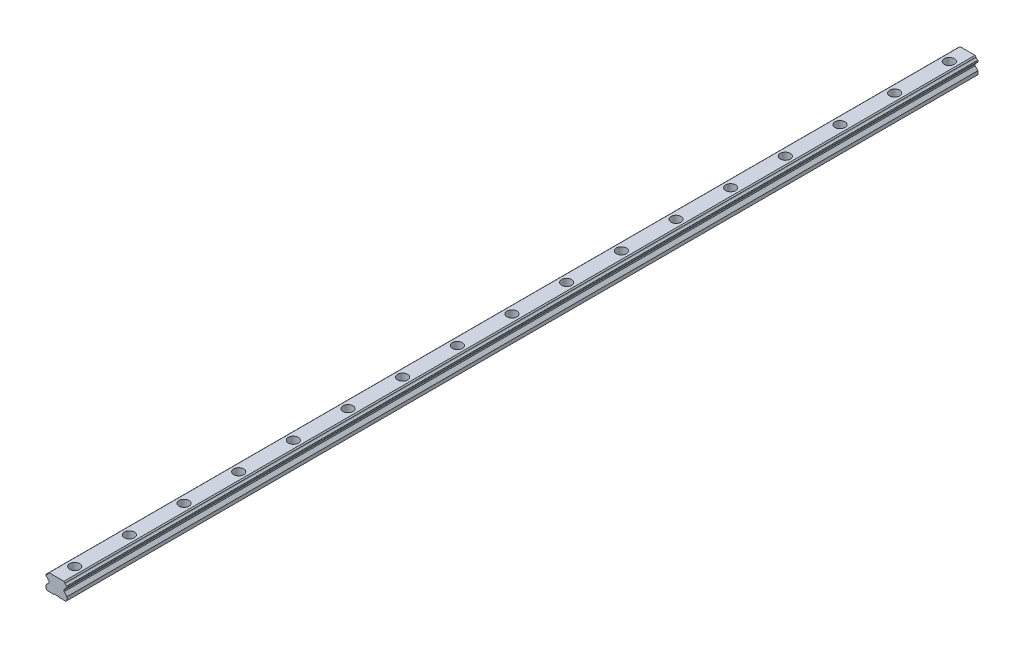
ISO-10303-21;
HEADER;
FILE_DESCRIPTION(('STEP AP214'),'2;1');
FILE_NAME('part.step','',(''),(''),'','','');
FILE_SCHEMA(('AUTOMOTIVE_DESIGN { 1 0 10303 214 1 1 1 1 }'));
ENDSEC;
DATA;
#1=APPLICATION_CONTEXT('core data for automotive mechanical design processes');
#2=APPLICATION_PROTOCOL_DEFINITION('international standard','automotive_design',2000,#1);
#3=PRODUCT_CONTEXT('',#1,'mechanical');
#4=PRODUCT('Part','Part','',(#3));
#5=PRODUCT_RELATED_PRODUCT_CATEGORY('part','',(#4));
#6=PRODUCT_DEFINITION_FORMATION('','',#4);
#7=PRODUCT_DEFINITION_CONTEXT('part definition',#1,'design');
#8=PRODUCT_DEFINITION('design','',#6,#7);
#9=PRODUCT_DEFINITION_SHAPE('','',#8);
#10=(LENGTH_UNIT() NAMED_UNIT(*) SI_UNIT(.MILLI.,.METRE.));
#11=(NAMED_UNIT(*) PLANE_ANGLE_UNIT() SI_UNIT($,.RADIAN.));
#12=(NAMED_UNIT(*) SI_UNIT($,.STERADIAN.) SOLID_ANGLE_UNIT());
#13=UNCERTAINTY_MEASURE_WITH_UNIT(LENGTH_MEASURE(1.E-05),#10,'distance_accuracy_value','');
#14=(GEOMETRIC_REPRESENTATION_CONTEXT(3) GLOBAL_UNCERTAINTY_ASSIGNED_CONTEXT((#13)) GLOBAL_UNIT_ASSIGNED_CONTEXT((#10,
#11,#12)) REPRESENTATION_CONTEXT('',''));
#15=CARTESIAN_POINT('',(0.,0.,0.));
#16=DIRECTION('',(0.,0.,1.));
#17=DIRECTION('',(1.,0.,0.));
#18=AXIS2_PLACEMENT_3D('',#15,#16,#17);
#19=CARTESIAN_POINT('',(-2.63226550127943,-8.30754766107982,1000.));
#20=DIRECTION('',(0.,1.,0.));
#21=DIRECTION('',(0.,0.,1.));
#22=AXIS2_PLACEMENT_3D('',#19,#20,#21);
#23=PLANE('',#22);
#24=DIRECTION('',(0.,0.,-1.));
#25=VECTOR('',#24,1.);
#26=CARTESIAN_POINT('',(2.36773449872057,-8.30754766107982,1000.));
#27=LINE('',#26,#25);
#28=CARTESIAN_POINT('',(2.36773449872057,-8.30754766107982,77.5505102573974));
#29=VERTEX_POINT('',#28);
#30=CARTESIAN_POINT('',(2.36773449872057,-8.30754766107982,22.4494897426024));
#31=VERTEX_POINT('',#30);
#32=EDGE_CURVE('E684',#29,#31,#27,.T.);
#33=ORIENTED_EDGE('',*,*,#32,.F.);
#34=CARTESIAN_POINT('',(-0.132265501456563,-8.30754766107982,79.9999999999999));
#35=DIRECTION('',(0.,1.,0.));
#36=DIRECTION('',(0.,0.,1.));
#37=AXIS2_PLACEMENT_3D('',#34,#35,#36);
#38=CIRCLE('',#37,3.5);
#39=CARTESIAN_POINT('',(-2.63226550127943,-8.30754766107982,77.5505102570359));
#40=VERTEX_POINT('',#39);
#41=EDGE_CURVE('E1411',#29,#40,#38,.T.);
#42=ORIENTED_EDGE('',*,*,#41,.T.);
#43=DIRECTION('',(0.,0.,-1.));
#44=VECTOR('',#43,1.);
#45=CARTESIAN_POINT('',(-2.63226550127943,-8.30754766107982,1000.));
#46=LINE('',#45,#44);
#47=CARTESIAN_POINT('',(-2.63226550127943,-8.30754766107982,22.449489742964));
#48=VERTEX_POINT('',#47);
#49=EDGE_CURVE('E691',#40,#48,#46,.T.);
#50=ORIENTED_EDGE('',*,*,#49,.T.);
#51=CARTESIAN_POINT('',(-0.132265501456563,-8.30754766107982,20.));
#52=DIRECTION('',(0.,1.,0.));
#53=DIRECTION('',(0.,0.,1.));
#54=AXIS2_PLACEMENT_3D('',#51,#52,#53);
#55=CIRCLE('',#54,3.5);
#56=EDGE_CURVE('E1079',#48,#31,#55,.T.);
#57=ORIENTED_EDGE('',*,*,#56,.T.);
#58=EDGE_LOOP('',(#33,#42,#50,#57));
#59=FACE_BOUND('',#58,.T.);
#60=ADVANCED_FACE('F45',(#59),#23,.F.);
#61=CARTESIAN_POINT('',(-3.13226550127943,-8.80754766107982,1000.));
#62=DIRECTION('',(-0.707106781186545,0.70710678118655,0.));
#63=DIRECTION('',(-0.70710678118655,-0.707106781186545,0.));
#64=AXIS2_PLACEMENT_3D('',#61,#62,#63);
#65=PLANE('',#64);
#66=ORIENTED_EDGE('',*,*,#49,.F.);
#67=CARTESIAN_POINT('',(-0.132265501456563,-5.80754766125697,79.9999999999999));
#68=DIRECTION('',(-0.707106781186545,0.70710678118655,0.));
#69=DIRECTION('',(0.70710678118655,0.707106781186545,0.));
#70=AXIS2_PLACEMENT_3D('',#67,#68,#69);
#71=ELLIPSE('',#70,4.94974746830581,3.5);
#72=CARTESIAN_POINT('',(-3.13226550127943,-8.80754766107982,78.1972243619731));
#73=VERTEX_POINT('',#72);
#74=EDGE_CURVE('E656',#40,#73,#71,.T.);
#75=ORIENTED_EDGE('',*,*,#74,.T.);
#76=DIRECTION('',(0.,0.,-1.));
#77=VECTOR('',#76,1.);
#78=CARTESIAN_POINT('',(-3.13226550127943,-8.80754766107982,1000.));
#79=LINE('',#78,#77);
#80=CARTESIAN_POINT('',(-3.13226550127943,-8.80754766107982,21.8027756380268));
#81=VERTEX_POINT('',#80);
#82=EDGE_CURVE('E698',#73,#81,#79,.T.);
#83=ORIENTED_EDGE('',*,*,#82,.T.);
#84=CARTESIAN_POINT('',(-0.132265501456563,-5.80754766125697,20.));
#85=DIRECTION('',(-0.707106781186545,0.70710678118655,0.));
#86=DIRECTION('',(0.70710678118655,0.707106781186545,0.));
#87=AXIS2_PLACEMENT_3D('',#84,#85,#86);
#88=ELLIPSE('',#87,4.94974746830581,3.5);
#89=EDGE_CURVE('E1083',#81,#48,#88,.T.);
#90=ORIENTED_EDGE('',*,*,#89,.T.);
#91=EDGE_LOOP('',(#66,#75,#83,#90));
#92=FACE_BOUND('',#91,.T.);
#93=ADVANCED_FACE('F1995',(#92),#65,.F.);
#94=CARTESIAN_POINT('',(2.36773449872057,-8.30754766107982,1000.));
#95=DIRECTION('',(0.707106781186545,0.70710678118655,0.));
#96=DIRECTION('',(-0.70710678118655,0.707106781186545,0.));
#97=AXIS2_PLACEMENT_3D('',#94,#95,#96);
#98=PLANE('',#97);
#99=CARTESIAN_POINT('',(2.36773449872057,-8.30754766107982,137.550510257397));
#100=VERTEX_POINT('',#99);
#101=CARTESIAN_POINT('',(2.36773449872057,-8.30754766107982,82.4494897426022));
#102=VERTEX_POINT('',#101);
#103=EDGE_CURVE('E653',#100,#102,#27,.T.);
#104=ORIENTED_EDGE('',*,*,#103,.T.);
#105=CARTESIAN_POINT('',(-0.132265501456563,-5.8075476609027,79.9999999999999));
#106=DIRECTION('',(0.707106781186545,0.70710678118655,0.));
#107=DIRECTION('',(-0.70710678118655,0.707106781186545,0.));
#108=AXIS2_PLACEMENT_3D('',#105,#106,#107);
#109=ELLIPSE('',#108,4.94974746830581,3.5);
#110=CARTESIAN_POINT('',(2.86773449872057,-8.80754766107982,81.8027756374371));
#111=VERTEX_POINT('',#110);
#112=EDGE_CURVE('E639',#102,#111,#109,.T.);
#113=ORIENTED_EDGE('',*,*,#112,.T.);
#114=DIRECTION('',(0.,0.,-1.));
#115=VECTOR('',#114,1.);
#116=CARTESIAN_POINT('',(2.86773449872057,-8.80754766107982,1000.));
#117=LINE('',#116,#115);
#118=CARTESIAN_POINT('',(2.86773449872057,-8.80754766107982,138.197224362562));
#119=VERTEX_POINT('',#118);
#120=EDGE_CURVE('E651',#119,#111,#117,.T.);
#121=ORIENTED_EDGE('',*,*,#120,.F.);
#122=CARTESIAN_POINT('',(-0.132265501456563,-5.8075476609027,140.));
#123=DIRECTION('',(0.707106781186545,0.70710678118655,0.));
#124=DIRECTION('',(-0.70710678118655,0.707106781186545,0.));
#125=AXIS2_PLACEMENT_3D('',#122,#123,#124);
#126=ELLIPSE('',#125,4.94974746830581,3.5);
#127=EDGE_CURVE('E69',#119,#100,#126,.T.);
#128=ORIENTED_EDGE('',*,*,#127,.T.);
#129=EDGE_LOOP('',(#104,#113,#121,#128));
#130=FACE_BOUND('',#129,.T.);
#131=ADVANCED_FACE('F650',(#130),#98,.F.);
#132=CARTESIAN_POINT('',(-2.63226550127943,-8.30754766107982,137.550510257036));
#133=VERTEX_POINT('',#132);
#134=CARTESIAN_POINT('',(-2.63226550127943,-8.30754766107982,82.4494897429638));
#135=VERTEX_POINT('',#134);
#136=EDGE_CURVE('E831',#133,#135,#46,.T.);
#137=ORIENTED_EDGE('',*,*,#136,.T.);
#138=EDGE_CURVE('E655',#135,#102,#38,.T.);
#139=ORIENTED_EDGE('',*,*,#138,.T.);
#140=ORIENTED_EDGE('',*,*,#103,.F.);
#141=CARTESIAN_POINT('',(-0.132265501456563,-8.30754766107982,140.));
#142=DIRECTION('',(0.,1.,0.));
#143=DIRECTION('',(0.,0.,1.));
#144=AXIS2_PLACEMENT_3D('',#141,#142,#143);
#145=CIRCLE('',#144,3.5);
#146=EDGE_CURVE('E1386',#100,#133,#145,.T.);
#147=ORIENTED_EDGE('',*,*,#146,.T.);
#148=EDGE_LOOP('',(#137,#139,#140,#147));
#149=FACE_BOUND('',#148,.T.);
#150=ADVANCED_FACE('F1996',(#149),#23,.F.);
#151=CARTESIAN_POINT('',(-3.13226550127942,-8.80754766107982,138.197224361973));
#152=VERTEX_POINT('',#151);
#153=CARTESIAN_POINT('',(-3.13226550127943,-8.80754766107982,81.8027756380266));
#154=VERTEX_POINT('',#153);
#155=EDGE_CURVE('E1793',#152,#154,#79,.T.);
#156=ORIENTED_EDGE('',*,*,#155,.T.);
#157=EDGE_CURVE('E1407',#154,#135,#71,.T.);
#158=ORIENTED_EDGE('',*,*,#157,.T.);
#159=ORIENTED_EDGE('',*,*,#136,.F.);
#160=CARTESIAN_POINT('',(-0.132265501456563,-5.80754766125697,140.));
#161=DIRECTION('',(-0.707106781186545,0.70710678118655,0.));
#162=DIRECTION('',(0.70710678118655,0.707106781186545,0.));
#163=AXIS2_PLACEMENT_3D('',#160,#161,#162);
#164=ELLIPSE('',#163,4.94974746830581,3.5);
#165=EDGE_CURVE('E1381',#133,#152,#164,.T.);
#166=ORIENTED_EDGE('',*,*,#165,.T.);
#167=EDGE_LOOP('',(#156,#158,#159,#166));
#168=FACE_BOUND('',#167,.T.);
#169=ADVANCED_FACE('F2001',(#168),#65,.F.);
#170=CARTESIAN_POINT('',(2.36773449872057,-8.30754766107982,197.550510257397));
#171=VERTEX_POINT('',#170);
#172=CARTESIAN_POINT('',(2.36773449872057,-8.30754766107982,142.449489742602));
#173=VERTEX_POINT('',#172);
#174=EDGE_CURVE('E1935',#171,#173,#27,.T.);
#175=ORIENTED_EDGE('',*,*,#174,.T.);
#176=CARTESIAN_POINT('',(2.86773449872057,-8.80754766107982,141.802775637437));
#177=VERTEX_POINT('',#176);
#178=EDGE_CURVE('E1385',#173,#177,#126,.T.);
#179=ORIENTED_EDGE('',*,*,#178,.T.);
#180=CARTESIAN_POINT('',(2.86773449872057,-8.80754766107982,198.197224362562));
#181=VERTEX_POINT('',#180);
#182=EDGE_CURVE('E662',#181,#177,#117,.T.);
#183=ORIENTED_EDGE('',*,*,#182,.F.);
#184=CARTESIAN_POINT('',(-0.132265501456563,-5.8075476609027,199.999999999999));
#185=DIRECTION('',(0.707106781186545,0.70710678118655,0.));
#186=DIRECTION('',(-0.70710678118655,0.707106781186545,0.));
#187=AXIS2_PLACEMENT_3D('',#184,#185,#186);
#188=ELLIPSE('',#187,4.94974746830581,3.5);
#189=EDGE_CURVE('E1348',#181,#171,#188,.T.);
#190=ORIENTED_EDGE('',*,*,#189,.T.);
#191=EDGE_LOOP('',(#175,#179,#183,#190));
#192=FACE_BOUND('',#191,.T.);
#193=ADVANCED_FACE('F2829',(#192),#98,.F.);
#194=CARTESIAN_POINT('',(-2.63226550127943,-8.30754766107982,197.550510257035));
#195=VERTEX_POINT('',#194);
#196=CARTESIAN_POINT('',(-2.63226550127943,-8.30754766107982,142.449489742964));
#197=VERTEX_POINT('',#196);
#198=EDGE_CURVE('E839',#195,#197,#46,.T.);
#199=ORIENTED_EDGE('',*,*,#198,.T.);
#200=EDGE_CURVE('E1389',#197,#173,#145,.T.);
#201=ORIENTED_EDGE('',*,*,#200,.T.);
#202=ORIENTED_EDGE('',*,*,#174,.F.);
#203=CARTESIAN_POINT('',(-0.132265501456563,-8.30754766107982,199.999999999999));
#204=DIRECTION('',(0.,1.,0.));
#205=DIRECTION('',(0.,0.,1.));
#206=AXIS2_PLACEMENT_3D('',#203,#204,#205);
#207=CIRCLE('',#206,3.5);
#208=EDGE_CURVE('E1353',#171,#195,#207,.T.);
#209=ORIENTED_EDGE('',*,*,#208,.T.);
#210=EDGE_LOOP('',(#199,#201,#202,#209));
#211=FACE_BOUND('',#210,.T.);
#212=ADVANCED_FACE('F2003',(#211),#23,.F.);
#213=CARTESIAN_POINT('',(-3.13226550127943,-8.80754766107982,198.197224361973));
#214=VERTEX_POINT('',#213);
#215=CARTESIAN_POINT('',(-3.13226550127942,-8.80754766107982,141.802775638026));
#216=VERTEX_POINT('',#215);
#217=EDGE_CURVE('E1788',#214,#216,#79,.T.);
#218=ORIENTED_EDGE('',*,*,#217,.T.);
#219=EDGE_CURVE('E1380',#216,#197,#164,.T.);
#220=ORIENTED_EDGE('',*,*,#219,.T.);
#221=ORIENTED_EDGE('',*,*,#198,.F.);
#222=CARTESIAN_POINT('',(-0.132265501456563,-5.80754766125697,199.999999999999));
#223=DIRECTION('',(-0.707106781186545,0.70710678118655,0.));
#224=DIRECTION('',(0.70710678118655,0.707106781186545,0.));
#225=AXIS2_PLACEMENT_3D('',#222,#223,#224);
#226=ELLIPSE('',#225,4.94974746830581,3.5);
#227=EDGE_CURVE('E1346',#195,#214,#226,.T.);
#228=ORIENTED_EDGE('',*,*,#227,.T.);
#229=EDGE_LOOP('',(#218,#220,#221,#228));
#230=FACE_BOUND('',#229,.T.);
#231=ADVANCED_FACE('F2845',(#230),#65,.F.);
#232=CARTESIAN_POINT('',(2.36773449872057,-8.30754766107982,257.550510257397));
#233=VERTEX_POINT('',#232);
#234=CARTESIAN_POINT('',(2.36773449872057,-8.30754766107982,202.449489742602));
#235=VERTEX_POINT('',#234);
#236=EDGE_CURVE('E1342',#233,#235,#27,.T.);
#237=ORIENTED_EDGE('',*,*,#236,.T.);
#238=CARTESIAN_POINT('',(2.86773449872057,-8.80754766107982,201.802775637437));
#239=VERTEX_POINT('',#238);
#240=EDGE_CURVE('E1341',#235,#239,#188,.T.);
#241=ORIENTED_EDGE('',*,*,#240,.T.);
#242=CARTESIAN_POINT('',(2.86773449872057,-8.80754766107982,258.197224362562));
#243=VERTEX_POINT('',#242);
#244=EDGE_CURVE('E667',#243,#239,#117,.T.);
#245=ORIENTED_EDGE('',*,*,#244,.F.);
#246=CARTESIAN_POINT('',(-0.132265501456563,-5.8075476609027,259.999999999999));
#247=DIRECTION('',(0.707106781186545,0.70710678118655,0.));
#248=DIRECTION('',(-0.70710678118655,0.707106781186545,0.));
#249=AXIS2_PLACEMENT_3D('',#246,#247,#248);
#250=ELLIPSE('',#249,4.94974746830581,3.5);
#251=EDGE_CURVE('E1339',#243,#233,#250,.T.);
#252=ORIENTED_EDGE('',*,*,#251,.T.);
#253=EDGE_LOOP('',(#237,#241,#245,#252));
#254=FACE_BOUND('',#253,.T.);
#255=ADVANCED_FACE('F1338',(#254),#98,.F.);
#256=CARTESIAN_POINT('',(-2.63226550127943,-8.30754766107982,257.550510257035));
#257=VERTEX_POINT('',#256);
#258=CARTESIAN_POINT('',(-2.63226550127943,-8.30754766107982,202.449489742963));
#259=VERTEX_POINT('',#258);
#260=EDGE_CURVE('E845',#257,#259,#46,.T.);
#261=ORIENTED_EDGE('',*,*,#260,.T.);
#262=EDGE_CURVE('E1345',#259,#235,#207,.T.);
#263=ORIENTED_EDGE('',*,*,#262,.T.);
#264=ORIENTED_EDGE('',*,*,#236,.F.);
#265=CARTESIAN_POINT('',(-0.132265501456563,-8.30754766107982,259.999999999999));
#266=DIRECTION('',(0.,1.,0.));
#267=DIRECTION('',(0.,0.,1.));
#268=AXIS2_PLACEMENT_3D('',#265,#266,#267);
#269=CIRCLE('',#268,3.5);
#270=EDGE_CURVE('E1757',#233,#257,#269,.T.);
#271=ORIENTED_EDGE('',*,*,#270,.T.);
#272=EDGE_LOOP('',(#261,#263,#264,#271));
#273=FACE_BOUND('',#272,.T.);
#274=ADVANCED_FACE('F2860',(#273),#23,.F.);
#275=CARTESIAN_POINT('',(-3.13226550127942,-8.80754766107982,258.197224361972));
#276=VERTEX_POINT('',#275);
#277=CARTESIAN_POINT('',(-3.13226550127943,-8.80754766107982,201.802775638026));
#278=VERTEX_POINT('',#277);
#279=EDGE_CURVE('E1782',#276,#278,#79,.T.);
#280=ORIENTED_EDGE('',*,*,#279,.T.);
#281=EDGE_CURVE('E1351',#278,#259,#226,.T.);
#282=ORIENTED_EDGE('',*,*,#281,.T.);
#283=ORIENTED_EDGE('',*,*,#260,.F.);
#284=CARTESIAN_POINT('',(-0.132265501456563,-5.80754766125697,259.999999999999));
#285=DIRECTION('',(-0.707106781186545,0.70710678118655,0.));
#286=DIRECTION('',(0.70710678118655,0.707106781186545,0.));
#287=AXIS2_PLACEMENT_3D('',#284,#285,#286);
#288=ELLIPSE('',#287,4.94974746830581,3.5);
#289=EDGE_CURVE('E1752',#257,#276,#288,.T.);
#290=ORIENTED_EDGE('',*,*,#289,.T.);
#291=EDGE_LOOP('',(#280,#282,#283,#290));
#292=FACE_BOUND('',#291,.T.);
#293=ADVANCED_FACE('F1780',(#292),#65,.F.);
#294=CARTESIAN_POINT('',(2.36773449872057,-8.30754766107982,317.550510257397));
#295=VERTEX_POINT('',#294);
#296=CARTESIAN_POINT('',(2.36773449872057,-8.30754766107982,262.449489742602));
#297=VERTEX_POINT('',#296);
#298=EDGE_CURVE('E1927',#295,#297,#27,.T.);
#299=ORIENTED_EDGE('',*,*,#298,.T.);
#300=CARTESIAN_POINT('',(2.86773449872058,-8.80754766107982,261.802775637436));
#301=VERTEX_POINT('',#300);
#302=EDGE_CURVE('E1756',#297,#301,#250,.T.);
#303=ORIENTED_EDGE('',*,*,#302,.T.);
#304=CARTESIAN_POINT('',(2.86773449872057,-8.80754766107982,318.197224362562));
#305=VERTEX_POINT('',#304);
#306=EDGE_CURVE('E1320',#305,#301,#117,.T.);
#307=ORIENTED_EDGE('',*,*,#306,.F.);
#308=CARTESIAN_POINT('',(-0.132265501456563,-5.8075476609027,319.999999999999));
#309=DIRECTION('',(0.707106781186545,0.70710678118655,0.));
#310=DIRECTION('',(-0.70710678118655,0.707106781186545,0.));
#311=AXIS2_PLACEMENT_3D('',#308,#309,#310);
#312=ELLIPSE('',#311,4.94974746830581,3.5);
#313=EDGE_CURVE('E1732',#305,#295,#312,.T.);
#314=ORIENTED_EDGE('',*,*,#313,.T.);
#315=EDGE_LOOP('',(#299,#303,#307,#314));
#316=FACE_BOUND('',#315,.T.);
#317=ADVANCED_FACE('F2875',(#316),#98,.F.);
#318=CARTESIAN_POINT('',(-2.63226550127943,-8.30754766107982,317.550510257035));
#319=VERTEX_POINT('',#318);
#320=CARTESIAN_POINT('',(-2.63226550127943,-8.30754766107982,262.449489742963));
#321=VERTEX_POINT('',#320);
#322=EDGE_CURVE('E852',#319,#321,#46,.T.);
#323=ORIENTED_EDGE('',*,*,#322,.T.);
#324=EDGE_CURVE('E1760',#321,#297,#269,.T.);
#325=ORIENTED_EDGE('',*,*,#324,.T.);
#326=ORIENTED_EDGE('',*,*,#298,.F.);
#327=CARTESIAN_POINT('',(-0.132265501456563,-8.30754766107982,319.999999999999));
#328=DIRECTION('',(0.,1.,0.));
#329=DIRECTION('',(0.,0.,1.));
#330=AXIS2_PLACEMENT_3D('',#327,#328,#329);
#331=CIRCLE('',#330,3.5);
#332=EDGE_CURVE('E1729',#295,#319,#331,.T.);
#333=ORIENTED_EDGE('',*,*,#332,.T.);
#334=EDGE_LOOP('',(#323,#325,#326,#333));
#335=FACE_BOUND('',#334,.T.);
#336=ADVANCED_FACE('F2884',(#335),#23,.F.);
#337=CARTESIAN_POINT('',(-3.13226550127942,-8.80754766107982,318.197224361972));
#338=VERTEX_POINT('',#337);
#339=CARTESIAN_POINT('',(-3.13226550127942,-8.80754766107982,261.802775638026));
#340=VERTEX_POINT('',#339);
#341=EDGE_CURVE('E1796',#338,#340,#79,.T.);
#342=ORIENTED_EDGE('',*,*,#341,.T.);
#343=EDGE_CURVE('E1751',#340,#321,#288,.T.);
#344=ORIENTED_EDGE('',*,*,#343,.T.);
#345=ORIENTED_EDGE('',*,*,#322,.F.);
#346=CARTESIAN_POINT('',(-0.132265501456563,-5.80754766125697,319.999999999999));
#347=DIRECTION('',(-0.707106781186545,0.70710678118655,0.));
#348=DIRECTION('',(0.70710678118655,0.707106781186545,0.));
#349=AXIS2_PLACEMENT_3D('',#346,#347,#348);
#350=ELLIPSE('',#349,4.94974746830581,3.5);
#351=EDGE_CURVE('E1724',#319,#338,#350,.T.);
#352=ORIENTED_EDGE('',*,*,#351,.T.);
#353=EDGE_LOOP('',(#342,#344,#345,#352));
#354=FACE_BOUND('',#353,.T.);
#355=ADVANCED_FACE('F1857',(#354),#65,.F.);
#356=CARTESIAN_POINT('',(2.36773449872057,-8.30754766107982,377.550510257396));
#357=VERTEX_POINT('',#356);
#358=CARTESIAN_POINT('',(2.36773449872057,-8.30754766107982,322.449489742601));
#359=VERTEX_POINT('',#358);
#360=EDGE_CURVE('E1921',#357,#359,#27,.T.);
#361=ORIENTED_EDGE('',*,*,#360,.T.);
#362=CARTESIAN_POINT('',(2.86773449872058,-8.80754766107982,321.802775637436));
#363=VERTEX_POINT('',#362);
#364=EDGE_CURVE('E1728',#359,#363,#312,.T.);
#365=ORIENTED_EDGE('',*,*,#364,.T.);
#366=CARTESIAN_POINT('',(2.86773449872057,-8.80754766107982,378.197224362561));
#367=VERTEX_POINT('',#366);
#368=EDGE_CURVE('E1315',#367,#363,#117,.T.);
#369=ORIENTED_EDGE('',*,*,#368,.F.);
#370=CARTESIAN_POINT('',(-0.132265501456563,-5.8075476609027,379.999999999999));
#371=DIRECTION('',(0.707106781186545,0.70710678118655,0.));
#372=DIRECTION('',(-0.70710678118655,0.707106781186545,0.));
#373=AXIS2_PLACEMENT_3D('',#370,#371,#372);
#374=ELLIPSE('',#373,4.94974746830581,3.5);
#375=EDGE_CURVE('E1704',#367,#357,#374,.T.);
#376=ORIENTED_EDGE('',*,*,#375,.T.);
#377=EDGE_LOOP('',(#361,#365,#369,#376));
#378=FACE_BOUND('',#377,.T.);
#379=ADVANCED_FACE('F2901',(#378),#98,.F.);
#380=CARTESIAN_POINT('',(-2.63226550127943,-8.30754766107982,377.550510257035));
#381=VERTEX_POINT('',#380);
#382=CARTESIAN_POINT('',(-2.63226550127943,-8.30754766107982,322.449489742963));
#383=VERTEX_POINT('',#382);
#384=EDGE_CURVE('E859',#381,#383,#46,.T.);
#385=ORIENTED_EDGE('',*,*,#384,.T.);
#386=EDGE_CURVE('E1733',#383,#359,#331,.T.);
#387=ORIENTED_EDGE('',*,*,#386,.T.);
#388=ORIENTED_EDGE('',*,*,#360,.F.);
#389=CARTESIAN_POINT('',(-0.132265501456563,-8.30754766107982,379.999999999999));
#390=DIRECTION('',(0.,1.,0.));
#391=DIRECTION('',(0.,0.,1.));
#392=AXIS2_PLACEMENT_3D('',#389,#390,#391);
#393=CIRCLE('',#392,3.5);
#394=EDGE_CURVE('E1701',#357,#381,#393,.T.);
#395=ORIENTED_EDGE('',*,*,#394,.T.);
#396=EDGE_LOOP('',(#385,#387,#388,#395));
#397=FACE_BOUND('',#396,.T.);
#398=ADVANCED_FACE('F2908',(#397),#23,.F.);
#399=CARTESIAN_POINT('',(-3.13226550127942,-8.80754766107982,378.197224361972));
#400=VERTEX_POINT('',#399);
#401=CARTESIAN_POINT('',(-3.13226550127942,-8.80754766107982,321.802775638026));
#402=VERTEX_POINT('',#401);
#403=EDGE_CURVE('E1843',#400,#402,#79,.T.);
#404=ORIENTED_EDGE('',*,*,#403,.T.);
#405=EDGE_CURVE('E1723',#402,#383,#350,.T.);
#406=ORIENTED_EDGE('',*,*,#405,.T.);
#407=ORIENTED_EDGE('',*,*,#384,.F.);
#408=CARTESIAN_POINT('',(-0.132265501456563,-5.80754766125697,379.999999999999));
#409=DIRECTION('',(-0.707106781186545,0.70710678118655,0.));
#410=DIRECTION('',(0.70710678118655,0.707106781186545,0.));
#411=AXIS2_PLACEMENT_3D('',#408,#409,#410);
#412=ELLIPSE('',#411,4.94974746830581,3.5);
#413=EDGE_CURVE('E1696',#381,#400,#412,.T.);
#414=ORIENTED_EDGE('',*,*,#413,.T.);
#415=EDGE_LOOP('',(#404,#406,#407,#414));
#416=FACE_BOUND('',#415,.T.);
#417=ADVANCED_FACE('F2916',(#416),#65,.F.);
#418=CARTESIAN_POINT('',(2.36773449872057,-8.30754766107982,437.550510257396));
#419=VERTEX_POINT('',#418);
#420=CARTESIAN_POINT('',(2.36773449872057,-8.30754766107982,382.449489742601));
#421=VERTEX_POINT('',#420);
#422=EDGE_CURVE('E1916',#419,#421,#27,.T.);
#423=ORIENTED_EDGE('',*,*,#422,.T.);
#424=CARTESIAN_POINT('',(2.86773449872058,-8.80754766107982,381.802775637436));
#425=VERTEX_POINT('',#424);
#426=EDGE_CURVE('E1700',#421,#425,#374,.T.);
#427=ORIENTED_EDGE('',*,*,#426,.T.);
#428=CARTESIAN_POINT('',(2.86773449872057,-8.80754766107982,438.197224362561));
#429=VERTEX_POINT('',#428);
#430=EDGE_CURVE('E1310',#429,#425,#117,.T.);
#431=ORIENTED_EDGE('',*,*,#430,.F.);
#432=CARTESIAN_POINT('',(-0.132265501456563,-5.8075476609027,439.999999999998));
#433=DIRECTION('',(0.707106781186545,0.70710678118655,0.));
#434=DIRECTION('',(-0.70710678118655,0.707106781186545,0.));
#435=AXIS2_PLACEMENT_3D('',#432,#433,#434);
#436=ELLIPSE('',#435,4.94974746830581,3.5);
#437=EDGE_CURVE('E1676',#429,#419,#436,.T.);
#438=ORIENTED_EDGE('',*,*,#437,.T.);
#439=EDGE_LOOP('',(#423,#427,#431,#438));
#440=FACE_BOUND('',#439,.T.);
#441=ADVANCED_FACE('F1918',(#440),#98,.F.);
#442=CARTESIAN_POINT('',(-2.63226550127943,-8.30754766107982,437.550510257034));
#443=VERTEX_POINT('',#442);
#444=CARTESIAN_POINT('',(-2.63226550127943,-8.30754766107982,382.449489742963));
#445=VERTEX_POINT('',#444);
#446=EDGE_CURVE('E866',#443,#445,#46,.T.);
#447=ORIENTED_EDGE('',*,*,#446,.T.);
#448=EDGE_CURVE('E1705',#445,#421,#393,.T.);
#449=ORIENTED_EDGE('',*,*,#448,.T.);
#450=ORIENTED_EDGE('',*,*,#422,.F.);
#451=CARTESIAN_POINT('',(-0.132265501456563,-8.30754766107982,439.999999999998));
#452=DIRECTION('',(0.,1.,0.));
#453=DIRECTION('',(0.,0.,1.));
#454=AXIS2_PLACEMENT_3D('',#451,#452,#453);
#455=CIRCLE('',#454,3.5);
#456=EDGE_CURVE('E1673',#419,#443,#455,.T.);
#457=ORIENTED_EDGE('',*,*,#456,.T.);
#458=EDGE_LOOP('',(#447,#449,#450,#457));
#459=FACE_BOUND('',#458,.T.);
#460=ADVANCED_FACE('F1915',(#459),#23,.F.);
#461=CARTESIAN_POINT('',(-3.13226550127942,-8.80754766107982,438.197224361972));
#462=VERTEX_POINT('',#461);
#463=CARTESIAN_POINT('',(-3.13226550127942,-8.80754766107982,381.802775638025));
#464=VERTEX_POINT('',#463);
#465=EDGE_CURVE('E1837',#462,#464,#79,.T.);
#466=ORIENTED_EDGE('',*,*,#465,.T.);
#467=EDGE_CURVE('E1695',#464,#445,#412,.T.);
#468=ORIENTED_EDGE('',*,*,#467,.T.);
#469=ORIENTED_EDGE('',*,*,#446,.F.);
#470=CARTESIAN_POINT('',(-0.132265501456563,-5.80754766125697,439.999999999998));
#471=DIRECTION('',(-0.707106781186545,0.70710678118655,0.));
#472=DIRECTION('',(0.70710678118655,0.707106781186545,0.));
#473=AXIS2_PLACEMENT_3D('',#470,#471,#472);
#474=ELLIPSE('',#473,4.94974746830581,3.5);
#475=EDGE_CURVE('E1668',#443,#462,#474,.T.);
#476=ORIENTED_EDGE('',*,*,#475,.T.);
#477=EDGE_LOOP('',(#466,#468,#469,#476));
#478=FACE_BOUND('',#477,.T.);
#479=ADVANCED_FACE('F1910',(#478),#65,.F.);
#480=CARTESIAN_POINT('',(2.36773449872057,-8.30754766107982,497.550510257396));
#481=VERTEX_POINT('',#480);
#482=CARTESIAN_POINT('',(2.36773449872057,-8.30754766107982,442.449489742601));
#483=VERTEX_POINT('',#482);
#484=EDGE_CURVE('E1920',#481,#483,#27,.T.);
#485=ORIENTED_EDGE('',*,*,#484,.T.);
#486=CARTESIAN_POINT('',(2.86773449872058,-8.80754766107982,441.802775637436));
#487=VERTEX_POINT('',#486);
#488=EDGE_CURVE('E1672',#483,#487,#436,.T.);
#489=ORIENTED_EDGE('',*,*,#488,.T.);
#490=CARTESIAN_POINT('',(2.86773449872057,-8.80754766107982,498.197224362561));
#491=VERTEX_POINT('',#490);
#492=EDGE_CURVE('E1305',#491,#487,#117,.T.);
#493=ORIENTED_EDGE('',*,*,#492,.F.);
#494=CARTESIAN_POINT('',(-0.132265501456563,-5.8075476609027,499.999999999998));
#495=DIRECTION('',(0.707106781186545,0.70710678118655,0.));
#496=DIRECTION('',(-0.70710678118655,0.707106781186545,0.));
#497=AXIS2_PLACEMENT_3D('',#494,#495,#496);
#498=ELLIPSE('',#497,4.94974746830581,3.5);
#499=EDGE_CURVE('E1648',#491,#481,#498,.T.);
#500=ORIENTED_EDGE('',*,*,#499,.T.);
#501=EDGE_LOOP('',(#485,#489,#493,#500));
#502=FACE_BOUND('',#501,.T.);
#503=ADVANCED_FACE('F2948',(#502),#98,.F.);
#504=CARTESIAN_POINT('',(-2.63226550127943,-8.30754766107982,497.550510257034));
#505=VERTEX_POINT('',#504);
#506=CARTESIAN_POINT('',(-2.63226550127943,-8.30754766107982,442.449489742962));
#507=VERTEX_POINT('',#506);
#508=EDGE_CURVE('E873',#505,#507,#46,.T.);
#509=ORIENTED_EDGE('',*,*,#508,.T.);
#510=EDGE_CURVE('E1677',#507,#483,#455,.T.);
#511=ORIENTED_EDGE('',*,*,#510,.T.);
#512=ORIENTED_EDGE('',*,*,#484,.F.);
#513=CARTESIAN_POINT('',(-0.132265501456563,-8.30754766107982,499.999999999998));
#514=DIRECTION('',(0.,1.,0.));
#515=DIRECTION('',(0.,0.,1.));
#516=AXIS2_PLACEMENT_3D('',#513,#514,#515);
#517=CIRCLE('',#516,3.5);
#518=EDGE_CURVE('E1645',#481,#505,#517,.T.);
#519=ORIENTED_EDGE('',*,*,#518,.T.);
#520=EDGE_LOOP('',(#509,#511,#512,#519));
#521=FACE_BOUND('',#520,.T.);
#522=ADVANCED_FACE('F2955',(#521),#23,.F.);
#523=CARTESIAN_POINT('',(-3.13226550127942,-8.80754766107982,498.197224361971));
#524=VERTEX_POINT('',#523);
#525=CARTESIAN_POINT('',(-3.13226550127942,-8.80754766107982,441.802775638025));
#526=VERTEX_POINT('',#525);
#527=EDGE_CURVE('E1831',#524,#526,#79,.T.);
#528=ORIENTED_EDGE('',*,*,#527,.T.);
#529=EDGE_CURVE('E1667',#526,#507,#474,.T.);
#530=ORIENTED_EDGE('',*,*,#529,.T.);
#531=ORIENTED_EDGE('',*,*,#508,.F.);
#532=CARTESIAN_POINT('',(-0.132265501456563,-5.80754766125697,499.999999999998));
#533=DIRECTION('',(-0.707106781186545,0.70710678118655,0.));
#534=DIRECTION('',(0.70710678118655,0.707106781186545,0.));
#535=AXIS2_PLACEMENT_3D('',#532,#533,#534);
#536=ELLIPSE('',#535,4.94974746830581,3.5);
#537=EDGE_CURVE('E1640',#505,#524,#536,.T.);
#538=ORIENTED_EDGE('',*,*,#537,.T.);
#539=EDGE_LOOP('',(#528,#530,#531,#538));
#540=FACE_BOUND('',#539,.T.);
#541=ADVANCED_FACE('F1993',(#540),#65,.F.);
#542=CARTESIAN_POINT('',(2.36773449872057,-8.30754766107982,557.550510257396));
#543=VERTEX_POINT('',#542);
#544=CARTESIAN_POINT('',(2.36773449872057,-8.30754766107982,502.449489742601));
#545=VERTEX_POINT('',#544);
#546=EDGE_CURVE('E1925',#543,#545,#27,.T.);
#547=ORIENTED_EDGE('',*,*,#546,.T.);
#548=CARTESIAN_POINT('',(2.86773449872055,-8.80754766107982,501.802775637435));
#549=VERTEX_POINT('',#548);
#550=EDGE_CURVE('E1644',#545,#549,#498,.T.);
#551=ORIENTED_EDGE('',*,*,#550,.T.);
#552=CARTESIAN_POINT('',(2.86773449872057,-8.80754766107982,558.197224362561));
#553=VERTEX_POINT('',#552);
#554=EDGE_CURVE('E1300',#553,#549,#117,.T.);
#555=ORIENTED_EDGE('',*,*,#554,.F.);
#556=CARTESIAN_POINT('',(-0.132265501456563,-5.8075476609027,559.999999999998));
#557=DIRECTION('',(0.707106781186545,0.70710678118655,0.));
#558=DIRECTION('',(-0.70710678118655,0.707106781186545,0.));
#559=AXIS2_PLACEMENT_3D('',#556,#557,#558);
#560=ELLIPSE('',#559,4.94974746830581,3.5);
#561=EDGE_CURVE('E1620',#553,#543,#560,.T.);
#562=ORIENTED_EDGE('',*,*,#561,.T.);
#563=EDGE_LOOP('',(#547,#551,#555,#562));
#564=FACE_BOUND('',#563,.T.);
#565=ADVANCED_FACE('F1973',(#564),#98,.F.);
#566=CARTESIAN_POINT('',(-2.63226550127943,-8.30754766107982,557.550510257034));
#567=VERTEX_POINT('',#566);
#568=CARTESIAN_POINT('',(-2.63226550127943,-8.30754766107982,502.449489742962));
#569=VERTEX_POINT('',#568);
#570=EDGE_CURVE('E880',#567,#569,#46,.T.);
#571=ORIENTED_EDGE('',*,*,#570,.T.);
#572=EDGE_CURVE('E1649',#569,#545,#517,.T.);
#573=ORIENTED_EDGE('',*,*,#572,.T.);
#574=ORIENTED_EDGE('',*,*,#546,.F.);
#575=CARTESIAN_POINT('',(-0.132265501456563,-8.30754766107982,559.999999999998));
#576=DIRECTION('',(0.,1.,0.));
#577=DIRECTION('',(0.,0.,1.));
#578=AXIS2_PLACEMENT_3D('',#575,#576,#577);
#579=CIRCLE('',#578,3.5);
#580=EDGE_CURVE('E1617',#543,#567,#579,.T.);
#581=ORIENTED_EDGE('',*,*,#580,.T.);
#582=EDGE_LOOP('',(#571,#573,#574,#581));
#583=FACE_BOUND('',#582,.T.);
#584=ADVANCED_FACE('F1974',(#583),#23,.F.);
#585=CARTESIAN_POINT('',(-3.13226550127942,-8.80754766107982,558.197224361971));
#586=VERTEX_POINT('',#585);
#587=CARTESIAN_POINT('',(-3.13226550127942,-8.80754766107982,501.802775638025));
#588=VERTEX_POINT('',#587);
#589=EDGE_CURVE('E1825',#586,#588,#79,.T.);
#590=ORIENTED_EDGE('',*,*,#589,.T.);
#591=EDGE_CURVE('E1639',#588,#569,#536,.T.);
#592=ORIENTED_EDGE('',*,*,#591,.T.);
#593=ORIENTED_EDGE('',*,*,#570,.F.);
#594=CARTESIAN_POINT('',(-0.132265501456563,-5.80754766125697,559.999999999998));
#595=DIRECTION('',(-0.707106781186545,0.70710678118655,0.));
#596=DIRECTION('',(0.70710678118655,0.707106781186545,0.));
#597=AXIS2_PLACEMENT_3D('',#594,#595,#596);
#598=ELLIPSE('',#597,4.94974746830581,3.5);
#599=EDGE_CURVE('E1612',#567,#586,#598,.T.);
#600=ORIENTED_EDGE('',*,*,#599,.T.);
#601=EDGE_LOOP('',(#590,#592,#593,#600));
#602=FACE_BOUND('',#601,.T.);
#603=ADVANCED_FACE('F1905',(#602),#65,.F.);
#604=CARTESIAN_POINT('',(2.36773449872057,-8.30754766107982,617.550510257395));
#605=VERTEX_POINT('',#604);
#606=CARTESIAN_POINT('',(2.36773449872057,-8.30754766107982,562.4494897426));
#607=VERTEX_POINT('',#606);
#608=EDGE_CURVE('E1963',#605,#607,#27,.T.);
#609=ORIENTED_EDGE('',*,*,#608,.T.);
#610=CARTESIAN_POINT('',(2.86773449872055,-8.80754766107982,561.802775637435));
#611=VERTEX_POINT('',#610);
#612=EDGE_CURVE('E1616',#607,#611,#560,.T.);
#613=ORIENTED_EDGE('',*,*,#612,.T.);
#614=CARTESIAN_POINT('',(2.86773449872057,-8.80754766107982,618.197224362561));
#615=VERTEX_POINT('',#614);
#616=EDGE_CURVE('E1295',#615,#611,#117,.T.);
#617=ORIENTED_EDGE('',*,*,#616,.F.);
#618=CARTESIAN_POINT('',(-0.132265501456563,-5.8075476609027,619.999999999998));
#619=DIRECTION('',(0.707106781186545,0.70710678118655,0.));
#620=DIRECTION('',(-0.70710678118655,0.707106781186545,0.));
#621=AXIS2_PLACEMENT_3D('',#618,#619,#620);
#622=ELLIPSE('',#621,4.94974746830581,3.5);
#623=EDGE_CURVE('E1592',#615,#605,#622,.T.);
#624=ORIENTED_EDGE('',*,*,#623,.T.);
#625=EDGE_LOOP('',(#609,#613,#617,#624));
#626=FACE_BOUND('',#625,.T.);
#627=ADVANCED_FACE('F1975',(#626),#98,.F.);
#628=CARTESIAN_POINT('',(-2.63226550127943,-8.30754766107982,617.550510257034));
#629=VERTEX_POINT('',#628);
#630=CARTESIAN_POINT('',(-2.63226550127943,-8.30754766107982,562.449489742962));
#631=VERTEX_POINT('',#630);
#632=EDGE_CURVE('E887',#629,#631,#46,.T.);
#633=ORIENTED_EDGE('',*,*,#632,.T.);
#634=EDGE_CURVE('E1621',#631,#607,#579,.T.);
#635=ORIENTED_EDGE('',*,*,#634,.T.);
#636=ORIENTED_EDGE('',*,*,#608,.F.);
#637=CARTESIAN_POINT('',(-0.132265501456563,-8.30754766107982,619.999999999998));
#638=DIRECTION('',(0.,1.,0.));
#639=DIRECTION('',(0.,0.,1.));
#640=AXIS2_PLACEMENT_3D('',#637,#638,#639);
#641=CIRCLE('',#640,3.5);
#642=EDGE_CURVE('E1589',#605,#629,#641,.T.);
#643=ORIENTED_EDGE('',*,*,#642,.T.);
#644=EDGE_LOOP('',(#633,#635,#636,#643));
#645=FACE_BOUND('',#644,.T.);
#646=ADVANCED_FACE('F1976',(#645),#23,.F.);
#647=CARTESIAN_POINT('',(-3.13226550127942,-8.80754766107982,618.197224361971));
#648=VERTEX_POINT('',#647);
#649=CARTESIAN_POINT('',(-3.13226550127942,-8.80754766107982,561.802775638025));
#650=VERTEX_POINT('',#649);
#651=EDGE_CURVE('E1819',#648,#650,#79,.T.);
#652=ORIENTED_EDGE('',*,*,#651,.T.);
#653=EDGE_CURVE('E1611',#650,#631,#598,.T.);
#654=ORIENTED_EDGE('',*,*,#653,.T.);
#655=ORIENTED_EDGE('',*,*,#632,.F.);
#656=CARTESIAN_POINT('',(-0.132265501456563,-5.80754766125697,619.999999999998));
#657=DIRECTION('',(-0.707106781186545,0.70710678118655,0.));
#658=DIRECTION('',(0.70710678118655,0.707106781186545,0.));
#659=AXIS2_PLACEMENT_3D('',#656,#657,#658);
#660=ELLIPSE('',#659,4.94974746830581,3.5);
#661=EDGE_CURVE('E1584',#629,#648,#660,.T.);
#662=ORIENTED_EDGE('',*,*,#661,.T.);
#663=EDGE_LOOP('',(#652,#654,#655,#662));
#664=FACE_BOUND('',#663,.T.);
#665=ADVANCED_FACE('F1977',(#664),#65,.F.);
#666=CARTESIAN_POINT('',(2.36773449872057,-8.30754766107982,677.550510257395));
#667=VERTEX_POINT('',#666);
#668=CARTESIAN_POINT('',(2.36773449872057,-8.30754766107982,622.4494897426));
#669=VERTEX_POINT('',#668);
#670=EDGE_CURVE('E1960',#667,#669,#27,.T.);
#671=ORIENTED_EDGE('',*,*,#670,.T.);
#672=CARTESIAN_POINT('',(2.86773449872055,-8.80754766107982,621.802775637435));
#673=VERTEX_POINT('',#672);
#674=EDGE_CURVE('E1588',#669,#673,#622,.T.);
#675=ORIENTED_EDGE('',*,*,#674,.T.);
#676=CARTESIAN_POINT('',(2.86773449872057,-8.80754766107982,678.19722436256));
#677=VERTEX_POINT('',#676);
#678=EDGE_CURVE('E1290',#677,#673,#117,.T.);
#679=ORIENTED_EDGE('',*,*,#678,.F.);
#680=CARTESIAN_POINT('',(-0.132265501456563,-5.8075476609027,679.999999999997));
#681=DIRECTION('',(0.707106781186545,0.70710678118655,0.));
#682=DIRECTION('',(-0.70710678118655,0.707106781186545,0.));
#683=AXIS2_PLACEMENT_3D('',#680,#681,#682);
#684=ELLIPSE('',#683,4.94974746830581,3.5);
#685=EDGE_CURVE('E49',#677,#667,#684,.T.);
#686=ORIENTED_EDGE('',*,*,#685,.T.);
#687=EDGE_LOOP('',(#671,#675,#679,#686));
#688=FACE_BOUND('',#687,.T.);
#689=ADVANCED_FACE('F1979',(#688),#98,.F.);
#690=CARTESIAN_POINT('',(-2.63226550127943,-8.30754766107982,677.550510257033));
#691=VERTEX_POINT('',#690);
#692=CARTESIAN_POINT('',(-2.63226550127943,-8.30754766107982,622.449489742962));
#693=VERTEX_POINT('',#692);
#694=EDGE_CURVE('E894',#691,#693,#46,.T.);
#695=ORIENTED_EDGE('',*,*,#694,.T.);
#696=EDGE_CURVE('E1593',#693,#669,#641,.T.);
#697=ORIENTED_EDGE('',*,*,#696,.T.);
#698=ORIENTED_EDGE('',*,*,#670,.F.);
#699=CARTESIAN_POINT('',(-0.132265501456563,-8.30754766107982,679.999999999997));
#700=DIRECTION('',(0.,1.,0.));
#701=DIRECTION('',(0.,0.,1.));
#702=AXIS2_PLACEMENT_3D('',#699,#700,#701);
#703=CIRCLE('',#702,3.5);
#704=EDGE_CURVE('E1561',#667,#691,#703,.T.);
#705=ORIENTED_EDGE('',*,*,#704,.T.);
#706=EDGE_LOOP('',(#695,#697,#698,#705));
#707=FACE_BOUND('',#706,.T.);
#708=ADVANCED_FACE('F1985',(#707),#23,.F.);
#709=CARTESIAN_POINT('',(-3.13226550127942,-8.80754766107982,678.197224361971));
#710=VERTEX_POINT('',#709);
#711=CARTESIAN_POINT('',(-3.13226550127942,-8.80754766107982,621.802775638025));
#712=VERTEX_POINT('',#711);
#713=EDGE_CURVE('E1815',#710,#712,#79,.T.);
#714=ORIENTED_EDGE('',*,*,#713,.T.);
#715=EDGE_CURVE('E1583',#712,#693,#660,.T.);
#716=ORIENTED_EDGE('',*,*,#715,.T.);
#717=ORIENTED_EDGE('',*,*,#694,.F.);
#718=CARTESIAN_POINT('',(-0.132265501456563,-5.80754766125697,679.999999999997));
#719=DIRECTION('',(-0.707106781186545,0.70710678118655,0.));
#720=DIRECTION('',(0.70710678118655,0.707106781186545,0.));
#721=AXIS2_PLACEMENT_3D('',#718,#719,#720);
#722=ELLIPSE('',#721,4.94974746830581,3.5);
#723=EDGE_CURVE('E1559',#691,#710,#722,.T.);
#724=ORIENTED_EDGE('',*,*,#723,.T.);
#725=EDGE_LOOP('',(#714,#716,#717,#724));
#726=FACE_BOUND('',#725,.T.);
#727=ADVANCED_FACE('F1900',(#726),#65,.F.);
#728=CARTESIAN_POINT('',(2.36773449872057,-8.30754766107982,737.550510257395));
#729=VERTEX_POINT('',#728);
#730=CARTESIAN_POINT('',(2.36773449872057,-8.30754766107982,682.4494897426));
#731=VERTEX_POINT('',#730);
#732=EDGE_CURVE('E1550',#729,#731,#27,.T.);
#733=ORIENTED_EDGE('',*,*,#732,.T.);
#734=CARTESIAN_POINT('',(2.86773449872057,-8.80754766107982,681.802775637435));
#735=VERTEX_POINT('',#734);
#736=EDGE_CURVE('E12',#731,#735,#684,.T.);
#737=ORIENTED_EDGE('',*,*,#736,.T.);
#738=CARTESIAN_POINT('',(2.86773449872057,-8.80754766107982,738.19722436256));
#739=VERTEX_POINT('',#738);
#740=EDGE_CURVE('E1286',#739,#735,#117,.T.);
#741=ORIENTED_EDGE('',*,*,#740,.F.);
#742=CARTESIAN_POINT('',(-0.132265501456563,-5.8075476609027,739.999999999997));
#743=DIRECTION('',(0.707106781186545,0.70710678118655,0.));
#744=DIRECTION('',(-0.70710678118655,0.707106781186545,0.));
#745=AXIS2_PLACEMENT_3D('',#742,#743,#744);
#746=ELLIPSE('',#745,4.94974746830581,3.5);
#747=EDGE_CURVE('E1530',#739,#729,#746,.T.);
#748=ORIENTED_EDGE('',*,*,#747,.T.);
#749=EDGE_LOOP('',(#733,#737,#741,#748));
#750=FACE_BOUND('',#749,.T.);
#751=ADVANCED_FACE('F1549',(#750),#98,.F.);
#752=CARTESIAN_POINT('',(-2.63226550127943,-8.30754766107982,737.550510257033));
#753=VERTEX_POINT('',#752);
#754=CARTESIAN_POINT('',(-2.63226550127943,-8.30754766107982,682.449489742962));
#755=VERTEX_POINT('',#754);
#756=EDGE_CURVE('E901',#753,#755,#46,.T.);
#757=ORIENTED_EDGE('',*,*,#756,.T.);
#758=EDGE_CURVE('E1553',#755,#731,#703,.T.);
#759=ORIENTED_EDGE('',*,*,#758,.T.);
#760=ORIENTED_EDGE('',*,*,#732,.F.);
#761=CARTESIAN_POINT('',(-0.132265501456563,-8.30754766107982,739.999999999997));
#762=DIRECTION('',(0.,1.,0.));
#763=DIRECTION('',(0.,0.,1.));
#764=AXIS2_PLACEMENT_3D('',#761,#762,#763);
#765=CIRCLE('',#764,3.5);
#766=EDGE_CURVE('E1538',#729,#753,#765,.T.);
#767=ORIENTED_EDGE('',*,*,#766,.T.);
#768=EDGE_LOOP('',(#757,#759,#760,#767));
#769=FACE_BOUND('',#768,.T.);
#770=ADVANCED_FACE('F1556',(#769),#23,.F.);
#771=CARTESIAN_POINT('',(-3.13226550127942,-8.80754766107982,738.19722436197));
#772=VERTEX_POINT('',#771);
#773=CARTESIAN_POINT('',(-3.13226550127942,-8.80754766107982,681.802775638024));
#774=VERTEX_POINT('',#773);
#775=EDGE_CURVE('E1523',#772,#774,#79,.T.);
#776=ORIENTED_EDGE('',*,*,#775,.T.);
#777=EDGE_CURVE('E1558',#774,#755,#722,.T.);
#778=ORIENTED_EDGE('',*,*,#777,.T.);
#779=ORIENTED_EDGE('',*,*,#756,.F.);
#780=CARTESIAN_POINT('',(-0.132265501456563,-5.80754766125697,739.999999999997));
#781=DIRECTION('',(-0.707106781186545,0.70710678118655,0.));
#782=DIRECTION('',(0.70710678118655,0.707106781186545,0.));
#783=AXIS2_PLACEMENT_3D('',#780,#781,#782);
#784=ELLIPSE('',#783,4.94974746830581,3.5);
#785=EDGE_CURVE('E1501',#753,#772,#784,.T.);
#786=ORIENTED_EDGE('',*,*,#785,.T.);
#787=EDGE_LOOP('',(#776,#778,#779,#786));
#788=FACE_BOUND('',#787,.T.);
#789=ADVANCED_FACE('F1991',(#788),#65,.F.);
#790=CARTESIAN_POINT('',(2.36773449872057,-8.30754766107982,797.550510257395));
#791=VERTEX_POINT('',#790);
#792=CARTESIAN_POINT('',(2.36773449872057,-8.30754766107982,742.4494897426));
#793=VERTEX_POINT('',#792);
#794=EDGE_CURVE('E1515',#791,#793,#27,.T.);
#795=ORIENTED_EDGE('',*,*,#794,.T.);
#796=CARTESIAN_POINT('',(2.86773449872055,-8.80754766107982,741.802775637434));
#797=VERTEX_POINT('',#796);
#798=EDGE_CURVE('E1539',#793,#797,#746,.T.);
#799=ORIENTED_EDGE('',*,*,#798,.T.);
#800=CARTESIAN_POINT('',(2.86773449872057,-8.80754766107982,798.19722436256));
#801=VERTEX_POINT('',#800);
#802=EDGE_CURVE('E1283',#801,#797,#117,.T.);
#803=ORIENTED_EDGE('',*,*,#802,.F.);
#804=CARTESIAN_POINT('',(-0.132265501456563,-5.8075476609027,799.999999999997));
#805=DIRECTION('',(0.707106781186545,0.70710678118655,0.));
#806=DIRECTION('',(-0.70710678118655,0.707106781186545,0.));
#807=AXIS2_PLACEMENT_3D('',#804,#805,#806);
#808=ELLIPSE('',#807,4.94974746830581,3.5);
#809=EDGE_CURVE('E959',#801,#791,#808,.T.);
#810=ORIENTED_EDGE('',*,*,#809,.T.);
#811=EDGE_LOOP('',(#795,#799,#803,#810));
#812=FACE_BOUND('',#811,.T.);
#813=ADVANCED_FACE('F1546',(#812),#98,.F.);
#814=CARTESIAN_POINT('',(-2.63226550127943,-8.30754766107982,797.550510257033));
#815=VERTEX_POINT('',#814);
#816=CARTESIAN_POINT('',(-2.63226550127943,-8.30754766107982,742.449489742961));
#817=VERTEX_POINT('',#816);
#818=EDGE_CURVE('E908',#815,#817,#46,.T.);
#819=ORIENTED_EDGE('',*,*,#818,.T.);
#820=EDGE_CURVE('E1499',#817,#793,#765,.T.);
#821=ORIENTED_EDGE('',*,*,#820,.T.);
#822=ORIENTED_EDGE('',*,*,#794,.F.);
#823=CARTESIAN_POINT('',(-0.132265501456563,-8.30754766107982,799.999999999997));
#824=DIRECTION('',(0.,1.,0.));
#825=DIRECTION('',(0.,0.,1.));
#826=AXIS2_PLACEMENT_3D('',#823,#824,#825);
#827=CIRCLE('',#826,3.5);
#828=EDGE_CURVE('E948',#791,#815,#827,.T.);
#829=ORIENTED_EDGE('',*,*,#828,.T.);
#830=EDGE_LOOP('',(#819,#821,#822,#829));
#831=FACE_BOUND('',#830,.T.);
#832=ADVANCED_FACE('F1514',(#831),#23,.F.);
#833=CARTESIAN_POINT('',(2.36773449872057,-8.30754766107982,857.550510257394));
#834=VERTEX_POINT('',#833);
#835=CARTESIAN_POINT('',(2.36773449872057,-8.30754766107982,802.449489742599));
#836=VERTEX_POINT('',#835);
#837=EDGE_CURVE('E1953',#834,#836,#27,.T.);
#838=ORIENTED_EDGE('',*,*,#837,.T.);
#839=CARTESIAN_POINT('',(2.86773449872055,-8.80754766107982,801.802775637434));
#840=VERTEX_POINT('',#839);
#841=EDGE_CURVE('E946',#836,#840,#808,.T.);
#842=ORIENTED_EDGE('',*,*,#841,.T.);
#843=CARTESIAN_POINT('',(2.86773449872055,-8.80754766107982,858.197224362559));
#844=VERTEX_POINT('',#843);
#845=EDGE_CURVE('E1280',#844,#840,#117,.T.);
#846=ORIENTED_EDGE('',*,*,#845,.F.);
#847=CARTESIAN_POINT('',(-0.132265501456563,-5.8075476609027,859.999999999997));
#848=DIRECTION('',(0.707106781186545,0.70710678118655,0.));
#849=DIRECTION('',(-0.70710678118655,0.707106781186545,0.));
#850=AXIS2_PLACEMENT_3D('',#847,#848,#849);
#851=ELLIPSE('',#850,4.94974746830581,3.5);
#852=EDGE_CURVE('E990',#844,#834,#851,.T.);
#853=ORIENTED_EDGE('',*,*,#852,.T.);
#854=EDGE_LOOP('',(#838,#842,#846,#853));
#855=FACE_BOUND('',#854,.T.);
#856=ADVANCED_FACE('F2056',(#855),#98,.F.);
#857=CARTESIAN_POINT('',(-3.13226550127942,-8.80754766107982,798.19722436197));
#858=VERTEX_POINT('',#857);
#859=CARTESIAN_POINT('',(-3.13226550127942,-8.80754766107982,741.802775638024));
#860=VERTEX_POINT('',#859);
#861=EDGE_CURVE('E1512',#858,#860,#79,.T.);
#862=ORIENTED_EDGE('',*,*,#861,.T.);
#863=EDGE_CURVE('E1491',#860,#817,#784,.T.);
#864=ORIENTED_EDGE('',*,*,#863,.T.);
#865=ORIENTED_EDGE('',*,*,#818,.F.);
#866=CARTESIAN_POINT('',(-0.132265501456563,-5.80754766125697,799.999999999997));
#867=DIRECTION('',(-0.707106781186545,0.70710678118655,0.));
#868=DIRECTION('',(0.70710678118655,0.707106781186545,0.));
#869=AXIS2_PLACEMENT_3D('',#866,#867,#868);
#870=ELLIPSE('',#869,4.94974746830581,3.5);
#871=EDGE_CURVE('E943',#815,#858,#870,.T.);
#872=ORIENTED_EDGE('',*,*,#871,.T.);
#873=EDGE_LOOP('',(#862,#864,#865,#872));
#874=FACE_BOUND('',#873,.T.);
#875=ADVANCED_FACE('F1433',(#874),#65,.F.);
#876=CARTESIAN_POINT('',(8.06373449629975,9.19245233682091,1000.));
#877=DIRECTION('',(0.,-1.,0.));
#878=DIRECTION('',(0.,0.,-1.));
#879=AXIS2_PLACEMENT_3D('',#876,#877,#878);
#880=PLANE('',#879);
#881=CARTESIAN_POINT('',(-0.132265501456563,9.19245233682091,79.9999999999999));
#882=DIRECTION('',(0.,1.,0.));
#883=DIRECTION('',(0.,0.,1.));
#884=AXIS2_PLACEMENT_3D('',#881,#882,#883);
#885=CIRCLE('',#884,5.5);
#886=CARTESIAN_POINT('',(-0.132265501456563,9.19245233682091,85.4999999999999));
#887=VERTEX_POINT('',#886);
#888=EDGE_CURVE('E1423',#887,#887,#885,.T.);
#889=ORIENTED_EDGE('',*,*,#888,.F.);
#890=EDGE_LOOP('',(#889));
#891=FACE_BOUND('',#890,.T.);
#892=CARTESIAN_POINT('',(-0.132265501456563,9.19245233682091,140.));
#893=DIRECTION('',(0.,1.,0.));
#894=DIRECTION('',(0.,0.,1.));
#895=AXIS2_PLACEMENT_3D('',#892,#893,#894);
#896=CIRCLE('',#895,5.5);
#897=CARTESIAN_POINT('',(-0.132265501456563,9.19245233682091,145.5));
#898=VERTEX_POINT('',#897);
#899=EDGE_CURVE('E1403',#898,#898,#896,.T.);
#900=ORIENTED_EDGE('',*,*,#899,.F.);
#901=EDGE_LOOP('',(#900));
#902=FACE_BOUND('',#901,.T.);
#903=CARTESIAN_POINT('',(-0.132265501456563,9.19245233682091,199.999999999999));
#904=DIRECTION('',(0.,1.,0.));
#905=DIRECTION('',(0.,0.,1.));
#906=AXIS2_PLACEMENT_3D('',#903,#904,#905);
#907=CIRCLE('',#906,5.5);
#908=CARTESIAN_POINT('',(-0.132265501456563,9.19245233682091,205.499999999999));
#909=VERTEX_POINT('',#908);
#910=EDGE_CURVE('E1376',#909,#909,#907,.T.);
#911=ORIENTED_EDGE('',*,*,#910,.F.);
#912=EDGE_LOOP('',(#911));
#913=FACE_BOUND('',#912,.T.);
#914=CARTESIAN_POINT('',(-0.132265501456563,9.19245233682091,259.999999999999));
#915=DIRECTION('',(0.,1.,0.));
#916=DIRECTION('',(0.,0.,1.));
#917=AXIS2_PLACEMENT_3D('',#914,#915,#916);
#918=CIRCLE('',#917,5.5);
#919=CARTESIAN_POINT('',(-0.132265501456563,9.19245233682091,265.499999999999));
#920=VERTEX_POINT('',#919);
#921=EDGE_CURVE('E1442',#920,#920,#918,.T.);
#922=ORIENTED_EDGE('',*,*,#921,.F.);
#923=EDGE_LOOP('',(#922));
#924=FACE_BOUND('',#923,.T.);
#925=CARTESIAN_POINT('',(-0.132265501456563,9.19245233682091,319.999999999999));
#926=DIRECTION('',(0.,1.,0.));
#927=DIRECTION('',(0.,0.,1.));
#928=AXIS2_PLACEMENT_3D('',#925,#926,#927);
#929=CIRCLE('',#928,5.5);
#930=CARTESIAN_POINT('',(-0.132265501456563,9.19245233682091,325.499999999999));
#931=VERTEX_POINT('',#930);
#932=EDGE_CURVE('E1446',#931,#931,#929,.T.);
#933=ORIENTED_EDGE('',*,*,#932,.F.);
#934=EDGE_LOOP('',(#933));
#935=FACE_BOUND('',#934,.T.);
#936=CARTESIAN_POINT('',(-0.132265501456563,9.19245233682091,379.999999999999));
#937=DIRECTION('',(0.,1.,0.));
#938=DIRECTION('',(0.,0.,1.));
#939=AXIS2_PLACEMENT_3D('',#936,#937,#938);
#940=CIRCLE('',#939,5.5);
#941=CARTESIAN_POINT('',(-0.132265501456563,9.19245233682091,385.499999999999));
#942=VERTEX_POINT('',#941);
#943=EDGE_CURVE('E1450',#942,#942,#940,.T.);
#944=ORIENTED_EDGE('',*,*,#943,.F.);
#945=EDGE_LOOP('',(#944));
#946=FACE_BOUND('',#945,.T.);
#947=CARTESIAN_POINT('',(-0.132265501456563,9.19245233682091,439.999999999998));
#948=DIRECTION('',(0.,1.,0.));
#949=DIRECTION('',(0.,0.,1.));
#950=AXIS2_PLACEMENT_3D('',#947,#948,#949);
#951=CIRCLE('',#950,5.5);
#952=CARTESIAN_POINT('',(-0.132265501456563,9.19245233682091,445.499999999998));
#953=VERTEX_POINT('',#952);
#954=EDGE_CURVE('E1454',#953,#953,#951,.T.);
#955=ORIENTED_EDGE('',*,*,#954,.F.);
#956=EDGE_LOOP('',(#955));
#957=FACE_BOUND('',#956,.T.);
#958=CARTESIAN_POINT('',(-0.132265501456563,9.19245233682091,499.999999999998));
#959=DIRECTION('',(0.,1.,0.));
#960=DIRECTION('',(0.,0.,1.));
#961=AXIS2_PLACEMENT_3D('',#958,#959,#960);
#962=CIRCLE('',#961,5.5);
#963=CARTESIAN_POINT('',(-0.132265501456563,9.19245233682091,505.499999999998));
#964=VERTEX_POINT('',#963);
#965=EDGE_CURVE('E1458',#964,#964,#962,.T.);
#966=ORIENTED_EDGE('',*,*,#965,.F.);
#967=EDGE_LOOP('',(#966));
#968=FACE_BOUND('',#967,.T.);
#969=CARTESIAN_POINT('',(-0.132265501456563,9.19245233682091,559.999999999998));
#970=DIRECTION('',(0.,1.,0.));
#971=DIRECTION('',(0.,0.,1.));
#972=AXIS2_PLACEMENT_3D('',#969,#970,#971);
#973=CIRCLE('',#972,5.5);
#974=CARTESIAN_POINT('',(-0.132265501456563,9.19245233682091,565.499999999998));
#975=VERTEX_POINT('',#974);
#976=EDGE_CURVE('E1462',#975,#975,#973,.T.);
#977=ORIENTED_EDGE('',*,*,#976,.F.);
#978=EDGE_LOOP('',(#977));
#979=FACE_BOUND('',#978,.T.);
#980=CARTESIAN_POINT('',(-0.132265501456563,9.19245233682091,619.999999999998));
#981=DIRECTION('',(0.,1.,0.));
#982=DIRECTION('',(0.,0.,1.));
#983=AXIS2_PLACEMENT_3D('',#980,#981,#982);
#984=CIRCLE('',#983,5.5);
#985=CARTESIAN_POINT('',(-0.132265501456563,9.19245233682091,625.499999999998));
#986=VERTEX_POINT('',#985);
#987=EDGE_CURVE('E1466',#986,#986,#984,.T.);
#988=ORIENTED_EDGE('',*,*,#987,.F.);
#989=EDGE_LOOP('',(#988));
#990=FACE_BOUND('',#989,.T.);
#991=CARTESIAN_POINT('',(-0.132265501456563,9.19245233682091,679.999999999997));
#992=DIRECTION('',(0.,1.,0.));
#993=DIRECTION('',(0.,0.,1.));
#994=AXIS2_PLACEMENT_3D('',#991,#992,#993);
#995=CIRCLE('',#994,5.5);
#996=CARTESIAN_POINT('',(-0.132265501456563,9.19245233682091,685.499999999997));
#997=VERTEX_POINT('',#996);
#998=EDGE_CURVE('E1470',#997,#997,#995,.T.);
#999=ORIENTED_EDGE('',*,*,#998,.F.);
#1000=EDGE_LOOP('',(#999));
#1001=FACE_BOUND('',#1000,.T.);
#1002=CARTESIAN_POINT('',(-0.132265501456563,9.19245233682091,739.999999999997));
#1003=DIRECTION('',(0.,1.,0.));
#1004=DIRECTION('',(0.,0.,1.));
#1005=AXIS2_PLACEMENT_3D('',#1002,#1003,#1004);
#1006=CIRCLE('',#1005,5.5);
#1007=CARTESIAN_POINT('',(-0.132265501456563,9.19245233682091,745.499999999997));
#1008=VERTEX_POINT('',#1007);
#1009=EDGE_CURVE('E1474',#1008,#1008,#1006,.T.);
#1010=ORIENTED_EDGE('',*,*,#1009,.F.);
#1011=EDGE_LOOP('',(#1010));
#1012=FACE_BOUND('',#1011,.T.);
#1013=CARTESIAN_POINT('',(-0.132265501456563,9.19245233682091,859.999999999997));
#1014=DIRECTION('',(0.,1.,0.));
#1015=DIRECTION('',(0.,0.,1.));
#1016=AXIS2_PLACEMENT_3D('',#1013,#1014,#1015);
#1017=CIRCLE('',#1016,5.5);
#1018=CARTESIAN_POINT('',(-0.132265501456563,9.19245233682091,865.499999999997));
#1019=VERTEX_POINT('',#1018);
#1020=EDGE_CURVE('E968',#1019,#1019,#1017,.T.);
#1021=ORIENTED_EDGE('',*,*,#1020,.F.);
#1022=EDGE_LOOP('',(#1021));
#1023=FACE_BOUND('',#1022,.T.);
#1024=CARTESIAN_POINT('',(-0.132265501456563,9.19245233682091,919.999999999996));
#1025=DIRECTION('',(0.,1.,0.));
#1026=DIRECTION('',(0.,0.,1.));
#1027=AXIS2_PLACEMENT_3D('',#1024,#1025,#1026);
#1028=CIRCLE('',#1027,5.5);
#1029=CARTESIAN_POINT('',(-0.132265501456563,9.19245233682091,925.499999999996));
#1030=VERTEX_POINT('',#1029);
#1031=EDGE_CURVE('E1001',#1030,#1030,#1028,.T.);
#1032=ORIENTED_EDGE('',*,*,#1031,.F.);
#1033=EDGE_LOOP('',(#1032));
#1034=FACE_BOUND('',#1033,.T.);
#1035=CARTESIAN_POINT('',(-0.132265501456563,9.19245233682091,979.999999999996));
#1036=DIRECTION('',(0.,1.,0.));
#1037=DIRECTION('',(0.,0.,1.));
#1038=AXIS2_PLACEMENT_3D('',#1035,#1036,#1037);
#1039=CIRCLE('',#1038,5.5);
#1040=CARTESIAN_POINT('',(-0.132265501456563,9.19245233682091,985.499999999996));
#1041=VERTEX_POINT('',#1040);
#1042=EDGE_CURVE('E1032',#1041,#1041,#1039,.T.);
#1043=ORIENTED_EDGE('',*,*,#1042,.F.);
#1044=EDGE_LOOP('',(#1043));
#1045=FACE_BOUND('',#1044,.T.);
#1046=CARTESIAN_POINT('',(-0.132265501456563,9.19245233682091,20.));
#1047=DIRECTION('',(0.,1.,0.));
#1048=DIRECTION('',(0.,0.,1.));
#1049=AXIS2_PLACEMENT_3D('',#1046,#1047,#1048);
#1050=CIRCLE('',#1049,5.5);
#1051=CARTESIAN_POINT('',(-0.132265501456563,9.19245233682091,25.5));
#1052=VERTEX_POINT('',#1051);
#1053=EDGE_CURVE('E1058',#1052,#1052,#1050,.T.);
#1054=ORIENTED_EDGE('',*,*,#1053,.F.);
#1055=EDGE_LOOP('',(#1054));
#1056=FACE_BOUND('',#1055,.T.);
#1057=DIRECTION('',(-1.,0.,0.));
#1058=VECTOR('',#1057,1.);
#1059=CARTESIAN_POINT('',(8.06373449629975,9.19245233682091,0.));
#1060=LINE('',#1059,#1058);
#1061=CARTESIAN_POINT('',(8.06373449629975,9.19245233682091,0.));
#1062=VERTEX_POINT('',#1061);
#1063=CARTESIAN_POINT('',(-8.32826550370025,9.19245233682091,0.));
#1064=VERTEX_POINT('',#1063);
#1065=EDGE_CURVE('E1199',#1062,#1064,#1060,.T.);
#1066=ORIENTED_EDGE('',*,*,#1065,.T.);
#1067=DIRECTION('',(0.,0.,-1.));
#1068=VECTOR('',#1067,1.);
#1069=CARTESIAN_POINT('',(-8.32826550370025,9.19245233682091,1000.));
#1070=LINE('',#1069,#1068);
#1071=CARTESIAN_POINT('',(-8.32826550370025,9.19245233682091,1000.));
#1072=VERTEX_POINT('',#1071);
#1073=EDGE_CURVE('E742',#1072,#1064,#1070,.T.);
#1074=ORIENTED_EDGE('',*,*,#1073,.F.);
#1075=DIRECTION('',(-1.,0.,0.));
#1076=VECTOR('',#1075,1.);
#1077=CARTESIAN_POINT('',(8.06373449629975,9.19245233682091,1000.));
#1078=LINE('',#1077,#1076);
#1079=CARTESIAN_POINT('',(8.06373449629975,9.19245233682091,1000.));
#1080=VERTEX_POINT('',#1079);
#1081=EDGE_CURVE('E1113',#1080,#1072,#1078,.T.);
#1082=ORIENTED_EDGE('',*,*,#1081,.F.);
#1083=DIRECTION('',(0.,0.,-1.));
#1084=VECTOR('',#1083,1.);
#1085=CARTESIAN_POINT('',(8.06373449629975,9.19245233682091,1000.));
#1086=LINE('',#1085,#1084);
#1087=EDGE_CURVE('E746',#1080,#1062,#1086,.T.);
#1088=ORIENTED_EDGE('',*,*,#1087,.T.);
#1089=EDGE_LOOP('',(#1066,#1074,#1082,#1088));
#1090=FACE_BOUND('',#1089,.T.);
#1091=CARTESIAN_POINT('',(-0.132265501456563,9.19245233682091,799.999999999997));
#1092=DIRECTION('',(0.,1.,0.));
#1093=DIRECTION('',(0.,0.,1.));
#1094=AXIS2_PLACEMENT_3D('',#1091,#1092,#1093);
#1095=CIRCLE('',#1094,5.5);
#1096=CARTESIAN_POINT('',(-0.132265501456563,9.19245233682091,805.499999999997));
#1097=VERTEX_POINT('',#1096);
#1098=EDGE_CURVE('E1487',#1097,#1097,#1095,.T.);
#1099=ORIENTED_EDGE('',*,*,#1098,.F.);
#1100=EDGE_LOOP('',(#1099));
#1101=FACE_BOUND('',#1100,.T.);
#1102=ADVANCED_FACE('F1430',(#891,#902,#913,#924,#935,#946,#957,#968,#979,#990,#1001,#1012,
#1023,#1034,#1045,#1056,#1090,#1101),#880,.F.);
#1103=CARTESIAN_POINT('',(-2.63226550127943,-8.30754766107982,857.550510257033));
#1104=VERTEX_POINT('',#1103);
#1105=CARTESIAN_POINT('',(-2.63226550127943,-8.30754766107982,802.449489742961));
#1106=VERTEX_POINT('',#1105);
#1107=EDGE_CURVE('E823',#1104,#1106,#46,.T.);
#1108=ORIENTED_EDGE('',*,*,#1107,.T.);
#1109=EDGE_CURVE('E927',#1106,#836,#827,.T.);
#1110=ORIENTED_EDGE('',*,*,#1109,.T.);
#1111=ORIENTED_EDGE('',*,*,#837,.F.);
#1112=CARTESIAN_POINT('',(-0.132265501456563,-8.30754766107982,859.999999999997));
#1113=DIRECTION('',(0.,1.,0.));
#1114=DIRECTION('',(0.,0.,1.));
#1115=AXIS2_PLACEMENT_3D('',#1112,#1113,#1114);
#1116=CIRCLE('',#1115,3.5);
#1117=EDGE_CURVE('E929',#834,#1104,#1116,.T.);
#1118=ORIENTED_EDGE('',*,*,#1117,.T.);
#1119=EDGE_LOOP('',(#1108,#1110,#1111,#1118));
#1120=FACE_BOUND('',#1119,.T.);
#1121=ADVANCED_FACE('F925',(#1120),#23,.F.);
#1122=CARTESIAN_POINT('',(-3.13226550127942,-8.80754766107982,858.19722436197));
#1123=VERTEX_POINT('',#1122);
#1124=CARTESIAN_POINT('',(-3.13226550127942,-8.80754766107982,801.802775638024));
#1125=VERTEX_POINT('',#1124);
#1126=EDGE_CURVE('E937',#1123,#1125,#79,.T.);
#1127=ORIENTED_EDGE('',*,*,#1126,.T.);
#1128=EDGE_CURVE('E936',#1125,#1106,#870,.T.);
#1129=ORIENTED_EDGE('',*,*,#1128,.T.);
#1130=ORIENTED_EDGE('',*,*,#1107,.F.);
#1131=CARTESIAN_POINT('',(-0.132265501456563,-5.80754766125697,859.999999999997));
#1132=DIRECTION('',(-0.707106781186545,0.70710678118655,0.));
#1133=DIRECTION('',(0.70710678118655,0.707106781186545,0.));
#1134=AXIS2_PLACEMENT_3D('',#1131,#1132,#1133);
#1135=ELLIPSE('',#1134,4.94974746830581,3.5);
#1136=EDGE_CURVE('E935',#1104,#1123,#1135,.T.);
#1137=ORIENTED_EDGE('',*,*,#1136,.T.);
#1138=EDGE_LOOP('',(#1127,#1129,#1130,#1137));
#1139=FACE_BOUND('',#1138,.T.);
#1140=ADVANCED_FACE('F934',(#1139),#65,.F.);
#1141=CARTESIAN_POINT('',(2.36773449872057,-8.30754766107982,917.550510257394));
#1142=VERTEX_POINT('',#1141);
#1143=CARTESIAN_POINT('',(2.36773449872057,-8.30754766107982,862.449489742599));
#1144=VERTEX_POINT('',#1143);
#1145=EDGE_CURVE('E1948',#1142,#1144,#27,.T.);
#1146=ORIENTED_EDGE('',*,*,#1145,.T.);
#1147=CARTESIAN_POINT('',(2.86773449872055,-8.80754766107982,861.802775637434));
#1148=VERTEX_POINT('',#1147);
#1149=EDGE_CURVE('E994',#1144,#1148,#851,.T.);
#1150=ORIENTED_EDGE('',*,*,#1149,.T.);
#1151=CARTESIAN_POINT('',(2.86773449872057,-8.80754766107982,918.197224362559));
#1152=VERTEX_POINT('',#1151);
#1153=EDGE_CURVE('E1276',#1152,#1148,#117,.T.);
#1154=ORIENTED_EDGE('',*,*,#1153,.F.);
#1155=CARTESIAN_POINT('',(-0.132265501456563,-5.8075476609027,919.999999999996));
#1156=DIRECTION('',(0.707106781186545,0.70710678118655,0.));
#1157=DIRECTION('',(-0.70710678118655,0.707106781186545,0.));
#1158=AXIS2_PLACEMENT_3D('',#1155,#1156,#1157);
#1159=ELLIPSE('',#1158,4.94974746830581,3.5);
#1160=EDGE_CURVE('E1018',#1152,#1142,#1159,.T.);
#1161=ORIENTED_EDGE('',*,*,#1160,.T.);
#1162=EDGE_LOOP('',(#1146,#1150,#1154,#1161));
#1163=FACE_BOUND('',#1162,.T.);
#1164=ADVANCED_FACE('F2050',(#1163),#98,.F.);
#1165=CARTESIAN_POINT('',(-2.63226550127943,-8.30754766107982,917.550510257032));
#1166=VERTEX_POINT('',#1165);
#1167=CARTESIAN_POINT('',(-2.63226550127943,-8.30754766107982,862.449489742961));
#1168=VERTEX_POINT('',#1167);
#1169=EDGE_CURVE('E820',#1166,#1168,#46,.T.);
#1170=ORIENTED_EDGE('',*,*,#1169,.T.);
#1171=EDGE_CURVE('E997',#1168,#1144,#1116,.T.);
#1172=ORIENTED_EDGE('',*,*,#1171,.T.);
#1173=ORIENTED_EDGE('',*,*,#1145,.F.);
#1174=CARTESIAN_POINT('',(-0.132265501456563,-8.30754766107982,919.999999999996));
#1175=DIRECTION('',(0.,1.,0.));
#1176=DIRECTION('',(0.,0.,1.));
#1177=AXIS2_PLACEMENT_3D('',#1174,#1175,#1176);
#1178=CIRCLE('',#1177,3.5);
#1179=EDGE_CURVE('E1022',#1142,#1166,#1178,.T.);
#1180=ORIENTED_EDGE('',*,*,#1179,.T.);
#1181=EDGE_LOOP('',(#1170,#1172,#1173,#1180));
#1182=FACE_BOUND('',#1181,.T.);
#1183=ADVANCED_FACE('F2020',(#1182),#23,.F.);
#1184=CARTESIAN_POINT('',(-3.13226550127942,-8.80754766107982,918.19722436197));
#1185=VERTEX_POINT('',#1184);
#1186=CARTESIAN_POINT('',(-3.13226550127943,-8.80754766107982,861.802775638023));
#1187=VERTEX_POINT('',#1186);
#1188=EDGE_CURVE('E1808',#1185,#1187,#79,.T.);
#1189=ORIENTED_EDGE('',*,*,#1188,.T.);
#1190=EDGE_CURVE('E1000',#1187,#1168,#1135,.T.);
#1191=ORIENTED_EDGE('',*,*,#1190,.T.);
#1192=ORIENTED_EDGE('',*,*,#1169,.F.);
#1193=CARTESIAN_POINT('',(-0.132265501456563,-5.80754766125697,919.999999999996));
#1194=DIRECTION('',(-0.707106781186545,0.70710678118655,0.));
#1195=DIRECTION('',(0.70710678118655,0.707106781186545,0.));
#1196=AXIS2_PLACEMENT_3D('',#1193,#1194,#1195);
#1197=ELLIPSE('',#1196,4.94974746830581,3.5);
#1198=EDGE_CURVE('E1027',#1166,#1185,#1197,.T.);
#1199=ORIENTED_EDGE('',*,*,#1198,.T.);
#1200=EDGE_LOOP('',(#1189,#1191,#1192,#1199));
#1201=FACE_BOUND('',#1200,.T.);
#1202=ADVANCED_FACE('F2055',(#1201),#65,.F.);
#1203=CARTESIAN_POINT('',(2.36773449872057,-8.30754766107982,977.550510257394));
#1204=VERTEX_POINT('',#1203);
#1205=CARTESIAN_POINT('',(2.36773449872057,-8.30754766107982,922.449489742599));
#1206=VERTEX_POINT('',#1205);
#1207=EDGE_CURVE('E683',#1204,#1206,#27,.T.);
#1208=ORIENTED_EDGE('',*,*,#1207,.T.);
#1209=CARTESIAN_POINT('',(2.86773449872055,-8.80754766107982,921.802775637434));
#1210=VERTEX_POINT('',#1209);
#1211=EDGE_CURVE('E1023',#1206,#1210,#1159,.T.);
#1212=ORIENTED_EDGE('',*,*,#1211,.T.);
#1213=CARTESIAN_POINT('',(2.86773449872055,-8.80754766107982,978.197224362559));
#1214=VERTEX_POINT('',#1213);
#1215=EDGE_CURVE('E675',#1214,#1210,#117,.T.);
#1216=ORIENTED_EDGE('',*,*,#1215,.F.);
#1217=CARTESIAN_POINT('',(-0.132265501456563,-5.8075476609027,979.999999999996));
#1218=DIRECTION('',(0.707106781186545,0.70710678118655,0.));
#1219=DIRECTION('',(-0.70710678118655,0.707106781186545,0.));
#1220=AXIS2_PLACEMENT_3D('',#1217,#1218,#1219);
#1221=ELLIPSE('',#1220,4.94974746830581,3.5);
#1222=EDGE_CURVE('E1057',#1214,#1204,#1221,.T.);
#1223=ORIENTED_EDGE('',*,*,#1222,.T.);
#1224=EDGE_LOOP('',(#1208,#1212,#1216,#1223));
#1225=FACE_BOUND('',#1224,.T.);
#1226=ADVANCED_FACE('F2064',(#1225),#98,.F.);
#1227=CARTESIAN_POINT('',(2.36773449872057,-8.30754766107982,1000.));
#1228=VERTEX_POINT('',#1227);
#1229=CARTESIAN_POINT('',(2.36773449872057,-8.30754766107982,982.449489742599));
#1230=VERTEX_POINT('',#1229);
#1231=EDGE_CURVE('E678',#1228,#1230,#27,.T.);
#1232=ORIENTED_EDGE('',*,*,#1231,.T.);
#1233=CARTESIAN_POINT('',(2.86773449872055,-8.80754766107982,981.802775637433));
#1234=VERTEX_POINT('',#1233);
#1235=EDGE_CURVE('E1053',#1230,#1234,#1221,.T.);
#1236=ORIENTED_EDGE('',*,*,#1235,.T.);
#1237=CARTESIAN_POINT('',(2.86773449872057,-8.80754766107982,1000.));
#1238=VERTEX_POINT('',#1237);
#1239=EDGE_CURVE('E669',#1238,#1234,#117,.T.);
#1240=ORIENTED_EDGE('',*,*,#1239,.F.);
#1241=DIRECTION('',(0.70710678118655,-0.707106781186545,0.));
#1242=VECTOR('',#1241,1.);
#1243=CARTESIAN_POINT('',(2.36773449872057,-8.30754766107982,1000.));
#1244=LINE('',#1243,#1242);
#1245=EDGE_CURVE('E1158',#1228,#1238,#1244,.T.);
#1246=ORIENTED_EDGE('',*,*,#1245,.F.);
#1247=EDGE_LOOP('',(#1232,#1236,#1240,#1246));
#1248=FACE_BOUND('',#1247,.T.);
#1249=ADVANCED_FACE('F2176',(#1248),#98,.F.);
#1250=CARTESIAN_POINT('',(-3.13226550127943,-8.80754766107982,978.197224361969));
#1251=VERTEX_POINT('',#1250);
#1252=CARTESIAN_POINT('',(-3.13226550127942,-8.80754766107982,921.802775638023));
#1253=VERTEX_POINT('',#1252);
#1254=EDGE_CURVE('E697',#1251,#1253,#79,.T.);
#1255=ORIENTED_EDGE('',*,*,#1254,.T.);
#1256=CARTESIAN_POINT('',(-2.63226550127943,-8.30754766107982,922.44948974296));
#1257=VERTEX_POINT('',#1256);
#1258=EDGE_CURVE('E818',#1253,#1257,#1197,.T.);
#1259=ORIENTED_EDGE('',*,*,#1258,.T.);
#1260=CARTESIAN_POINT('',(-2.63226550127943,-8.30754766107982,977.550510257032));
#1261=VERTEX_POINT('',#1260);
#1262=EDGE_CURVE('E690',#1261,#1257,#46,.T.);
#1263=ORIENTED_EDGE('',*,*,#1262,.F.);
#1264=CARTESIAN_POINT('',(-0.132265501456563,-5.80754766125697,979.999999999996));
#1265=DIRECTION('',(-0.707106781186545,0.70710678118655,0.));
#1266=DIRECTION('',(0.70710678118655,0.707106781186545,0.));
#1267=AXIS2_PLACEMENT_3D('',#1264,#1265,#1266);
#1268=ELLIPSE('',#1267,4.94974746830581,3.5);
#1269=EDGE_CURVE('E816',#1261,#1251,#1268,.T.);
#1270=ORIENTED_EDGE('',*,*,#1269,.T.);
#1271=EDGE_LOOP('',(#1255,#1259,#1263,#1270));
#1272=FACE_BOUND('',#1271,.T.);
#1273=ADVANCED_FACE('F815',(#1272),#65,.F.);
#1274=ORIENTED_EDGE('',*,*,#1262,.T.);
#1275=EDGE_CURVE('E1028',#1257,#1206,#1178,.T.);
#1276=ORIENTED_EDGE('',*,*,#1275,.T.);
#1277=ORIENTED_EDGE('',*,*,#1207,.F.);
#1278=CARTESIAN_POINT('',(-0.132265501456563,-8.30754766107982,979.999999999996));
#1279=DIRECTION('',(0.,1.,0.));
#1280=DIRECTION('',(0.,0.,1.));
#1281=AXIS2_PLACEMENT_3D('',#1278,#1279,#1280);
#1282=CIRCLE('',#1281,3.5);
#1283=EDGE_CURVE('E790',#1204,#1261,#1282,.T.);
#1284=ORIENTED_EDGE('',*,*,#1283,.T.);
#1285=EDGE_LOOP('',(#1274,#1276,#1277,#1284));
#1286=FACE_BOUND('',#1285,.T.);
#1287=ADVANCED_FACE('F806',(#1286),#23,.F.);
#1288=CARTESIAN_POINT('',(2.36773449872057,-8.30754766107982,17.5505102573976));
#1289=VERTEX_POINT('',#1288);
#1290=CARTESIAN_POINT('',(2.36773449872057,-8.30754766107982,0.));
#1291=VERTEX_POINT('',#1290);
#1292=EDGE_CURVE('E674',#1289,#1291,#27,.T.);
#1293=ORIENTED_EDGE('',*,*,#1292,.F.);
#1294=CARTESIAN_POINT('',(-2.63226550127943,-8.30754766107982,17.550510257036));
#1295=VERTEX_POINT('',#1294);
#1296=EDGE_CURVE('E1075',#1289,#1295,#55,.T.);
#1297=ORIENTED_EDGE('',*,*,#1296,.T.);
#1298=CARTESIAN_POINT('',(-2.63226550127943,-8.30754766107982,0.));
#1299=VERTEX_POINT('',#1298);
#1300=EDGE_CURVE('E682',#1295,#1299,#46,.T.);
#1301=ORIENTED_EDGE('',*,*,#1300,.T.);
#1302=DIRECTION('',(1.,0.,0.));
#1303=VECTOR('',#1302,1.);
#1304=CARTESIAN_POINT('',(-2.63226550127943,-8.30754766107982,0.));
#1305=LINE('',#1304,#1303);
#1306=EDGE_CURVE('E1242',#1299,#1291,#1305,.T.);
#1307=ORIENTED_EDGE('',*,*,#1306,.T.);
#1308=EDGE_LOOP('',(#1293,#1297,#1301,#1307));
#1309=FACE_BOUND('',#1308,.T.);
#1310=ADVANCED_FACE('F2007',(#1309),#23,.F.);
#1311=ORIENTED_EDGE('',*,*,#1300,.F.);
#1312=CARTESIAN_POINT('',(-3.13226550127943,-8.80754766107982,18.1972243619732));
#1313=VERTEX_POINT('',#1312);
#1314=EDGE_CURVE('E1078',#1295,#1313,#88,.T.);
#1315=ORIENTED_EDGE('',*,*,#1314,.T.);
#1316=CARTESIAN_POINT('',(-3.13226550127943,-8.80754766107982,0.));
#1317=VERTEX_POINT('',#1316);
#1318=EDGE_CURVE('E689',#1313,#1317,#79,.T.);
#1319=ORIENTED_EDGE('',*,*,#1318,.T.);
#1320=DIRECTION('',(0.70710678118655,0.707106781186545,0.));
#1321=VECTOR('',#1320,1.);
#1322=CARTESIAN_POINT('',(-3.13226550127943,-8.80754766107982,0.));
#1323=LINE('',#1322,#1321);
#1324=EDGE_CURVE('E1239',#1317,#1299,#1323,.T.);
#1325=ORIENTED_EDGE('',*,*,#1324,.T.);
#1326=EDGE_LOOP('',(#1311,#1315,#1319,#1325));
#1327=FACE_BOUND('',#1326,.T.);
#1328=ADVANCED_FACE('F2014',(#1327),#65,.F.);
#1329=CARTESIAN_POINT('',(2.86773449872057,-8.80754766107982,78.1972243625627));
#1330=VERTEX_POINT('',#1329);
#1331=CARTESIAN_POINT('',(2.86773449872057,-8.80754766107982,21.8027756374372));
#1332=VERTEX_POINT('',#1331);
#1333=EDGE_CURVE('E663',#1330,#1332,#117,.T.);
#1334=ORIENTED_EDGE('',*,*,#1333,.F.);
#1335=EDGE_CURVE('E61',#1330,#29,#109,.T.);
#1336=ORIENTED_EDGE('',*,*,#1335,.T.);
#1337=ORIENTED_EDGE('',*,*,#32,.T.);
#1338=CARTESIAN_POINT('',(-0.132265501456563,-5.8075476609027,20.));
#1339=DIRECTION('',(0.707106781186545,0.70710678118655,0.));
#1340=DIRECTION('',(-0.70710678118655,0.707106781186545,0.));
#1341=AXIS2_PLACEMENT_3D('',#1338,#1339,#1340);
#1342=ELLIPSE('',#1341,4.94974746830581,3.5);
#1343=EDGE_CURVE('E786',#31,#1332,#1342,.T.);
#1344=ORIENTED_EDGE('',*,*,#1343,.T.);
#1345=EDGE_LOOP('',(#1334,#1336,#1337,#1344));
#1346=FACE_BOUND('',#1345,.T.);
#1347=ADVANCED_FACE('F2012',(#1346),#98,.F.);
#1348=CARTESIAN_POINT('',(11.3677344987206,-3.80754766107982,1000.));
#1349=DIRECTION('',(-0.707106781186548,-0.707106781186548,0.));
#1350=DIRECTION('',(0.707106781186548,-0.707106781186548,0.));
#1351=AXIS2_PLACEMENT_3D('',#1348,#1349,#1350);
#1352=PLANE('',#1351);
#1353=DIRECTION('',(-0.707106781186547,0.707106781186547,0.));
#1354=VECTOR('',#1353,1.);
#1355=CARTESIAN_POINT('',(11.3677344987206,-3.80754766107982,0.));
#1356=LINE('',#1355,#1354);
#1357=CARTESIAN_POINT('',(11.3677344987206,-3.80754766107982,0.));
#1358=VERTEX_POINT('',#1357);
#1359=CARTESIAN_POINT('',(8.16773449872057,-0.607547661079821,0.));
#1360=VERTEX_POINT('',#1359);
#1361=EDGE_CURVE('E1171',#1358,#1360,#1356,.T.);
#1362=ORIENTED_EDGE('',*,*,#1361,.T.);
#1363=DIRECTION('',(0.,0.,-1.));
#1364=VECTOR('',#1363,1.);
#1365=CARTESIAN_POINT('',(8.16773449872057,-0.607547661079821,1000.));
#1366=LINE('',#1365,#1364);
#1367=CARTESIAN_POINT('',(8.16773449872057,-0.607547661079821,1000.));
#1368=VERTEX_POINT('',#1367);
#1369=EDGE_CURVE('E778',#1368,#1360,#1366,.T.);
#1370=ORIENTED_EDGE('',*,*,#1369,.F.);
#1371=DIRECTION('',(-0.707106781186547,0.707106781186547,0.));
#1372=VECTOR('',#1371,1.);
#1373=CARTESIAN_POINT('',(11.3677344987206,-3.80754766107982,1000.));
#1374=LINE('',#1373,#1372);
#1375=CARTESIAN_POINT('',(11.3677344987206,-3.80754766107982,1000.));
#1376=VERTEX_POINT('',#1375);
#1377=EDGE_CURVE('E1084',#1376,#1368,#1374,.T.);
#1378=ORIENTED_EDGE('',*,*,#1377,.F.);
#1379=DIRECTION('',(0.,0.,-1.));
#1380=VECTOR('',#1379,1.);
#1381=CARTESIAN_POINT('',(11.3677344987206,-3.80754766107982,1000.));
#1382=LINE('',#1381,#1380);
#1383=EDGE_CURVE('E1170',#1376,#1358,#1382,.T.);
#1384=ORIENTED_EDGE('',*,*,#1383,.T.);
#1385=EDGE_LOOP('',(#1362,#1370,#1378,#1384));
#1386=FACE_BOUND('',#1385,.T.);
#1387=ADVANCED_FACE('F47',(#1386),#1352,.F.);
#1388=CARTESIAN_POINT('',(8.16773449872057,-0.607547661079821,1000.));
#1389=DIRECTION('',(-1.,0.,0.));
#1390=DIRECTION('',(0.,0.,1.));
#1391=AXIS2_PLACEMENT_3D('',#1388,#1389,#1390);
#1392=PLANE('',#1391);
#1393=DIRECTION('',(0.,1.,0.));
#1394=VECTOR('',#1393,1.);
#1395=CARTESIAN_POINT('',(8.16773449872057,-0.607547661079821,0.));
#1396=LINE('',#1395,#1394);
#1397=CARTESIAN_POINT('',(8.16773449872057,1.19245233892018,0.));
#1398=VERTEX_POINT('',#1397);
#1399=EDGE_CURVE('E1175',#1360,#1398,#1396,.T.);
#1400=ORIENTED_EDGE('',*,*,#1399,.T.);
#1401=DIRECTION('',(0.,0.,-1.));
#1402=VECTOR('',#1401,1.);
#1403=CARTESIAN_POINT('',(8.16773449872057,1.19245233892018,1000.));
#1404=LINE('',#1403,#1402);
#1405=CARTESIAN_POINT('',(8.16773449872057,1.19245233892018,1000.));
#1406=VERTEX_POINT('',#1405);
#1407=EDGE_CURVE('E774',#1406,#1398,#1404,.T.);
#1408=ORIENTED_EDGE('',*,*,#1407,.F.);
#1409=DIRECTION('',(0.,1.,0.));
#1410=VECTOR('',#1409,1.);
#1411=CARTESIAN_POINT('',(8.16773449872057,-0.607547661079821,1000.));
#1412=LINE('',#1411,#1410);
#1413=EDGE_CURVE('E1088',#1368,#1406,#1412,.T.);
#1414=ORIENTED_EDGE('',*,*,#1413,.F.);
#1415=ORIENTED_EDGE('',*,*,#1369,.T.);
#1416=EDGE_LOOP('',(#1400,#1408,#1414,#1415));
#1417=FACE_BOUND('',#1416,.T.);
#1418=ADVANCED_FACE('F3357',(#1417),#1392,.F.);
#1419=CARTESIAN_POINT('',(8.16773449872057,1.19245233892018,1000.));
#1420=DIRECTION('',(-0.707106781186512,0.707106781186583,0.));
#1421=DIRECTION('',(-0.707106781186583,-0.707106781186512,0.));
#1422=AXIS2_PLACEMENT_3D('',#1419,#1420,#1421);
#1423=PLANE('',#1422);
#1424=DIRECTION('',(0.707106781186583,0.707106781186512,0.));
#1425=VECTOR('',#1424,1.);
#1426=CARTESIAN_POINT('',(8.16773449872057,1.19245233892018,0.));
#1427=LINE('',#1426,#1425);
#1428=CARTESIAN_POINT('',(9.17270778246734,2.19742562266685,0.));
#1429=VERTEX_POINT('',#1428);
#1430=EDGE_CURVE('E1178',#1398,#1429,#1427,.T.);
#1431=ORIENTED_EDGE('',*,*,#1430,.T.);
#1432=DIRECTION('',(0.,0.,-1.));
#1433=VECTOR('',#1432,1.);
#1434=CARTESIAN_POINT('',(9.17270778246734,2.19742562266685,1000.));
#1435=LINE('',#1434,#1433);
#1436=CARTESIAN_POINT('',(9.17270778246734,2.19742562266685,1000.));
#1437=VERTEX_POINT('',#1436);
#1438=EDGE_CURVE('E770',#1437,#1429,#1435,.T.);
#1439=ORIENTED_EDGE('',*,*,#1438,.F.);
#1440=DIRECTION('',(0.707106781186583,0.707106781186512,0.));
#1441=VECTOR('',#1440,1.);
#1442=CARTESIAN_POINT('',(8.16773449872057,1.19245233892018,1000.));
#1443=LINE('',#1442,#1441);
#1444=EDGE_CURVE('E1092',#1406,#1437,#1443,.T.);
#1445=ORIENTED_EDGE('',*,*,#1444,.F.);
#1446=ORIENTED_EDGE('',*,*,#1407,.T.);
#1447=EDGE_LOOP('',(#1431,#1439,#1445,#1446));
#1448=FACE_BOUND('',#1447,.T.);
#1449=ADVANCED_FACE('F3346',(#1448),#1423,.F.);
#1450=CARTESIAN_POINT('',(11.1677344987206,2.05647030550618,1000.));
#1451=DIRECTION('',(0.,0.,-1.));
#1452=DIRECTION('',(-1.,0.,0.));
#1453=AXIS2_PLACEMENT_3D('',#1450,#1451,#1452);
#1454=CYLINDRICAL_SURFACE('',#1453,1.99999999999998);
#1455=CARTESIAN_POINT('',(11.1677344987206,2.05647030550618,0.));
#1456=DIRECTION('',(0.,0.,-1.));
#1457=DIRECTION('',(1.,0.,0.));
#1458=AXIS2_PLACEMENT_3D('',#1455,#1456,#1457);
#1459=CIRCLE('',#1458,1.99999999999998);
#1460=CARTESIAN_POINT('',(10.9277344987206,4.04201808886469,0.));
#1461=VERTEX_POINT('',#1460);
#1462=EDGE_CURVE('E1181',#1429,#1461,#1459,.T.);
#1463=ORIENTED_EDGE('',*,*,#1462,.T.);
#1464=DIRECTION('',(0.,0.,-1.));
#1465=VECTOR('',#1464,1.);
#1466=CARTESIAN_POINT('',(10.9277344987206,4.04201808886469,1000.));
#1467=LINE('',#1466,#1465);
#1468=CARTESIAN_POINT('',(10.9277344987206,4.04201808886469,1000.));
#1469=VERTEX_POINT('',#1468);
#1470=EDGE_CURVE('E766',#1469,#1461,#1467,.T.);
#1471=ORIENTED_EDGE('',*,*,#1470,.F.);
#1472=CARTESIAN_POINT('',(11.1677344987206,2.05647030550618,1000.));
#1473=DIRECTION('',(0.,0.,-1.));
#1474=DIRECTION('',(1.,0.,0.));
#1475=AXIS2_PLACEMENT_3D('',#1472,#1473,#1474);
#1476=CIRCLE('',#1475,1.99999999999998);
#1477=EDGE_CURVE('E1095',#1437,#1469,#1476,.T.);
#1478=ORIENTED_EDGE('',*,*,#1477,.F.);
#1479=ORIENTED_EDGE('',*,*,#1438,.T.);
#1480=EDGE_LOOP('',(#1463,#1471,#1478,#1479));
#1481=FACE_BOUND('',#1480,.T.);
#1482=ADVANCED_FACE('F3335',(#1481),#1454,.F.);
#1483=CARTESIAN_POINT('',(10.8677344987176,4.53840503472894,1000.));
#1484=DIRECTION('',(0.,0.,-1.));
#1485=DIRECTION('',(-1.,0.,0.));
#1486=AXIS2_PLACEMENT_3D('',#1483,#1484,#1485);
#1487=CYLINDRICAL_SURFACE('',#1486,0.500000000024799);
#1488=CARTESIAN_POINT('',(10.8677344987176,4.53840503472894,0.));
#1489=DIRECTION('',(0.,0.,1.));
#1490=DIRECTION('',(1.,0.,0.));
#1491=AXIS2_PLACEMENT_3D('',#1488,#1489,#1490);
#1492=CIRCLE('',#1491,0.500000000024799);
#1493=CARTESIAN_POINT('',(11.3677344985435,4.53839093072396,0.));
#1494=VERTEX_POINT('',#1493);
#1495=EDGE_CURVE('E1184',#1461,#1494,#1492,.T.);
#1496=ORIENTED_EDGE('',*,*,#1495,.T.);
#1497=DIRECTION('',(0.,0.,-1.));
#1498=VECTOR('',#1497,1.);
#1499=CARTESIAN_POINT('',(11.3677344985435,4.53839093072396,1000.));
#1500=LINE('',#1499,#1498);
#1501=CARTESIAN_POINT('',(11.3677344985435,4.53839093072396,1000.));
#1502=VERTEX_POINT('',#1501);
#1503=EDGE_CURVE('E762',#1502,#1494,#1500,.T.);
#1504=ORIENTED_EDGE('',*,*,#1503,.F.);
#1505=CARTESIAN_POINT('',(10.8677344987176,4.53840503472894,1000.));
#1506=DIRECTION('',(0.,0.,1.));
#1507=DIRECTION('',(1.,0.,0.));
#1508=AXIS2_PLACEMENT_3D('',#1505,#1506,#1507);
#1509=CIRCLE('',#1508,0.500000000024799);
#1510=EDGE_CURVE('E1098',#1469,#1502,#1509,.T.);
#1511=ORIENTED_EDGE('',*,*,#1510,.F.);
#1512=ORIENTED_EDGE('',*,*,#1470,.T.);
#1513=EDGE_LOOP('',(#1496,#1504,#1511,#1512));
#1514=FACE_BOUND('',#1513,.T.);
#1515=ADVANCED_FACE('F3324',(#1514),#1487,.T.);
#1516=CARTESIAN_POINT('',(11.3677344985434,4.53839093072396,1000.));
#1517=DIRECTION('',(-1.,0.,0.));
#1518=DIRECTION('',(0.,0.,1.));
#1519=AXIS2_PLACEMENT_3D('',#1516,#1517,#1518);
#1520=PLANE('',#1519);
#1521=DIRECTION('',(0.,1.,0.));
#1522=VECTOR('',#1521,1.);
#1523=CARTESIAN_POINT('',(11.3677344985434,4.53839093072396,0.));
#1524=LINE('',#1523,#1522);
#1525=CARTESIAN_POINT('',(11.3677344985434,5.82781760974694,0.));
#1526=VERTEX_POINT('',#1525);
#1527=EDGE_CURVE('E1187',#1494,#1526,#1524,.T.);
#1528=ORIENTED_EDGE('',*,*,#1527,.T.);
#1529=DIRECTION('',(0.,0.,-1.));
#1530=VECTOR('',#1529,1.);
#1531=CARTESIAN_POINT('',(11.3677344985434,5.82781760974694,1000.));
#1532=LINE('',#1531,#1530);
#1533=CARTESIAN_POINT('',(11.3677344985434,5.82781760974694,1000.));
#1534=VERTEX_POINT('',#1533);
#1535=EDGE_CURVE('E758',#1534,#1526,#1532,.T.);
#1536=ORIENTED_EDGE('',*,*,#1535,.F.);
#1537=DIRECTION('',(0.,1.,0.));
#1538=VECTOR('',#1537,1.);
#1539=CARTESIAN_POINT('',(11.3677344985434,4.53839093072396,1000.));
#1540=LINE('',#1539,#1538);
#1541=EDGE_CURVE('E1101',#1502,#1534,#1540,.T.);
#1542=ORIENTED_EDGE('',*,*,#1541,.F.);
#1543=ORIENTED_EDGE('',*,*,#1503,.T.);
#1544=EDGE_LOOP('',(#1528,#1536,#1542,#1543));
#1545=FACE_BOUND('',#1544,.T.);
#1546=ADVANCED_FACE('F3313',(#1545),#1520,.F.);
#1547=CARTESIAN_POINT('',(10.8677344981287,5.82781760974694,1000.));
#1548=DIRECTION('',(0.,0.,-1.));
#1549=DIRECTION('',(-1.,0.,0.));
#1550=AXIS2_PLACEMENT_3D('',#1547,#1548,#1549);
#1551=CYLINDRICAL_SURFACE('',#1550,0.500000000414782);
#1552=CARTESIAN_POINT('',(10.8677344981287,5.82781760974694,0.));
#1553=DIRECTION('',(0.,0.,1.));
#1554=DIRECTION('',(1.,0.,0.));
#1555=AXIS2_PLACEMENT_3D('',#1552,#1553,#1554);
#1556=CIRCLE('',#1555,0.500000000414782);
#1557=CARTESIAN_POINT('',(10.927785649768,6.32419837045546,0.));
#1558=VERTEX_POINT('',#1557);
#1559=EDGE_CURVE('E1190',#1526,#1558,#1556,.T.);
#1560=ORIENTED_EDGE('',*,*,#1559,.T.);
#1561=DIRECTION('',(0.,0.,-1.));
#1562=VECTOR('',#1561,1.);
#1563=CARTESIAN_POINT('',(10.927785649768,6.32419837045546,1000.));
#1564=LINE('',#1563,#1562);
#1565=CARTESIAN_POINT('',(10.927785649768,6.32419837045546,1000.));
#1566=VERTEX_POINT('',#1565);
#1567=EDGE_CURVE('E754',#1566,#1558,#1564,.T.);
#1568=ORIENTED_EDGE('',*,*,#1567,.F.);
#1569=CARTESIAN_POINT('',(10.8677344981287,5.82781760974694,1000.));
#1570=DIRECTION('',(0.,0.,1.));
#1571=DIRECTION('',(1.,0.,0.));
#1572=AXIS2_PLACEMENT_3D('',#1569,#1570,#1571);
#1573=CIRCLE('',#1572,0.500000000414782);
#1574=EDGE_CURVE('E1104',#1534,#1566,#1573,.T.);
#1575=ORIENTED_EDGE('',*,*,#1574,.F.);
#1576=ORIENTED_EDGE('',*,*,#1535,.T.);
#1577=EDGE_LOOP('',(#1560,#1568,#1575,#1576));
#1578=FACE_BOUND('',#1577,.T.);
#1579=ADVANCED_FACE('F3302',(#1578),#1551,.T.);
#1580=CARTESIAN_POINT('',(11.1677344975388,8.30975233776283,1000.));
#1581=DIRECTION('',(0.,0.,-1.));
#1582=DIRECTION('',(-1.,0.,0.));
#1583=AXIS2_PLACEMENT_3D('',#1580,#1581,#1582);
#1584=CYLINDRICAL_SURFACE('',#1583,2.00000000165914);
#1585=CARTESIAN_POINT('',(11.1677344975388,8.30975233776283,0.));
#1586=DIRECTION('',(0.,0.,-1.));
#1587=DIRECTION('',(1.,0.,0.));
#1588=AXIS2_PLACEMENT_3D('',#1585,#1586,#1587);
#1589=CIRCLE('',#1588,2.00000000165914);
#1590=CARTESIAN_POINT('',(9.18160943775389,8.07457739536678,0.));
#1591=VERTEX_POINT('',#1590);
#1592=EDGE_CURVE('E1193',#1558,#1591,#1589,.T.);
#1593=ORIENTED_EDGE('',*,*,#1592,.T.);
#1594=DIRECTION('',(0.,0.,-1.));
#1595=VECTOR('',#1594,1.);
#1596=CARTESIAN_POINT('',(9.18160943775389,8.07457739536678,1000.));
#1597=LINE('',#1596,#1595);
#1598=CARTESIAN_POINT('',(9.18160943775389,8.07457739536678,1000.));
#1599=VERTEX_POINT('',#1598);
#1600=EDGE_CURVE('E750',#1599,#1591,#1597,.T.);
#1601=ORIENTED_EDGE('',*,*,#1600,.F.);
#1602=CARTESIAN_POINT('',(11.1677344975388,8.30975233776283,1000.));
#1603=DIRECTION('',(0.,0.,-1.));
#1604=DIRECTION('',(1.,0.,0.));
#1605=AXIS2_PLACEMENT_3D('',#1602,#1603,#1604);
#1606=CIRCLE('',#1605,2.00000000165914);
#1607=EDGE_CURVE('E1107',#1566,#1599,#1606,.T.);
#1608=ORIENTED_EDGE('',*,*,#1607,.F.);
#1609=ORIENTED_EDGE('',*,*,#1567,.T.);
#1610=EDGE_LOOP('',(#1593,#1601,#1608,#1609));
#1611=FACE_BOUND('',#1610,.T.);
#1612=ADVANCED_FACE('F3291',(#1611),#1584,.F.);
#1613=CARTESIAN_POINT('',(9.18160943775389,8.07457739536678,1000.));
#1614=DIRECTION('',(-0.707106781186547,-0.707106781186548,0.));
#1615=DIRECTION('',(0.707106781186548,-0.707106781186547,0.));
#1616=AXIS2_PLACEMENT_3D('',#1613,#1614,#1615);
#1617=PLANE('',#1616);
#1618=DIRECTION('',(-0.707106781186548,0.707106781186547,0.));
#1619=VECTOR('',#1618,1.);
#1620=CARTESIAN_POINT('',(9.18160943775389,8.07457739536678,0.));
#1621=LINE('',#1620,#1619);
#1622=EDGE_CURVE('E1196',#1591,#1062,#1621,.T.);
#1623=ORIENTED_EDGE('',*,*,#1622,.T.);
#1624=ORIENTED_EDGE('',*,*,#1087,.F.);
#1625=DIRECTION('',(-0.707106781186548,0.707106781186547,0.));
#1626=VECTOR('',#1625,1.);
#1627=CARTESIAN_POINT('',(9.18160943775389,8.07457739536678,1000.));
#1628=LINE('',#1627,#1626);
#1629=EDGE_CURVE('E1110',#1599,#1080,#1628,.T.);
#1630=ORIENTED_EDGE('',*,*,#1629,.F.);
#1631=ORIENTED_EDGE('',*,*,#1600,.T.);
#1632=EDGE_LOOP('',(#1623,#1624,#1630,#1631));
#1633=FACE_BOUND('',#1632,.T.);
#1634=ADVANCED_FACE('F3280',(#1633),#1617,.F.);
#1635=CARTESIAN_POINT('',(-8.32826550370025,9.19245233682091,1000.));
#1636=DIRECTION('',(0.707106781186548,-0.707106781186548,0.));
#1637=DIRECTION('',(0.707106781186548,0.707106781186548,0.));
#1638=AXIS2_PLACEMENT_3D('',#1635,#1636,#1637);
#1639=PLANE('',#1638);
#1640=DIRECTION('',(-0.707106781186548,-0.707106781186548,0.));
#1641=VECTOR('',#1640,1.);
#1642=CARTESIAN_POINT('',(-8.32826550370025,9.19245233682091,0.));
#1643=LINE('',#1642,#1641);
#1644=CARTESIAN_POINT('',(-9.44614044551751,8.07457739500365,0.));
#1645=VERTEX_POINT('',#1644);
#1646=EDGE_CURVE('E1202',#1064,#1645,#1643,.T.);
#1647=ORIENTED_EDGE('',*,*,#1646,.T.);
#1648=DIRECTION('',(0.,0.,-1.));
#1649=VECTOR('',#1648,1.);
#1650=CARTESIAN_POINT('',(-9.44614044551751,8.07457739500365,1000.));
#1651=LINE('',#1650,#1649);
#1652=CARTESIAN_POINT('',(-9.44614044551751,8.07457739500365,1000.));
#1653=VERTEX_POINT('',#1652);
#1654=EDGE_CURVE('E738',#1653,#1645,#1651,.T.);
#1655=ORIENTED_EDGE('',*,*,#1654,.F.);
#1656=DIRECTION('',(-0.707106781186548,-0.707106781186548,0.));
#1657=VECTOR('',#1656,1.);
#1658=CARTESIAN_POINT('',(-8.32826550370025,9.19245233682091,1000.));
#1659=LINE('',#1658,#1657);
#1660=EDGE_CURVE('E1116',#1072,#1653,#1659,.T.);
#1661=ORIENTED_EDGE('',*,*,#1660,.F.);
#1662=ORIENTED_EDGE('',*,*,#1073,.T.);
#1663=EDGE_LOOP('',(#1647,#1655,#1661,#1662));
#1664=FACE_BOUND('',#1663,.T.);
#1665=ADVANCED_FACE('F3269',(#1664),#1639,.F.);
#1666=CARTESIAN_POINT('',(-11.4322655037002,8.30975233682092,1000.));
#1667=DIRECTION('',(0.,0.,-1.));
#1668=DIRECTION('',(-1.,0.,0.));
#1669=AXIS2_PLACEMENT_3D('',#1666,#1667,#1668);
#1670=CYLINDRICAL_SURFACE('',#1669,2.00000000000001);
#1671=CARTESIAN_POINT('',(-11.4322655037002,8.30975233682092,0.));
#1672=DIRECTION('',(0.,0.,-1.));
#1673=DIRECTION('',(1.,0.,0.));
#1674=AXIS2_PLACEMENT_3D('',#1671,#1672,#1673);
#1675=CIRCLE('',#1674,2.00000000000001);
#1676=CARTESIAN_POINT('',(-11.1922655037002,6.32420455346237,0.));
#1677=VERTEX_POINT('',#1676);
#1678=EDGE_CURVE('E1205',#1645,#1677,#1675,.T.);
#1679=ORIENTED_EDGE('',*,*,#1678,.T.);
#1680=DIRECTION('',(0.,0.,-1.));
#1681=VECTOR('',#1680,1.);
#1682=CARTESIAN_POINT('',(-11.1922655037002,6.32420455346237,1000.));
#1683=LINE('',#1682,#1681);
#1684=CARTESIAN_POINT('',(-11.1922655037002,6.32420455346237,1000.));
#1685=VERTEX_POINT('',#1684);
#1686=EDGE_CURVE('E734',#1685,#1677,#1683,.T.);
#1687=ORIENTED_EDGE('',*,*,#1686,.F.);
#1688=CARTESIAN_POINT('',(-11.4322655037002,8.30975233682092,1000.));
#1689=DIRECTION('',(0.,0.,-1.));
#1690=DIRECTION('',(1.,0.,0.));
#1691=AXIS2_PLACEMENT_3D('',#1688,#1689,#1690);
#1692=CIRCLE('',#1691,2.00000000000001);
#1693=EDGE_CURVE('E1119',#1653,#1685,#1692,.T.);
#1694=ORIENTED_EDGE('',*,*,#1693,.F.);
#1695=ORIENTED_EDGE('',*,*,#1654,.T.);
#1696=EDGE_LOOP('',(#1679,#1687,#1694,#1695));
#1697=FACE_BOUND('',#1696,.T.);
#1698=ADVANCED_FACE('F3258',(#1697),#1670,.F.);
#1699=CARTESIAN_POINT('',(-11.1322655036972,5.82781760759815,1000.));
#1700=DIRECTION('',(0.,0.,-1.));
#1701=DIRECTION('',(-1.,0.,0.));
#1702=AXIS2_PLACEMENT_3D('',#1699,#1700,#1701);
#1703=CYLINDRICAL_SURFACE('',#1702,0.500000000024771);
#1704=CARTESIAN_POINT('',(-11.1322655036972,5.82781760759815,0.));
#1705=DIRECTION('',(0.,0.,1.));
#1706=DIRECTION('',(1.,0.,0.));
#1707=AXIS2_PLACEMENT_3D('',#1704,#1705,#1706);
#1708=CIRCLE('',#1707,0.500000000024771);
#1709=CARTESIAN_POINT('',(-11.6322655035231,5.82783171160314,0.));
#1710=VERTEX_POINT('',#1709);
#1711=EDGE_CURVE('E1208',#1677,#1710,#1708,.T.);
#1712=ORIENTED_EDGE('',*,*,#1711,.T.);
#1713=DIRECTION('',(0.,0.,-1.));
#1714=VECTOR('',#1713,1.);
#1715=CARTESIAN_POINT('',(-11.6322655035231,5.82783171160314,1000.));
#1716=LINE('',#1715,#1714);
#1717=CARTESIAN_POINT('',(-11.6322655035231,5.82783171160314,1000.));
#1718=VERTEX_POINT('',#1717);
#1719=EDGE_CURVE('E730',#1718,#1710,#1716,.T.);
#1720=ORIENTED_EDGE('',*,*,#1719,.F.);
#1721=CARTESIAN_POINT('',(-11.1322655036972,5.82781760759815,1000.));
#1722=DIRECTION('',(0.,0.,1.));
#1723=DIRECTION('',(1.,0.,0.));
#1724=AXIS2_PLACEMENT_3D('',#1721,#1722,#1723);
#1725=CIRCLE('',#1724,0.500000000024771);
#1726=EDGE_CURVE('E1122',#1685,#1718,#1725,.T.);
#1727=ORIENTED_EDGE('',*,*,#1726,.F.);
#1728=ORIENTED_EDGE('',*,*,#1686,.T.);
#1729=EDGE_LOOP('',(#1712,#1720,#1727,#1728));
#1730=FACE_BOUND('',#1729,.T.);
#1731=ADVANCED_FACE('F3247',(#1730),#1703,.T.);
#1732=CARTESIAN_POINT('',(-11.6322655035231,5.82783171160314,1000.));
#1733=DIRECTION('',(1.,0.,0.));
#1734=DIRECTION('',(0.,0.,-1.));
#1735=AXIS2_PLACEMENT_3D('',#1732,#1733,#1734);
#1736=PLANE('',#1735);
#1737=DIRECTION('',(0.,-1.,0.));
#1738=VECTOR('',#1737,1.);
#1739=CARTESIAN_POINT('',(-11.6322655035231,5.82783171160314,0.));
#1740=LINE('',#1739,#1738);
#1741=CARTESIAN_POINT('',(-11.6322655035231,4.53840503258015,0.));
#1742=VERTEX_POINT('',#1741);
#1743=EDGE_CURVE('E1211',#1710,#1742,#1740,.T.);
#1744=ORIENTED_EDGE('',*,*,#1743,.T.);
#1745=DIRECTION('',(0.,0.,-1.));
#1746=VECTOR('',#1745,1.);
#1747=CARTESIAN_POINT('',(-11.6322655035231,4.53840503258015,1000.));
#1748=LINE('',#1747,#1746);
#1749=CARTESIAN_POINT('',(-11.6322655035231,4.53840503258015,1000.));
#1750=VERTEX_POINT('',#1749);
#1751=EDGE_CURVE('E726',#1750,#1742,#1748,.T.);
#1752=ORIENTED_EDGE('',*,*,#1751,.F.);
#1753=DIRECTION('',(0.,-1.,0.));
#1754=VECTOR('',#1753,1.);
#1755=CARTESIAN_POINT('',(-11.6322655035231,5.82783171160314,1000.));
#1756=LINE('',#1755,#1754);
#1757=EDGE_CURVE('E1125',#1718,#1750,#1756,.T.);
#1758=ORIENTED_EDGE('',*,*,#1757,.F.);
#1759=ORIENTED_EDGE('',*,*,#1719,.T.);
#1760=EDGE_LOOP('',(#1744,#1752,#1758,#1759));
#1761=FACE_BOUND('',#1760,.T.);
#1762=ADVANCED_FACE('F3236',(#1761),#1736,.F.);
#1763=CARTESIAN_POINT('',(-11.1322655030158,4.53840503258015,1000.));
#1764=DIRECTION('',(0.,0.,-1.));
#1765=DIRECTION('',(-1.,0.,0.));
#1766=AXIS2_PLACEMENT_3D('',#1763,#1764,#1765);
#1767=CYLINDRICAL_SURFACE('',#1766,0.500000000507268);
#1768=CARTESIAN_POINT('',(-11.1322655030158,4.53840503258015,0.));
#1769=DIRECTION('',(0.,0.,1.));
#1770=DIRECTION('',(1.,0.,0.));
#1771=AXIS2_PLACEMENT_3D('',#1768,#1769,#1770);
#1772=CIRCLE('',#1771,0.500000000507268);
#1773=CARTESIAN_POINT('',(-11.1923220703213,4.0420249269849,0.));
#1774=VERTEX_POINT('',#1773);
#1775=EDGE_CURVE('E1214',#1742,#1774,#1772,.T.);
#1776=ORIENTED_EDGE('',*,*,#1775,.T.);
#1777=DIRECTION('',(0.,0.,-1.));
#1778=VECTOR('',#1777,1.);
#1779=CARTESIAN_POINT('',(-11.1923220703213,4.0420249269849,1000.));
#1780=LINE('',#1779,#1778);
#1781=CARTESIAN_POINT('',(-11.1923220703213,4.0420249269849,1000.));
#1782=VERTEX_POINT('',#1781);
#1783=EDGE_CURVE('E722',#1782,#1774,#1780,.T.);
#1784=ORIENTED_EDGE('',*,*,#1783,.F.);
#1785=CARTESIAN_POINT('',(-11.1322655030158,4.53840503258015,1000.));
#1786=DIRECTION('',(0.,0.,1.));
#1787=DIRECTION('',(1.,0.,0.));
#1788=AXIS2_PLACEMENT_3D('',#1785,#1786,#1787);
#1789=CIRCLE('',#1788,0.500000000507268);
#1790=EDGE_CURVE('E1128',#1750,#1782,#1789,.T.);
#1791=ORIENTED_EDGE('',*,*,#1790,.F.);
#1792=ORIENTED_EDGE('',*,*,#1751,.T.);
#1793=EDGE_LOOP('',(#1776,#1784,#1791,#1792));
#1794=FACE_BOUND('',#1793,.T.);
#1795=ADVANCED_FACE('F3225',(#1794),#1767,.T.);
#1796=CARTESIAN_POINT('',(-11.4322655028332,2.05647030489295,1000.));
#1797=DIRECTION('',(0.,0.,-1.));
#1798=DIRECTION('',(-1.,0.,0.));
#1799=AXIS2_PLACEMENT_3D('',#1796,#1797,#1798);
#1800=CYLINDRICAL_SURFACE('',#1799,2.00000000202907);
#1801=CARTESIAN_POINT('',(-11.4322655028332,2.05647030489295,0.));
#1802=DIRECTION('',(0.,0.,-1.));
#1803=DIRECTION('',(1.,0.,0.));
#1804=AXIS2_PLACEMENT_3D('',#1801,#1802,#1803);
#1805=CIRCLE('',#1804,2.00000000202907);
#1806=CARTESIAN_POINT('',(-9.43723878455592,2.19742562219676,0.));
#1807=VERTEX_POINT('',#1806);
#1808=EDGE_CURVE('E1217',#1774,#1807,#1805,.T.);
#1809=ORIENTED_EDGE('',*,*,#1808,.T.);
#1810=DIRECTION('',(0.,0.,-1.));
#1811=VECTOR('',#1810,1.);
#1812=CARTESIAN_POINT('',(-9.43723878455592,2.19742562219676,1000.));
#1813=LINE('',#1812,#1811);
#1814=CARTESIAN_POINT('',(-9.43723878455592,2.19742562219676,1000.));
#1815=VERTEX_POINT('',#1814);
#1816=EDGE_CURVE('E718',#1815,#1807,#1813,.T.);
#1817=ORIENTED_EDGE('',*,*,#1816,.F.);
#1818=CARTESIAN_POINT('',(-11.4322655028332,2.05647030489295,1000.));
#1819=DIRECTION('',(0.,0.,-1.));
#1820=DIRECTION('',(1.,0.,0.));
#1821=AXIS2_PLACEMENT_3D('',#1818,#1819,#1820);
#1822=CIRCLE('',#1821,2.00000000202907);
#1823=EDGE_CURVE('E1131',#1782,#1815,#1822,.T.);
#1824=ORIENTED_EDGE('',*,*,#1823,.F.);
#1825=ORIENTED_EDGE('',*,*,#1783,.T.);
#1826=EDGE_LOOP('',(#1809,#1817,#1824,#1825));
#1827=FACE_BOUND('',#1826,.T.);
#1828=ADVANCED_FACE('F3214',(#1827),#1800,.F.);
#1829=CARTESIAN_POINT('',(-9.43723878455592,2.19742562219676,1000.));
#1830=DIRECTION('',(0.707106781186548,0.707106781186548,0.));
#1831=DIRECTION('',(-0.707106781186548,0.707106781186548,0.));
#1832=AXIS2_PLACEMENT_3D('',#1829,#1830,#1831);
#1833=PLANE('',#1832);
#1834=DIRECTION('',(0.707106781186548,-0.707106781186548,0.));
#1835=VECTOR('',#1834,1.);
#1836=CARTESIAN_POINT('',(-9.43723878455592,2.19742562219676,0.));
#1837=LINE('',#1836,#1835);
#1838=CARTESIAN_POINT('',(-8.43226550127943,1.19245233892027,0.));
#1839=VERTEX_POINT('',#1838);
#1840=EDGE_CURVE('E1220',#1807,#1839,#1837,.T.);
#1841=ORIENTED_EDGE('',*,*,#1840,.T.);
#1842=DIRECTION('',(0.,0.,-1.));
#1843=VECTOR('',#1842,1.);
#1844=CARTESIAN_POINT('',(-8.43226550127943,1.19245233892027,1000.));
#1845=LINE('',#1844,#1843);
#1846=CARTESIAN_POINT('',(-8.43226550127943,1.19245233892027,1000.));
#1847=VERTEX_POINT('',#1846);
#1848=EDGE_CURVE('E714',#1847,#1839,#1845,.T.);
#1849=ORIENTED_EDGE('',*,*,#1848,.F.);
#1850=DIRECTION('',(0.707106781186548,-0.707106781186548,0.));
#1851=VECTOR('',#1850,1.);
#1852=CARTESIAN_POINT('',(-9.43723878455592,2.19742562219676,1000.));
#1853=LINE('',#1852,#1851);
#1854=EDGE_CURVE('E1134',#1815,#1847,#1853,.T.);
#1855=ORIENTED_EDGE('',*,*,#1854,.F.);
#1856=ORIENTED_EDGE('',*,*,#1816,.T.);
#1857=EDGE_LOOP('',(#1841,#1849,#1855,#1856));
#1858=FACE_BOUND('',#1857,.T.);
#1859=ADVANCED_FACE('F3203',(#1858),#1833,.F.);
#1860=CARTESIAN_POINT('',(-8.43226550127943,1.19245233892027,1000.));
#1861=DIRECTION('',(1.,0.,0.));
#1862=DIRECTION('',(0.,0.,-1.));
#1863=AXIS2_PLACEMENT_3D('',#1860,#1861,#1862);
#1864=PLANE('',#1863);
#1865=DIRECTION('',(0.,-1.,0.));
#1866=VECTOR('',#1865,1.);
#1867=CARTESIAN_POINT('',(-8.43226550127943,1.19245233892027,0.));
#1868=LINE('',#1867,#1866);
#1869=CARTESIAN_POINT('',(-8.43226550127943,-0.607547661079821,0.));
#1870=VERTEX_POINT('',#1869);
#1871=EDGE_CURVE('E1223',#1839,#1870,#1868,.T.);
#1872=ORIENTED_EDGE('',*,*,#1871,.T.);
#1873=DIRECTION('',(0.,0.,-1.));
#1874=VECTOR('',#1873,1.);
#1875=CARTESIAN_POINT('',(-8.43226550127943,-0.607547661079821,1000.));
#1876=LINE('',#1875,#1874);
#1877=CARTESIAN_POINT('',(-8.43226550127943,-0.607547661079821,1000.));
#1878=VERTEX_POINT('',#1877);
#1879=EDGE_CURVE('E710',#1878,#1870,#1876,.T.);
#1880=ORIENTED_EDGE('',*,*,#1879,.F.);
#1881=DIRECTION('',(0.,-1.,0.));
#1882=VECTOR('',#1881,1.);
#1883=CARTESIAN_POINT('',(-8.43226550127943,1.19245233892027,1000.));
#1884=LINE('',#1883,#1882);
#1885=EDGE_CURVE('E1137',#1847,#1878,#1884,.T.);
#1886=ORIENTED_EDGE('',*,*,#1885,.F.);
#1887=ORIENTED_EDGE('',*,*,#1848,.T.);
#1888=EDGE_LOOP('',(#1872,#1880,#1886,#1887));
#1889=FACE_BOUND('',#1888,.T.);
#1890=ADVANCED_FACE('F3192',(#1889),#1864,.F.);
#1891=CARTESIAN_POINT('',(-8.43226550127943,-0.607547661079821,1000.));
#1892=DIRECTION('',(0.707106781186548,-0.707106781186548,0.));
#1893=DIRECTION('',(0.707106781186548,0.707106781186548,0.));
#1894=AXIS2_PLACEMENT_3D('',#1891,#1892,#1893);
#1895=PLANE('',#1894);
#1896=DIRECTION('',(-0.707106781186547,-0.707106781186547,0.));
#1897=VECTOR('',#1896,1.);
#1898=CARTESIAN_POINT('',(-8.43226550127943,-0.607547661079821,0.));
#1899=LINE('',#1898,#1897);
#1900=CARTESIAN_POINT('',(-11.6322655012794,-3.80754766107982,0.));
#1901=VERTEX_POINT('',#1900);
#1902=EDGE_CURVE('E1226',#1870,#1901,#1899,.T.);
#1903=ORIENTED_EDGE('',*,*,#1902,.T.);
#1904=DIRECTION('',(0.,0.,-1.));
#1905=VECTOR('',#1904,1.);
#1906=CARTESIAN_POINT('',(-11.6322655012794,-3.80754766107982,1000.));
#1907=LINE('',#1906,#1905);
#1908=CARTESIAN_POINT('',(-11.6322655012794,-3.80754766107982,1000.));
#1909=VERTEX_POINT('',#1908);
#1910=EDGE_CURVE('E706',#1909,#1901,#1907,.T.);
#1911=ORIENTED_EDGE('',*,*,#1910,.F.);
#1912=DIRECTION('',(-0.707106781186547,-0.707106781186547,0.));
#1913=VECTOR('',#1912,1.);
#1914=CARTESIAN_POINT('',(-8.43226550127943,-0.607547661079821,1000.));
#1915=LINE('',#1914,#1913);
#1916=EDGE_CURVE('E1140',#1878,#1909,#1915,.T.);
#1917=ORIENTED_EDGE('',*,*,#1916,.F.);
#1918=ORIENTED_EDGE('',*,*,#1879,.T.);
#1919=EDGE_LOOP('',(#1903,#1911,#1917,#1918));
#1920=FACE_BOUND('',#1919,.T.);
#1921=ADVANCED_FACE('F3181',(#1920),#1895,.F.);
#1922=CARTESIAN_POINT('',(-11.6322655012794,-3.80754766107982,1000.));
#1923=DIRECTION('',(1.,0.,0.));
#1924=DIRECTION('',(0.,0.,-1.));
#1925=AXIS2_PLACEMENT_3D('',#1922,#1923,#1924);
#1926=PLANE('',#1925);
#1927=DIRECTION('',(0.,-1.,0.));
#1928=VECTOR('',#1927,1.);
#1929=CARTESIAN_POINT('',(-11.6322655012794,-3.80754766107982,0.));
#1930=LINE('',#1929,#1928);
#1931=CARTESIAN_POINT('',(-11.6322655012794,-7.60754766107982,0.));
#1932=VERTEX_POINT('',#1931);
#1933=EDGE_CURVE('E1229',#1901,#1932,#1930,.T.);
#1934=ORIENTED_EDGE('',*,*,#1933,.T.);
#1935=DIRECTION('',(0.,0.,-1.));
#1936=VECTOR('',#1935,1.);
#1937=CARTESIAN_POINT('',(-11.6322655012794,-7.60754766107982,1000.));
#1938=LINE('',#1937,#1936);
#1939=CARTESIAN_POINT('',(-11.6322655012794,-7.60754766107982,1000.));
#1940=VERTEX_POINT('',#1939);
#1941=EDGE_CURVE('E702',#1940,#1932,#1938,.T.);
#1942=ORIENTED_EDGE('',*,*,#1941,.F.);
#1943=DIRECTION('',(0.,-1.,0.));
#1944=VECTOR('',#1943,1.);
#1945=CARTESIAN_POINT('',(-11.6322655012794,-3.80754766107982,1000.));
#1946=LINE('',#1945,#1944);
#1947=EDGE_CURVE('E1143',#1909,#1940,#1946,.T.);
#1948=ORIENTED_EDGE('',*,*,#1947,.F.);
#1949=ORIENTED_EDGE('',*,*,#1910,.T.);
#1950=EDGE_LOOP('',(#1934,#1942,#1948,#1949));
#1951=FACE_BOUND('',#1950,.T.);
#1952=ADVANCED_FACE('F3170',(#1951),#1926,.F.);
#1953=CARTESIAN_POINT('',(-11.6322655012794,-7.60754766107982,1000.));
#1954=DIRECTION('',(0.707106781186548,0.707106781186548,0.));
#1955=DIRECTION('',(-0.707106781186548,0.707106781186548,0.));
#1956=AXIS2_PLACEMENT_3D('',#1953,#1954,#1955);
#1957=PLANE('',#1956);
#1958=DIRECTION('',(0.707106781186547,-0.707106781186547,0.));
#1959=VECTOR('',#1958,1.);
#1960=CARTESIAN_POINT('',(-11.6322655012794,-7.60754766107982,0.));
#1961=LINE('',#1960,#1959);
#1962=CARTESIAN_POINT('',(-10.4322655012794,-8.80754766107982,0.));
#1963=VERTEX_POINT('',#1962);
#1964=EDGE_CURVE('E1232',#1932,#1963,#1961,.T.);
#1965=ORIENTED_EDGE('',*,*,#1964,.T.);
#1966=DIRECTION('',(0.,0.,-1.));
#1967=VECTOR('',#1966,1.);
#1968=CARTESIAN_POINT('',(-10.4322655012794,-8.80754766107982,1000.));
#1969=LINE('',#1968,#1967);
#1970=CARTESIAN_POINT('',(-10.4322655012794,-8.80754766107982,1000.));
#1971=VERTEX_POINT('',#1970);
#1972=EDGE_CURVE('E696',#1971,#1963,#1969,.T.);
#1973=ORIENTED_EDGE('',*,*,#1972,.F.);
#1974=DIRECTION('',(0.707106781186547,-0.707106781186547,0.));
#1975=VECTOR('',#1974,1.);
#1976=CARTESIAN_POINT('',(-11.6322655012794,-7.60754766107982,1000.));
#1977=LINE('',#1976,#1975);
#1978=EDGE_CURVE('E1146',#1940,#1971,#1977,.T.);
#1979=ORIENTED_EDGE('',*,*,#1978,.F.);
#1980=ORIENTED_EDGE('',*,*,#1941,.T.);
#1981=EDGE_LOOP('',(#1965,#1973,#1979,#1980));
#1982=FACE_BOUND('',#1981,.T.);
#1983=ADVANCED_FACE('F2218',(#1982),#1957,.F.);
#1984=CARTESIAN_POINT('',(-10.4322655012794,-8.80754766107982,1000.));
#1985=DIRECTION('',(0.,1.,0.));
#1986=DIRECTION('',(0.,0.,1.));
#1987=AXIS2_PLACEMENT_3D('',#1984,#1985,#1986);
#1988=PLANE('',#1987);
#1989=ORIENTED_EDGE('',*,*,#82,.F.);
#1990=CARTESIAN_POINT('',(-0.132265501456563,-8.80754766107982,79.9999999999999));
#1991=DIRECTION('',(0.,1.,0.));
#1992=DIRECTION('',(0.,0.,1.));
#1993=AXIS2_PLACEMENT_3D('',#1990,#1991,#1992);
#1994=CIRCLE('',#1993,3.5);
#1995=EDGE_CURVE('E645',#73,#154,#1994,.T.);
#1996=ORIENTED_EDGE('',*,*,#1995,.T.);
#1997=ORIENTED_EDGE('',*,*,#155,.F.);
#1998=CARTESIAN_POINT('',(-0.132265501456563,-8.80754766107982,140.));
#1999=DIRECTION('',(0.,1.,0.));
#2000=DIRECTION('',(0.,0.,1.));
#2001=AXIS2_PLACEMENT_3D('',#1998,#1999,#2000);
#2002=CIRCLE('',#2001,3.5);
#2003=EDGE_CURVE('E1394',#152,#216,#2002,.T.);
#2004=ORIENTED_EDGE('',*,*,#2003,.T.);
#2005=ORIENTED_EDGE('',*,*,#217,.F.);
#2006=CARTESIAN_POINT('',(-0.132265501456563,-8.80754766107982,199.999999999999));
#2007=DIRECTION('',(0.,1.,0.));
#2008=DIRECTION('',(0.,0.,1.));
#2009=AXIS2_PLACEMENT_3D('',#2006,#2007,#2008);
#2010=CIRCLE('',#2009,3.5);
#2011=EDGE_CURVE('E1364',#214,#278,#2010,.T.);
#2012=ORIENTED_EDGE('',*,*,#2011,.T.);
#2013=ORIENTED_EDGE('',*,*,#279,.F.);
#2014=CARTESIAN_POINT('',(-0.132265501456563,-8.80754766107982,259.999999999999));
#2015=DIRECTION('',(0.,1.,0.));
#2016=DIRECTION('',(0.,0.,1.));
#2017=AXIS2_PLACEMENT_3D('',#2014,#2015,#2016);
#2018=CIRCLE('',#2017,3.5);
#2019=EDGE_CURVE('E1765',#276,#340,#2018,.T.);
#2020=ORIENTED_EDGE('',*,*,#2019,.T.);
#2021=ORIENTED_EDGE('',*,*,#341,.F.);
#2022=CARTESIAN_POINT('',(-0.132265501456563,-8.80754766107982,319.999999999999));
#2023=DIRECTION('',(0.,1.,0.));
#2024=DIRECTION('',(0.,0.,1.));
#2025=AXIS2_PLACEMENT_3D('',#2022,#2023,#2024);
#2026=CIRCLE('',#2025,3.5);
#2027=EDGE_CURVE('E1740',#338,#402,#2026,.T.);
#2028=ORIENTED_EDGE('',*,*,#2027,.T.);
#2029=ORIENTED_EDGE('',*,*,#403,.F.);
#2030=CARTESIAN_POINT('',(-0.132265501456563,-8.80754766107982,379.999999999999));
#2031=DIRECTION('',(0.,1.,0.));
#2032=DIRECTION('',(0.,0.,1.));
#2033=AXIS2_PLACEMENT_3D('',#2030,#2031,#2032);
#2034=CIRCLE('',#2033,3.5);
#2035=EDGE_CURVE('E1712',#400,#464,#2034,.T.);
#2036=ORIENTED_EDGE('',*,*,#2035,.T.);
#2037=ORIENTED_EDGE('',*,*,#465,.F.);
#2038=CARTESIAN_POINT('',(-0.132265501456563,-8.80754766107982,439.999999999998));
#2039=DIRECTION('',(0.,1.,0.));
#2040=DIRECTION('',(0.,0.,1.));
#2041=AXIS2_PLACEMENT_3D('',#2038,#2039,#2040);
#2042=CIRCLE('',#2041,3.5);
#2043=EDGE_CURVE('E1684',#462,#526,#2042,.T.);
#2044=ORIENTED_EDGE('',*,*,#2043,.T.);
#2045=ORIENTED_EDGE('',*,*,#527,.F.);
#2046=CARTESIAN_POINT('',(-0.132265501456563,-8.80754766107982,499.999999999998));
#2047=DIRECTION('',(0.,1.,0.));
#2048=DIRECTION('',(0.,0.,1.));
#2049=AXIS2_PLACEMENT_3D('',#2046,#2047,#2048);
#2050=CIRCLE('',#2049,3.5);
#2051=EDGE_CURVE('E1656',#524,#588,#2050,.T.);
#2052=ORIENTED_EDGE('',*,*,#2051,.T.);
#2053=ORIENTED_EDGE('',*,*,#589,.F.);
#2054=CARTESIAN_POINT('',(-0.132265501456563,-8.80754766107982,559.999999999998));
#2055=DIRECTION('',(0.,1.,0.));
#2056=DIRECTION('',(0.,0.,1.));
#2057=AXIS2_PLACEMENT_3D('',#2054,#2055,#2056);
#2058=CIRCLE('',#2057,3.5);
#2059=EDGE_CURVE('E1628',#586,#650,#2058,.T.);
#2060=ORIENTED_EDGE('',*,*,#2059,.T.);
#2061=ORIENTED_EDGE('',*,*,#651,.F.);
#2062=CARTESIAN_POINT('',(-0.132265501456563,-8.80754766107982,619.999999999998));
#2063=DIRECTION('',(0.,1.,0.));
#2064=DIRECTION('',(0.,0.,1.));
#2065=AXIS2_PLACEMENT_3D('',#2062,#2063,#2064);
#2066=CIRCLE('',#2065,3.5);
#2067=EDGE_CURVE('E1600',#648,#712,#2066,.T.);
#2068=ORIENTED_EDGE('',*,*,#2067,.T.);
#2069=ORIENTED_EDGE('',*,*,#713,.F.);
#2070=CARTESIAN_POINT('',(-0.132265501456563,-8.80754766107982,679.999999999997));
#2071=DIRECTION('',(0.,1.,0.));
#2072=DIRECTION('',(0.,0.,1.));
#2073=AXIS2_PLACEMENT_3D('',#2070,#2071,#2072);
#2074=CIRCLE('',#2073,3.5);
#2075=EDGE_CURVE('E1570',#710,#774,#2074,.T.);
#2076=ORIENTED_EDGE('',*,*,#2075,.T.);
#2077=ORIENTED_EDGE('',*,*,#775,.F.);
#2078=CARTESIAN_POINT('',(-0.132265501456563,-8.80754766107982,739.999999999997));
#2079=DIRECTION('',(0.,1.,0.));
#2080=DIRECTION('',(0.,0.,1.));
#2081=AXIS2_PLACEMENT_3D('',#2078,#2079,#2080);
#2082=CIRCLE('',#2081,3.5);
#2083=EDGE_CURVE('E1518',#772,#860,#2082,.T.);
#2084=ORIENTED_EDGE('',*,*,#2083,.T.);
#2085=ORIENTED_EDGE('',*,*,#861,.F.);
#2086=CARTESIAN_POINT('',(-0.132265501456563,-8.80754766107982,799.999999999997));
#2087=DIRECTION('',(0.,1.,0.));
#2088=DIRECTION('',(0.,0.,1.));
#2089=AXIS2_PLACEMENT_3D('',#2086,#2087,#2088);
#2090=CIRCLE('',#2089,3.5);
#2091=EDGE_CURVE('E950',#858,#1125,#2090,.T.);
#2092=ORIENTED_EDGE('',*,*,#2091,.T.);
#2093=ORIENTED_EDGE('',*,*,#1126,.F.);
#2094=CARTESIAN_POINT('',(-0.132265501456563,-8.80754766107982,859.999999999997));
#2095=DIRECTION('',(0.,1.,0.));
#2096=DIRECTION('',(0.,0.,1.));
#2097=AXIS2_PLACEMENT_3D('',#2094,#2095,#2096);
#2098=CIRCLE('',#2097,3.5);
#2099=EDGE_CURVE('E791',#1123,#1187,#2098,.T.);
#2100=ORIENTED_EDGE('',*,*,#2099,.T.);
#2101=ORIENTED_EDGE('',*,*,#1188,.F.);
#2102=CARTESIAN_POINT('',(-0.132265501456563,-8.80754766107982,919.999999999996));
#2103=DIRECTION('',(0.,1.,0.));
#2104=DIRECTION('',(0.,0.,1.));
#2105=AXIS2_PLACEMENT_3D('',#2102,#2103,#2104);
#2106=CIRCLE('',#2105,3.5);
#2107=EDGE_CURVE('E1013',#1185,#1253,#2106,.T.);
#2108=ORIENTED_EDGE('',*,*,#2107,.T.);
#2109=ORIENTED_EDGE('',*,*,#1254,.F.);
#2110=CARTESIAN_POINT('',(-0.132265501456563,-8.80754766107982,979.999999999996));
#2111=DIRECTION('',(0.,1.,0.));
#2112=DIRECTION('',(0.,0.,1.));
#2113=AXIS2_PLACEMENT_3D('',#2110,#2111,#2112);
#2114=CIRCLE('',#2113,3.5);
#2115=CARTESIAN_POINT('',(-3.13226550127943,-8.80754766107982,981.802775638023));
#2116=VERTEX_POINT('',#2115);
#2117=EDGE_CURVE('E1044',#1251,#2116,#2114,.T.);
#2118=ORIENTED_EDGE('',*,*,#2117,.T.);
#2119=CARTESIAN_POINT('',(-3.13226550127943,-8.80754766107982,1000.));
#2120=VERTEX_POINT('',#2119);
#2121=EDGE_CURVE('E692',#2120,#2116,#79,.T.);
#2122=ORIENTED_EDGE('',*,*,#2121,.F.);
#2123=DIRECTION('',(1.,0.,0.));
#2124=VECTOR('',#2123,1.);
#2125=CARTESIAN_POINT('',(-10.4322655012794,-8.80754766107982,1000.));
#2126=LINE('',#2125,#2124);
#2127=EDGE_CURVE('E1149',#1971,#2120,#2126,.T.);
#2128=ORIENTED_EDGE('',*,*,#2127,.F.);
#2129=ORIENTED_EDGE('',*,*,#1972,.T.);
#2130=DIRECTION('',(1.,0.,0.));
#2131=VECTOR('',#2130,1.);
#2132=CARTESIAN_POINT('',(-10.4322655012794,-8.80754766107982,0.));
#2133=LINE('',#2132,#2131);
#2134=EDGE_CURVE('E1235',#1963,#1317,#2133,.T.);
#2135=ORIENTED_EDGE('',*,*,#2134,.T.);
#2136=ORIENTED_EDGE('',*,*,#1318,.F.);
#2137=CARTESIAN_POINT('',(-0.132265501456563,-8.80754766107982,20.));
#2138=DIRECTION('',(0.,1.,0.));
#2139=DIRECTION('',(0.,0.,1.));
#2140=AXIS2_PLACEMENT_3D('',#2137,#2138,#2139);
#2141=CIRCLE('',#2140,3.5);
#2142=EDGE_CURVE('E1070',#1313,#81,#2141,.T.);
#2143=ORIENTED_EDGE('',*,*,#2142,.T.);
#2144=EDGE_LOOP('',(#1989,#1996,#1997,#2004,#2005,#2012,#2013,#2020,#2021,#2028,#2029,#2036,
#2037,#2044,#2045,#2052,#2053,#2060,#2061,#2068,#2069,#2076,#2077,#2084,#2085,#2092,#2093,#2100,
#2101,#2108,#2109,#2118,#2122,#2128,#2129,#2135,#2136,#2143));
#2145=FACE_BOUND('',#2144,.T.);
#2146=ADVANCED_FACE('F1510',(#2145),#1988,.F.);
#2147=ORIENTED_EDGE('',*,*,#2121,.T.);
#2148=CARTESIAN_POINT('',(-2.63226550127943,-8.30754766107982,982.44948974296));
#2149=VERTEX_POINT('',#2148);
#2150=EDGE_CURVE('E1049',#2116,#2149,#1268,.T.);
#2151=ORIENTED_EDGE('',*,*,#2150,.T.);
#2152=CARTESIAN_POINT('',(-2.63226550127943,-8.30754766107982,1000.));
#2153=VERTEX_POINT('',#2152);
#2154=EDGE_CURVE('E685',#2153,#2149,#46,.T.);
#2155=ORIENTED_EDGE('',*,*,#2154,.F.);
#2156=DIRECTION('',(0.70710678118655,0.707106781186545,0.));
#2157=VECTOR('',#2156,1.);
#2158=CARTESIAN_POINT('',(-3.13226550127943,-8.80754766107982,1000.));
#2159=LINE('',#2158,#2157);
#2160=EDGE_CURVE('E1152',#2120,#2153,#2159,.T.);
#2161=ORIENTED_EDGE('',*,*,#2160,.F.);
#2162=EDGE_LOOP('',(#2147,#2151,#2155,#2161));
#2163=FACE_BOUND('',#2162,.T.);
#2164=ADVANCED_FACE('F1988',(#2163),#65,.F.);
#2165=ORIENTED_EDGE('',*,*,#2154,.T.);
#2166=EDGE_CURVE('E787',#2149,#1230,#1282,.T.);
#2167=ORIENTED_EDGE('',*,*,#2166,.T.);
#2168=ORIENTED_EDGE('',*,*,#1231,.F.);
#2169=DIRECTION('',(1.,0.,0.));
#2170=VECTOR('',#2169,1.);
#2171=CARTESIAN_POINT('',(-2.63226550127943,-8.30754766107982,1000.));
#2172=LINE('',#2171,#2170);
#2173=EDGE_CURVE('E1155',#2153,#1228,#2172,.T.);
#2174=ORIENTED_EDGE('',*,*,#2173,.F.);
#2175=EDGE_LOOP('',(#2165,#2167,#2168,#2174));
#2176=FACE_BOUND('',#2175,.T.);
#2177=ADVANCED_FACE('F1997',(#2176),#23,.F.);
#2178=CARTESIAN_POINT('',(2.86773449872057,-8.80754766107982,18.1972243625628));
#2179=VERTEX_POINT('',#2178);
#2180=CARTESIAN_POINT('',(2.86773449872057,-8.80754766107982,0.));
#2181=VERTEX_POINT('',#2180);
#2182=EDGE_CURVE('E668',#2179,#2181,#117,.T.);
#2183=ORIENTED_EDGE('',*,*,#2182,.F.);
#2184=EDGE_CURVE('E782',#2179,#1289,#1342,.T.);
#2185=ORIENTED_EDGE('',*,*,#2184,.T.);
#2186=ORIENTED_EDGE('',*,*,#1292,.T.);
#2187=DIRECTION('',(0.70710678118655,-0.707106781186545,0.));
#2188=VECTOR('',#2187,1.);
#2189=CARTESIAN_POINT('',(2.36773449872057,-8.30754766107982,0.));
#2190=LINE('',#2189,#2188);
#2191=EDGE_CURVE('E1245',#1291,#2181,#2190,.T.);
#2192=ORIENTED_EDGE('',*,*,#2191,.T.);
#2193=EDGE_LOOP('',(#2183,#2185,#2186,#2192));
#2194=FACE_BOUND('',#2193,.T.);
#2195=ADVANCED_FACE('F2005',(#2194),#98,.F.);
#2196=CARTESIAN_POINT('',(2.86773449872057,-8.80754766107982,1000.));
#2197=DIRECTION('',(0.,1.,0.));
#2198=DIRECTION('',(0.,0.,1.));
#2199=AXIS2_PLACEMENT_3D('',#2196,#2197,#2198);
#2200=PLANE('',#2199);
#2201=ORIENTED_EDGE('',*,*,#120,.T.);
#2202=EDGE_CURVE('E636',#111,#1330,#1994,.T.);
#2203=ORIENTED_EDGE('',*,*,#2202,.T.);
#2204=ORIENTED_EDGE('',*,*,#1333,.T.);
#2205=EDGE_CURVE('E1071',#1332,#2179,#2141,.T.);
#2206=ORIENTED_EDGE('',*,*,#2205,.T.);
#2207=ORIENTED_EDGE('',*,*,#2182,.T.);
#2208=DIRECTION('',(1.,0.,0.));
#2209=VECTOR('',#2208,1.);
#2210=CARTESIAN_POINT('',(2.86773449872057,-8.80754766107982,0.));
#2211=LINE('',#2210,#2209);
#2212=CARTESIAN_POINT('',(10.1677344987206,-8.80754766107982,0.));
#2213=VERTEX_POINT('',#2212);
#2214=EDGE_CURVE('E1249',#2181,#2213,#2211,.T.);
#2215=ORIENTED_EDGE('',*,*,#2214,.T.);
#2216=DIRECTION('',(0.,0.,-1.));
#2217=VECTOR('',#2216,1.);
#2218=CARTESIAN_POINT('',(10.1677344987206,-8.80754766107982,1000.));
#2219=LINE('',#2218,#2217);
#2220=CARTESIAN_POINT('',(10.1677344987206,-8.80754766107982,1000.));
#2221=VERTEX_POINT('',#2220);
#2222=EDGE_CURVE('E676',#2221,#2213,#2219,.T.);
#2223=ORIENTED_EDGE('',*,*,#2222,.F.);
#2224=DIRECTION('',(1.,0.,0.));
#2225=VECTOR('',#2224,1.);
#2226=CARTESIAN_POINT('',(2.86773449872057,-8.80754766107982,1000.));
#2227=LINE('',#2226,#2225);
#2228=EDGE_CURVE('E1161',#1238,#2221,#2227,.T.);
#2229=ORIENTED_EDGE('',*,*,#2228,.F.);
#2230=ORIENTED_EDGE('',*,*,#1239,.T.);
#2231=EDGE_CURVE('E1045',#1234,#1214,#2114,.T.);
#2232=ORIENTED_EDGE('',*,*,#2231,.T.);
#2233=ORIENTED_EDGE('',*,*,#1215,.T.);
#2234=EDGE_CURVE('E1014',#1210,#1152,#2106,.T.);
#2235=ORIENTED_EDGE('',*,*,#2234,.T.);
#2236=ORIENTED_EDGE('',*,*,#1153,.T.);
#2237=CARTESIAN_POINT('',(-0.132265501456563,-8.80754766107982,859.999999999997));
#2238=DIRECTION('',(0.,1.,0.));
#2239=DIRECTION('',(0.,0.,1.));
#2240=AXIS2_PLACEMENT_3D('',#2237,#2238,#2239);
#2241=CIRCLE('',#2240,3.5);
#2242=EDGE_CURVE('E986',#1148,#844,#2241,.T.);
#2243=ORIENTED_EDGE('',*,*,#2242,.T.);
#2244=ORIENTED_EDGE('',*,*,#845,.T.);
#2245=EDGE_CURVE('E941',#840,#801,#2090,.T.);
#2246=ORIENTED_EDGE('',*,*,#2245,.T.);
#2247=ORIENTED_EDGE('',*,*,#802,.T.);
#2248=EDGE_CURVE('E1525',#797,#739,#2082,.T.);
#2249=ORIENTED_EDGE('',*,*,#2248,.T.);
#2250=ORIENTED_EDGE('',*,*,#740,.T.);
#2251=EDGE_CURVE('E1555',#735,#677,#2074,.T.);
#2252=ORIENTED_EDGE('',*,*,#2251,.T.);
#2253=ORIENTED_EDGE('',*,*,#678,.T.);
#2254=EDGE_CURVE('E1597',#673,#615,#2066,.T.);
#2255=ORIENTED_EDGE('',*,*,#2254,.T.);
#2256=ORIENTED_EDGE('',*,*,#616,.T.);
#2257=EDGE_CURVE('E1625',#611,#553,#2058,.T.);
#2258=ORIENTED_EDGE('',*,*,#2257,.T.);
#2259=ORIENTED_EDGE('',*,*,#554,.T.);
#2260=EDGE_CURVE('E1653',#549,#491,#2050,.T.);
#2261=ORIENTED_EDGE('',*,*,#2260,.T.);
#2262=ORIENTED_EDGE('',*,*,#492,.T.);
#2263=EDGE_CURVE('E1681',#487,#429,#2042,.T.);
#2264=ORIENTED_EDGE('',*,*,#2263,.T.);
#2265=ORIENTED_EDGE('',*,*,#430,.T.);
#2266=EDGE_CURVE('E1709',#425,#367,#2034,.T.);
#2267=ORIENTED_EDGE('',*,*,#2266,.T.);
#2268=ORIENTED_EDGE('',*,*,#368,.T.);
#2269=EDGE_CURVE('E1737',#363,#305,#2026,.T.);
#2270=ORIENTED_EDGE('',*,*,#2269,.T.);
#2271=ORIENTED_EDGE('',*,*,#306,.T.);
#2272=EDGE_CURVE('E1333',#301,#243,#2018,.T.);
#2273=ORIENTED_EDGE('',*,*,#2272,.T.);
#2274=ORIENTED_EDGE('',*,*,#244,.T.);
#2275=EDGE_CURVE('E1331',#239,#181,#2010,.T.);
#2276=ORIENTED_EDGE('',*,*,#2275,.T.);
#2277=ORIENTED_EDGE('',*,*,#182,.T.);
#2278=EDGE_CURVE('E660',#177,#119,#2002,.T.);
#2279=ORIENTED_EDGE('',*,*,#2278,.T.);
#2280=EDGE_LOOP('',(#2201,#2203,#2204,#2206,#2207,#2215,#2223,#2229,#2230,#2232,#2233,#2235,
#2236,#2243,#2244,#2246,#2247,#2249,#2250,#2252,#2253,#2255,#2256,#2258,#2259,#2261,#2262,#2264,
#2265,#2267,#2268,#2270,#2271,#2273,#2274,#2276,#2277,#2279));
#2281=FACE_BOUND('',#2280,.T.);
#2282=ADVANCED_FACE('F658',(#2281),#2200,.F.);
#2283=CARTESIAN_POINT('',(10.1677344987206,-8.80754766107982,1000.));
#2284=DIRECTION('',(-0.707106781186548,0.707106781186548,0.));
#2285=DIRECTION('',(-0.707106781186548,-0.707106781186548,0.));
#2286=AXIS2_PLACEMENT_3D('',#2283,#2284,#2285);
#2287=PLANE('',#2286);
#2288=DIRECTION('',(0.707106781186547,0.707106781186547,0.));
#2289=VECTOR('',#2288,1.);
#2290=CARTESIAN_POINT('',(10.1677344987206,-8.80754766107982,0.));
#2291=LINE('',#2290,#2289);
#2292=CARTESIAN_POINT('',(11.3677344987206,-7.60754766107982,0.));
#2293=VERTEX_POINT('',#2292);
#2294=EDGE_CURVE('E1252',#2213,#2293,#2291,.T.);
#2295=ORIENTED_EDGE('',*,*,#2294,.T.);
#2296=DIRECTION('',(0.,0.,-1.));
#2297=VECTOR('',#2296,1.);
#2298=CARTESIAN_POINT('',(11.3677344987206,-7.60754766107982,1000.));
#2299=LINE('',#2298,#2297);
#2300=CARTESIAN_POINT('',(11.3677344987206,-7.60754766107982,1000.));
#2301=VERTEX_POINT('',#2300);
#2302=EDGE_CURVE('E1259',#2301,#2293,#2299,.T.);
#2303=ORIENTED_EDGE('',*,*,#2302,.F.);
#2304=DIRECTION('',(0.707106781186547,0.707106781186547,0.));
#2305=VECTOR('',#2304,1.);
#2306=CARTESIAN_POINT('',(10.1677344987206,-8.80754766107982,1000.));
#2307=LINE('',#2306,#2305);
#2308=EDGE_CURVE('E1164',#2221,#2301,#2307,.T.);
#2309=ORIENTED_EDGE('',*,*,#2308,.F.);
#2310=ORIENTED_EDGE('',*,*,#2222,.T.);
#2311=EDGE_LOOP('',(#2295,#2303,#2309,#2310));
#2312=FACE_BOUND('',#2311,.T.);
#2313=ADVANCED_FACE('F2242',(#2312),#2287,.F.);
#2314=CARTESIAN_POINT('',(11.3677344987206,-7.60754766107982,1000.));
#2315=DIRECTION('',(-1.,0.,0.));
#2316=DIRECTION('',(0.,0.,1.));
#2317=AXIS2_PLACEMENT_3D('',#2314,#2315,#2316);
#2318=PLANE('',#2317);
#2319=DIRECTION('',(0.,1.,0.));
#2320=VECTOR('',#2319,1.);
#2321=CARTESIAN_POINT('',(11.3677344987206,-7.60754766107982,0.));
#2322=LINE('',#2321,#2320);
#2323=EDGE_CURVE('E1089',#2293,#1358,#2322,.T.);
#2324=ORIENTED_EDGE('',*,*,#2323,.T.);
#2325=ORIENTED_EDGE('',*,*,#1383,.F.);
#2326=DIRECTION('',(0.,1.,0.));
#2327=VECTOR('',#2326,1.);
#2328=CARTESIAN_POINT('',(11.3677344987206,-7.60754766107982,1000.));
#2329=LINE('',#2328,#2327);
#2330=EDGE_CURVE('E1167',#2301,#1376,#2329,.T.);
#2331=ORIENTED_EDGE('',*,*,#2330,.F.);
#2332=ORIENTED_EDGE('',*,*,#2302,.T.);
#2333=EDGE_LOOP('',(#2324,#2325,#2331,#2332));
#2334=FACE_BOUND('',#2333,.T.);
#2335=ADVANCED_FACE('F3145',(#2334),#2318,.F.);
#2336=CARTESIAN_POINT('',(11.1677344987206,2.05647030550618,1000.));
#2337=DIRECTION('',(0.,0.,1.));
#2338=DIRECTION('',(1.,0.,0.));
#2339=AXIS2_PLACEMENT_3D('',#2336,#2337,#2338);
#2340=PLANE('',#2339);
#2341=ORIENTED_EDGE('',*,*,#1377,.T.);
#2342=ORIENTED_EDGE('',*,*,#1413,.T.);
#2343=ORIENTED_EDGE('',*,*,#1444,.T.);
#2344=ORIENTED_EDGE('',*,*,#1477,.T.);
#2345=ORIENTED_EDGE('',*,*,#1510,.T.);
#2346=ORIENTED_EDGE('',*,*,#1541,.T.);
#2347=ORIENTED_EDGE('',*,*,#1574,.T.);
#2348=ORIENTED_EDGE('',*,*,#1607,.T.);
#2349=ORIENTED_EDGE('',*,*,#1629,.T.);
#2350=ORIENTED_EDGE('',*,*,#1081,.T.);
#2351=ORIENTED_EDGE('',*,*,#1660,.T.);
#2352=ORIENTED_EDGE('',*,*,#1693,.T.);
#2353=ORIENTED_EDGE('',*,*,#1726,.T.);
#2354=ORIENTED_EDGE('',*,*,#1757,.T.);
#2355=ORIENTED_EDGE('',*,*,#1790,.T.);
#2356=ORIENTED_EDGE('',*,*,#1823,.T.);
#2357=ORIENTED_EDGE('',*,*,#1854,.T.);
#2358=ORIENTED_EDGE('',*,*,#1885,.T.);
#2359=ORIENTED_EDGE('',*,*,#1916,.T.);
#2360=ORIENTED_EDGE('',*,*,#1947,.T.);
#2361=ORIENTED_EDGE('',*,*,#1978,.T.);
#2362=ORIENTED_EDGE('',*,*,#2127,.T.);
#2363=ORIENTED_EDGE('',*,*,#2160,.T.);
#2364=ORIENTED_EDGE('',*,*,#2173,.T.);
#2365=ORIENTED_EDGE('',*,*,#1245,.T.);
#2366=ORIENTED_EDGE('',*,*,#2228,.T.);
#2367=ORIENTED_EDGE('',*,*,#2308,.T.);
#2368=ORIENTED_EDGE('',*,*,#2330,.T.);
#2369=EDGE_LOOP('',(#2341,#2342,#2343,#2344,#2345,#2346,#2347,#2348,#2349,#2350,#2351,#2352,
#2353,#2354,#2355,#2356,#2357,#2358,#2359,#2360,#2361,#2362,#2363,#2364,#2365,#2366,#2367,#2368));
#2370=FACE_BOUND('',#2369,.T.);
#2371=ADVANCED_FACE('F3136',(#2370),#2340,.T.);
#2372=CARTESIAN_POINT('',(11.1677344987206,2.05647030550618,0.));
#2373=DIRECTION('',(0.,0.,1.));
#2374=DIRECTION('',(1.,0.,0.));
#2375=AXIS2_PLACEMENT_3D('',#2372,#2373,#2374);
#2376=PLANE('',#2375);
#2377=ORIENTED_EDGE('',*,*,#1361,.F.);
#2378=ORIENTED_EDGE('',*,*,#2323,.F.);
#2379=ORIENTED_EDGE('',*,*,#2294,.F.);
#2380=ORIENTED_EDGE('',*,*,#2214,.F.);
#2381=ORIENTED_EDGE('',*,*,#2191,.F.);
#2382=ORIENTED_EDGE('',*,*,#1306,.F.);
#2383=ORIENTED_EDGE('',*,*,#1324,.F.);
#2384=ORIENTED_EDGE('',*,*,#2134,.F.);
#2385=ORIENTED_EDGE('',*,*,#1964,.F.);
#2386=ORIENTED_EDGE('',*,*,#1933,.F.);
#2387=ORIENTED_EDGE('',*,*,#1902,.F.);
#2388=ORIENTED_EDGE('',*,*,#1871,.F.);
#2389=ORIENTED_EDGE('',*,*,#1840,.F.);
#2390=ORIENTED_EDGE('',*,*,#1808,.F.);
#2391=ORIENTED_EDGE('',*,*,#1775,.F.);
#2392=ORIENTED_EDGE('',*,*,#1743,.F.);
#2393=ORIENTED_EDGE('',*,*,#1711,.F.);
#2394=ORIENTED_EDGE('',*,*,#1678,.F.);
#2395=ORIENTED_EDGE('',*,*,#1646,.F.);
#2396=ORIENTED_EDGE('',*,*,#1065,.F.);
#2397=ORIENTED_EDGE('',*,*,#1622,.F.);
#2398=ORIENTED_EDGE('',*,*,#1592,.F.);
#2399=ORIENTED_EDGE('',*,*,#1559,.F.);
#2400=ORIENTED_EDGE('',*,*,#1527,.F.);
#2401=ORIENTED_EDGE('',*,*,#1495,.F.);
#2402=ORIENTED_EDGE('',*,*,#1462,.F.);
#2403=ORIENTED_EDGE('',*,*,#1430,.F.);
#2404=ORIENTED_EDGE('',*,*,#1399,.F.);
#2405=EDGE_LOOP('',(#2377,#2378,#2379,#2380,#2381,#2382,#2383,#2384,#2385,#2386,#2387,#2388,
#2389,#2390,#2391,#2392,#2393,#2394,#2395,#2396,#2397,#2398,#2399,#2400,#2401,#2402,#2403,#2404));
#2406=FACE_BOUND('',#2405,.T.);
#2407=ADVANCED_FACE('F2027',(#2406),#2376,.F.);
#2408=CARTESIAN_POINT('',(-0.132265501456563,9.19245233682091,20.));
#2409=DIRECTION('',(0.,1.,0.));
#2410=DIRECTION('',(0.,0.,1.));
#2411=AXIS2_PLACEMENT_3D('',#2408,#2409,#2410);
#2412=CYLINDRICAL_SURFACE('',#2411,3.5);
#2413=CARTESIAN_POINT('',(-0.132265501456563,0.192452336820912,20.));
#2414=DIRECTION('',(0.,1.,0.));
#2415=DIRECTION('',(0.,0.,1.));
#2416=AXIS2_PLACEMENT_3D('',#2413,#2414,#2415);
#2417=CIRCLE('',#2416,3.5);
#2418=CARTESIAN_POINT('',(-0.132265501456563,0.192452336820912,23.5));
#2419=VERTEX_POINT('',#2418);
#2420=EDGE_CURVE('E1066',#2419,#2419,#2417,.T.);
#2421=ORIENTED_EDGE('',*,*,#2420,.T.);
#2422=EDGE_LOOP('',(#2421));
#2423=FACE_BOUND('',#2422,.T.);
#2424=ORIENTED_EDGE('',*,*,#2142,.F.);
#2425=ORIENTED_EDGE('',*,*,#1314,.F.);
#2426=ORIENTED_EDGE('',*,*,#1296,.F.);
#2427=ORIENTED_EDGE('',*,*,#2184,.F.);
#2428=ORIENTED_EDGE('',*,*,#2205,.F.);
#2429=ORIENTED_EDGE('',*,*,#1343,.F.);
#2430=ORIENTED_EDGE('',*,*,#56,.F.);
#2431=ORIENTED_EDGE('',*,*,#89,.F.);
#2432=EDGE_LOOP('',(#2424,#2425,#2426,#2427,#2428,#2429,#2430,#2431));
#2433=FACE_BOUND('',#2432,.T.);
#2434=ADVANCED_FACE('F2030',(#2423,#2433),#2412,.F.);
#2435=CARTESIAN_POINT('',(3.36773449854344,0.192452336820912,20.));
#2436=DIRECTION('',(0.,-1.,0.));
#2437=DIRECTION('',(0.,0.,-1.));
#2438=AXIS2_PLACEMENT_3D('',#2435,#2436,#2437);
#2439=PLANE('',#2438);
#2440=ORIENTED_EDGE('',*,*,#2420,.F.);
#2441=EDGE_LOOP('',(#2440));
#2442=FACE_BOUND('',#2441,.T.);
#2443=CARTESIAN_POINT('',(-0.132265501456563,0.192452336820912,20.));
#2444=DIRECTION('',(0.,1.,0.));
#2445=DIRECTION('',(0.,0.,1.));
#2446=AXIS2_PLACEMENT_3D('',#2443,#2444,#2445);
#2447=CIRCLE('',#2446,5.5);
#2448=CARTESIAN_POINT('',(-0.132265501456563,0.192452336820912,25.5));
#2449=VERTEX_POINT('',#2448);
#2450=EDGE_CURVE('E1062',#2449,#2449,#2447,.T.);
#2451=ORIENTED_EDGE('',*,*,#2450,.T.);
#2452=EDGE_LOOP('',(#2451));
#2453=FACE_BOUND('',#2452,.T.);
#2454=ADVANCED_FACE('F3091',(#2442,#2453),#2439,.F.);
#2455=CARTESIAN_POINT('',(-0.132265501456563,9.19245233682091,20.));
#2456=DIRECTION('',(0.,1.,0.));
#2457=DIRECTION('',(0.,0.,1.));
#2458=AXIS2_PLACEMENT_3D('',#2455,#2456,#2457);
#2459=CYLINDRICAL_SURFACE('',#2458,5.5);
#2460=ORIENTED_EDGE('',*,*,#2450,.F.);
#2461=EDGE_LOOP('',(#2460));
#2462=FACE_BOUND('',#2461,.T.);
#2463=ORIENTED_EDGE('',*,*,#1053,.T.);
#2464=EDGE_LOOP('',(#2463));
#2465=FACE_BOUND('',#2464,.T.);
#2466=ADVANCED_FACE('F2255',(#2462,#2465),#2459,.F.);
#2467=CARTESIAN_POINT('',(-0.132265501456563,9.19245233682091,979.999999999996));
#2468=DIRECTION('',(0.,1.,0.));
#2469=DIRECTION('',(0.,0.,1.));
#2470=AXIS2_PLACEMENT_3D('',#2467,#2468,#2469);
#2471=CYLINDRICAL_SURFACE('',#2470,3.5);
#2472=CARTESIAN_POINT('',(-0.132265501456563,0.192452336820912,979.999999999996));
#2473=DIRECTION('',(0.,1.,0.));
#2474=DIRECTION('',(0.,0.,1.));
#2475=AXIS2_PLACEMENT_3D('',#2472,#2473,#2474);
#2476=CIRCLE('',#2475,3.5);
#2477=CARTESIAN_POINT('',(-0.132265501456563,0.192452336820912,983.499999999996));
#2478=VERTEX_POINT('',#2477);
#2479=EDGE_CURVE('E1040',#2478,#2478,#2476,.T.);
#2480=ORIENTED_EDGE('',*,*,#2479,.T.);
#2481=EDGE_LOOP('',(#2480));
#2482=FACE_BOUND('',#2481,.T.);
#2483=ORIENTED_EDGE('',*,*,#2231,.F.);
#2484=ORIENTED_EDGE('',*,*,#1235,.F.);
#2485=ORIENTED_EDGE('',*,*,#2166,.F.);
#2486=ORIENTED_EDGE('',*,*,#2150,.F.);
#2487=ORIENTED_EDGE('',*,*,#2117,.F.);
#2488=ORIENTED_EDGE('',*,*,#1269,.F.);
#2489=ORIENTED_EDGE('',*,*,#1283,.F.);
#2490=ORIENTED_EDGE('',*,*,#1222,.F.);
#2491=EDGE_LOOP('',(#2483,#2484,#2485,#2486,#2487,#2488,#2489,#2490));
#2492=FACE_BOUND('',#2491,.T.);
#2493=ADVANCED_FACE('F2249',(#2482,#2492),#2471,.F.);
#2494=CARTESIAN_POINT('',(3.36773449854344,0.192452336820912,979.999999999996));
#2495=DIRECTION('',(0.,-1.,0.));
#2496=DIRECTION('',(0.,0.,-1.));
#2497=AXIS2_PLACEMENT_3D('',#2494,#2495,#2496);
#2498=PLANE('',#2497);
#2499=ORIENTED_EDGE('',*,*,#2479,.F.);
#2500=EDGE_LOOP('',(#2499));
#2501=FACE_BOUND('',#2500,.T.);
#2502=CARTESIAN_POINT('',(-0.132265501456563,0.192452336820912,979.999999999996));
#2503=DIRECTION('',(0.,1.,0.));
#2504=DIRECTION('',(0.,0.,1.));
#2505=AXIS2_PLACEMENT_3D('',#2502,#2503,#2504);
#2506=CIRCLE('',#2505,5.5);
#2507=CARTESIAN_POINT('',(-0.132265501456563,0.192452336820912,985.499999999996));
#2508=VERTEX_POINT('',#2507);
#2509=EDGE_CURVE('E1036',#2508,#2508,#2506,.T.);
#2510=ORIENTED_EDGE('',*,*,#2509,.T.);
#2511=EDGE_LOOP('',(#2510));
#2512=FACE_BOUND('',#2511,.T.);
#2513=ADVANCED_FACE('F2254',(#2501,#2512),#2498,.F.);
#2514=CARTESIAN_POINT('',(-0.132265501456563,9.19245233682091,979.999999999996));
#2515=DIRECTION('',(0.,1.,0.));
#2516=DIRECTION('',(0.,0.,1.));
#2517=AXIS2_PLACEMENT_3D('',#2514,#2515,#2516);
#2518=CYLINDRICAL_SURFACE('',#2517,5.5);
#2519=ORIENTED_EDGE('',*,*,#2509,.F.);
#2520=EDGE_LOOP('',(#2519));
#2521=FACE_BOUND('',#2520,.T.);
#2522=ORIENTED_EDGE('',*,*,#1042,.T.);
#2523=EDGE_LOOP('',(#2522));
#2524=FACE_BOUND('',#2523,.T.);
#2525=ADVANCED_FACE('F2268',(#2521,#2524),#2518,.F.);
#2526=CARTESIAN_POINT('',(-0.132265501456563,9.19245233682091,919.999999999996));
#2527=DIRECTION('',(0.,1.,0.));
#2528=DIRECTION('',(0.,0.,1.));
#2529=AXIS2_PLACEMENT_3D('',#2526,#2527,#2528);
#2530=CYLINDRICAL_SURFACE('',#2529,3.5);
#2531=CARTESIAN_POINT('',(-0.132265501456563,0.192452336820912,919.999999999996));
#2532=DIRECTION('',(0.,1.,0.));
#2533=DIRECTION('',(0.,0.,1.));
#2534=AXIS2_PLACEMENT_3D('',#2531,#2532,#2533);
#2535=CIRCLE('',#2534,3.5);
#2536=CARTESIAN_POINT('',(-0.132265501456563,0.192452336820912,923.499999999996));
#2537=VERTEX_POINT('',#2536);
#2538=EDGE_CURVE('E1009',#2537,#2537,#2535,.T.);
#2539=ORIENTED_EDGE('',*,*,#2538,.T.);
#2540=EDGE_LOOP('',(#2539));
#2541=FACE_BOUND('',#2540,.T.);
#2542=ORIENTED_EDGE('',*,*,#2107,.F.);
#2543=ORIENTED_EDGE('',*,*,#1198,.F.);
#2544=ORIENTED_EDGE('',*,*,#1179,.F.);
#2545=ORIENTED_EDGE('',*,*,#1160,.F.);
#2546=ORIENTED_EDGE('',*,*,#2234,.F.);
#2547=ORIENTED_EDGE('',*,*,#1211,.F.);
#2548=ORIENTED_EDGE('',*,*,#1275,.F.);
#2549=ORIENTED_EDGE('',*,*,#1258,.F.);
#2550=EDGE_LOOP('',(#2542,#2543,#2544,#2545,#2546,#2547,#2548,#2549));
#2551=FACE_BOUND('',#2550,.T.);
#2552=ADVANCED_FACE('F2279',(#2541,#2551),#2530,.F.);
#2553=CARTESIAN_POINT('',(3.36773449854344,0.192452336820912,919.999999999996));
#2554=DIRECTION('',(0.,-1.,0.));
#2555=DIRECTION('',(0.,0.,-1.));
#2556=AXIS2_PLACEMENT_3D('',#2553,#2554,#2555);
#2557=PLANE('',#2556);
#2558=ORIENTED_EDGE('',*,*,#2538,.F.);
#2559=EDGE_LOOP('',(#2558));
#2560=FACE_BOUND('',#2559,.T.);
#2561=CARTESIAN_POINT('',(-0.132265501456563,0.192452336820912,919.999999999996));
#2562=DIRECTION('',(0.,1.,0.));
#2563=DIRECTION('',(0.,0.,1.));
#2564=AXIS2_PLACEMENT_3D('',#2561,#2562,#2563);
#2565=CIRCLE('',#2564,5.5);
#2566=CARTESIAN_POINT('',(-0.132265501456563,0.192452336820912,925.499999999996));
#2567=VERTEX_POINT('',#2566);
#2568=EDGE_CURVE('E1005',#2567,#2567,#2565,.T.);
#2569=ORIENTED_EDGE('',*,*,#2568,.T.);
#2570=EDGE_LOOP('',(#2569));
#2571=FACE_BOUND('',#2570,.T.);
#2572=ADVANCED_FACE('F2290',(#2560,#2571),#2557,.F.);
#2573=CARTESIAN_POINT('',(-0.132265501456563,9.19245233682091,919.999999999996));
#2574=DIRECTION('',(0.,1.,0.));
#2575=DIRECTION('',(0.,0.,1.));
#2576=AXIS2_PLACEMENT_3D('',#2573,#2574,#2575);
#2577=CYLINDRICAL_SURFACE('',#2576,5.5);
#2578=ORIENTED_EDGE('',*,*,#2568,.F.);
#2579=EDGE_LOOP('',(#2578));
#2580=FACE_BOUND('',#2579,.T.);
#2581=ORIENTED_EDGE('',*,*,#1031,.T.);
#2582=EDGE_LOOP('',(#2581));
#2583=FACE_BOUND('',#2582,.T.);
#2584=ADVANCED_FACE('F2301',(#2580,#2583),#2577,.F.);
#2585=CARTESIAN_POINT('',(-0.132265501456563,9.19245233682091,859.999999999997));
#2586=DIRECTION('',(0.,1.,0.));
#2587=DIRECTION('',(0.,0.,1.));
#2588=AXIS2_PLACEMENT_3D('',#2585,#2586,#2587);
#2589=CYLINDRICAL_SURFACE('',#2588,3.5);
#2590=CARTESIAN_POINT('',(-0.132265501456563,0.192452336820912,859.999999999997));
#2591=DIRECTION('',(0.,1.,0.));
#2592=DIRECTION('',(0.,0.,1.));
#2593=AXIS2_PLACEMENT_3D('',#2590,#2591,#2592);
#2594=CIRCLE('',#2593,3.5);
#2595=CARTESIAN_POINT('',(-0.132265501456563,0.192452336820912,863.499999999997));
#2596=VERTEX_POINT('',#2595);
#2597=EDGE_CURVE('E980',#2596,#2596,#2594,.T.);
#2598=ORIENTED_EDGE('',*,*,#2597,.T.);
#2599=EDGE_LOOP('',(#2598));
#2600=FACE_BOUND('',#2599,.T.);
#2601=ORIENTED_EDGE('',*,*,#2099,.F.);
#2602=ORIENTED_EDGE('',*,*,#1136,.F.);
#2603=ORIENTED_EDGE('',*,*,#1117,.F.);
#2604=ORIENTED_EDGE('',*,*,#852,.F.);
#2605=ORIENTED_EDGE('',*,*,#2242,.F.);
#2606=ORIENTED_EDGE('',*,*,#1149,.F.);
#2607=ORIENTED_EDGE('',*,*,#1171,.F.);
#2608=ORIENTED_EDGE('',*,*,#1190,.F.);
#2609=EDGE_LOOP('',(#2601,#2602,#2603,#2604,#2605,#2606,#2607,#2608));
#2610=FACE_BOUND('',#2609,.T.);
#2611=ADVANCED_FACE('F2052',(#2600,#2610),#2589,.F.);
#2612=CARTESIAN_POINT('',(3.36773449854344,0.192452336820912,859.999999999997));
#2613=DIRECTION('',(0.,-1.,0.));
#2614=DIRECTION('',(0.,0.,-1.));
#2615=AXIS2_PLACEMENT_3D('',#2612,#2613,#2614);
#2616=PLANE('',#2615);
#2617=ORIENTED_EDGE('',*,*,#2597,.F.);
#2618=EDGE_LOOP('',(#2617));
#2619=FACE_BOUND('',#2618,.T.);
#2620=CARTESIAN_POINT('',(-0.132265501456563,0.192452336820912,859.999999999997));
#2621=DIRECTION('',(0.,1.,0.));
#2622=DIRECTION('',(0.,0.,1.));
#2623=AXIS2_PLACEMENT_3D('',#2620,#2621,#2622);
#2624=CIRCLE('',#2623,5.5);
#2625=CARTESIAN_POINT('',(-0.132265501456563,0.192452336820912,865.499999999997));
#2626=VERTEX_POINT('',#2625);
#2627=EDGE_CURVE('E975',#2626,#2626,#2624,.T.);
#2628=ORIENTED_EDGE('',*,*,#2627,.T.);
#2629=EDGE_LOOP('',(#2628));
#2630=FACE_BOUND('',#2629,.T.);
#2631=ADVANCED_FACE('F2322',(#2619,#2630),#2616,.F.);
#2632=CARTESIAN_POINT('',(-0.132265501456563,9.19245233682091,859.999999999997));
#2633=DIRECTION('',(0.,1.,0.));
#2634=DIRECTION('',(0.,0.,1.));
#2635=AXIS2_PLACEMENT_3D('',#2632,#2633,#2634);
#2636=CYLINDRICAL_SURFACE('',#2635,5.5);
#2637=ORIENTED_EDGE('',*,*,#2627,.F.);
#2638=EDGE_LOOP('',(#2637));
#2639=FACE_BOUND('',#2638,.T.);
#2640=ORIENTED_EDGE('',*,*,#1020,.T.);
#2641=EDGE_LOOP('',(#2640));
#2642=FACE_BOUND('',#2641,.T.);
#2643=ADVANCED_FACE('F2333',(#2639,#2642),#2636,.F.);
#2644=CARTESIAN_POINT('',(-0.132265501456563,9.19245233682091,799.999999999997));
#2645=DIRECTION('',(0.,1.,0.));
#2646=DIRECTION('',(0.,0.,1.));
#2647=AXIS2_PLACEMENT_3D('',#2644,#2645,#2646);
#2648=CYLINDRICAL_SURFACE('',#2647,3.5);
#2649=CARTESIAN_POINT('',(-0.132265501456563,0.192452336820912,799.999999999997));
#2650=DIRECTION('',(0.,1.,0.));
#2651=DIRECTION('',(0.,0.,1.));
#2652=AXIS2_PLACEMENT_3D('',#2649,#2650,#2651);
#2653=CIRCLE('',#2652,3.5);
#2654=CARTESIAN_POINT('',(-0.132265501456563,0.192452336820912,803.499999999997));
#2655=VERTEX_POINT('',#2654);
#2656=EDGE_CURVE('E1496',#2655,#2655,#2653,.T.);
#2657=ORIENTED_EDGE('',*,*,#2656,.T.);
#2658=EDGE_LOOP('',(#2657));
#2659=FACE_BOUND('',#2658,.T.);
#2660=ORIENTED_EDGE('',*,*,#2245,.F.);
#2661=ORIENTED_EDGE('',*,*,#841,.F.);
#2662=ORIENTED_EDGE('',*,*,#1109,.F.);
#2663=ORIENTED_EDGE('',*,*,#1128,.F.);
#2664=ORIENTED_EDGE('',*,*,#2091,.F.);
#2665=ORIENTED_EDGE('',*,*,#871,.F.);
#2666=ORIENTED_EDGE('',*,*,#828,.F.);
#2667=ORIENTED_EDGE('',*,*,#809,.F.);
#2668=EDGE_LOOP('',(#2660,#2661,#2662,#2663,#2664,#2665,#2666,#2667));
#2669=FACE_BOUND('',#2668,.T.);
#2670=ADVANCED_FACE('F1513',(#2659,#2669),#2648,.F.);
#2671=CARTESIAN_POINT('',(3.36773449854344,0.192452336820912,799.999999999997));
#2672=DIRECTION('',(0.,-1.,0.));
#2673=DIRECTION('',(0.,0.,-1.));
#2674=AXIS2_PLACEMENT_3D('',#2671,#2672,#2673);
#2675=PLANE('',#2674);
#2676=ORIENTED_EDGE('',*,*,#2656,.F.);
#2677=EDGE_LOOP('',(#2676));
#2678=FACE_BOUND('',#2677,.T.);
#2679=CARTESIAN_POINT('',(-0.132265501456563,0.192452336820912,799.999999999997));
#2680=DIRECTION('',(0.,1.,0.));
#2681=DIRECTION('',(0.,0.,1.));
#2682=AXIS2_PLACEMENT_3D('',#2679,#2680,#2681);
#2683=CIRCLE('',#2682,5.5);
#2684=CARTESIAN_POINT('',(-0.132265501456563,0.192452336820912,805.499999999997));
#2685=VERTEX_POINT('',#2684);
#2686=EDGE_CURVE('E1490',#2685,#2685,#2683,.T.);
#2687=ORIENTED_EDGE('',*,*,#2686,.T.);
#2688=EDGE_LOOP('',(#2687));
#2689=FACE_BOUND('',#2688,.T.);
#2690=ADVANCED_FACE('F2354',(#2678,#2689),#2675,.F.);
#2691=CARTESIAN_POINT('',(-0.132265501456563,9.19245233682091,799.999999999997));
#2692=DIRECTION('',(0.,1.,0.));
#2693=DIRECTION('',(0.,0.,1.));
#2694=AXIS2_PLACEMENT_3D('',#2691,#2692,#2693);
#2695=CYLINDRICAL_SURFACE('',#2694,5.5);
#2696=ORIENTED_EDGE('',*,*,#2686,.F.);
#2697=EDGE_LOOP('',(#2696));
#2698=FACE_BOUND('',#2697,.T.);
#2699=ORIENTED_EDGE('',*,*,#1098,.T.);
#2700=EDGE_LOOP('',(#2699));
#2701=FACE_BOUND('',#2700,.T.);
#2702=ADVANCED_FACE('F2364',(#2698,#2701),#2695,.F.);
#2703=CARTESIAN_POINT('',(-0.132265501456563,9.19245233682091,739.999999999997));
#2704=DIRECTION('',(0.,1.,0.));
#2705=DIRECTION('',(0.,0.,1.));
#2706=AXIS2_PLACEMENT_3D('',#2703,#2704,#2705);
#2707=CYLINDRICAL_SURFACE('',#2706,3.5);
#2708=CARTESIAN_POINT('',(-0.132265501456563,0.192452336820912,739.999999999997));
#2709=DIRECTION('',(0.,1.,0.));
#2710=DIRECTION('',(0.,0.,1.));
#2711=AXIS2_PLACEMENT_3D('',#2708,#2709,#2710);
#2712=CIRCLE('',#2711,3.5);
#2713=CARTESIAN_POINT('',(-0.132265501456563,0.192452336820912,743.499999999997));
#2714=VERTEX_POINT('',#2713);
#2715=EDGE_CURVE('E1526',#2714,#2714,#2712,.T.);
#2716=ORIENTED_EDGE('',*,*,#2715,.T.);
#2717=EDGE_LOOP('',(#2716));
#2718=FACE_BOUND('',#2717,.T.);
#2719=ORIENTED_EDGE('',*,*,#2083,.F.);
#2720=ORIENTED_EDGE('',*,*,#785,.F.);
#2721=ORIENTED_EDGE('',*,*,#766,.F.);
#2722=ORIENTED_EDGE('',*,*,#747,.F.);
#2723=ORIENTED_EDGE('',*,*,#2248,.F.);
#2724=ORIENTED_EDGE('',*,*,#798,.F.);
#2725=ORIENTED_EDGE('',*,*,#820,.F.);
#2726=ORIENTED_EDGE('',*,*,#863,.F.);
#2727=EDGE_LOOP('',(#2719,#2720,#2721,#2722,#2723,#2724,#2725,#2726));
#2728=FACE_BOUND('',#2727,.T.);
#2729=ADVANCED_FACE('F1517',(#2718,#2728),#2707,.F.);
#2730=CARTESIAN_POINT('',(3.36773449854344,0.192452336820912,739.999999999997));
#2731=DIRECTION('',(0.,-1.,0.));
#2732=DIRECTION('',(0.,0.,-1.));
#2733=AXIS2_PLACEMENT_3D('',#2730,#2731,#2732);
#2734=PLANE('',#2733);
#2735=ORIENTED_EDGE('',*,*,#2715,.F.);
#2736=EDGE_LOOP('',(#2735));
#2737=FACE_BOUND('',#2736,.T.);
#2738=CARTESIAN_POINT('',(-0.132265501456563,0.192452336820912,739.999999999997));
#2739=DIRECTION('',(0.,1.,0.));
#2740=DIRECTION('',(0.,0.,1.));
#2741=AXIS2_PLACEMENT_3D('',#2738,#2739,#2740);
#2742=CIRCLE('',#2741,5.5);
#2743=CARTESIAN_POINT('',(-0.132265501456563,0.192452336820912,745.499999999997));
#2744=VERTEX_POINT('',#2743);
#2745=EDGE_CURVE('E1532',#2744,#2744,#2742,.T.);
#2746=ORIENTED_EDGE('',*,*,#2745,.T.);
#2747=EDGE_LOOP('',(#2746));
#2748=FACE_BOUND('',#2747,.T.);
#2749=ADVANCED_FACE('F2385',(#2737,#2748),#2734,.F.);
#2750=CARTESIAN_POINT('',(-0.132265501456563,9.19245233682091,739.999999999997));
#2751=DIRECTION('',(0.,1.,0.));
#2752=DIRECTION('',(0.,0.,1.));
#2753=AXIS2_PLACEMENT_3D('',#2750,#2751,#2752);
#2754=CYLINDRICAL_SURFACE('',#2753,5.5);
#2755=ORIENTED_EDGE('',*,*,#2745,.F.);
#2756=EDGE_LOOP('',(#2755));
#2757=FACE_BOUND('',#2756,.T.);
#2758=ORIENTED_EDGE('',*,*,#1009,.T.);
#2759=EDGE_LOOP('',(#2758));
#2760=FACE_BOUND('',#2759,.T.);
#2761=ADVANCED_FACE('F2396',(#2757,#2760),#2754,.F.);
#2762=CARTESIAN_POINT('',(-0.132265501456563,9.19245233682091,679.999999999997));
#2763=DIRECTION('',(0.,1.,0.));
#2764=DIRECTION('',(0.,0.,1.));
#2765=AXIS2_PLACEMENT_3D('',#2762,#2763,#2764);
#2766=CYLINDRICAL_SURFACE('',#2765,3.5);
#2767=CARTESIAN_POINT('',(-0.132265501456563,0.192452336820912,679.999999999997));
#2768=DIRECTION('',(0.,1.,0.));
#2769=DIRECTION('',(0.,0.,1.));
#2770=AXIS2_PLACEMENT_3D('',#2767,#2768,#2769);
#2771=CIRCLE('',#2770,3.5);
#2772=CARTESIAN_POINT('',(-0.132265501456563,0.192452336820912,683.499999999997));
#2773=VERTEX_POINT('',#2772);
#2774=EDGE_CURVE('E1572',#2773,#2773,#2771,.T.);
#2775=ORIENTED_EDGE('',*,*,#2774,.T.);
#2776=EDGE_LOOP('',(#2775));
#2777=FACE_BOUND('',#2776,.T.);
#2778=ORIENTED_EDGE('',*,*,#2075,.F.);
#2779=ORIENTED_EDGE('',*,*,#723,.F.);
#2780=ORIENTED_EDGE('',*,*,#704,.F.);
#2781=ORIENTED_EDGE('',*,*,#685,.F.);
#2782=ORIENTED_EDGE('',*,*,#2251,.F.);
#2783=ORIENTED_EDGE('',*,*,#736,.F.);
#2784=ORIENTED_EDGE('',*,*,#758,.F.);
#2785=ORIENTED_EDGE('',*,*,#777,.F.);
#2786=EDGE_LOOP('',(#2778,#2779,#2780,#2781,#2782,#2783,#2784,#2785));
#2787=FACE_BOUND('',#2786,.T.);
#2788=ADVANCED_FACE('F1552',(#2777,#2787),#2766,.F.);
#2789=CARTESIAN_POINT('',(3.36773449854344,0.192452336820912,679.999999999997));
#2790=DIRECTION('',(0.,-1.,0.));
#2791=DIRECTION('',(0.,0.,-1.));
#2792=AXIS2_PLACEMENT_3D('',#2789,#2790,#2791);
#2793=PLANE('',#2792);
#2794=ORIENTED_EDGE('',*,*,#2774,.F.);
#2795=EDGE_LOOP('',(#2794));
#2796=FACE_BOUND('',#2795,.T.);
#2797=CARTESIAN_POINT('',(-0.132265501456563,0.192452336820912,679.999999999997));
#2798=DIRECTION('',(0.,1.,0.));
#2799=DIRECTION('',(0.,0.,1.));
#2800=AXIS2_PLACEMENT_3D('',#2797,#2798,#2799);
#2801=CIRCLE('',#2800,5.5);
#2802=CARTESIAN_POINT('',(-0.132265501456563,0.192452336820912,685.499999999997));
#2803=VERTEX_POINT('',#2802);
#2804=EDGE_CURVE('E1577',#2803,#2803,#2801,.T.);
#2805=ORIENTED_EDGE('',*,*,#2804,.T.);
#2806=EDGE_LOOP('',(#2805));
#2807=FACE_BOUND('',#2806,.T.);
#2808=ADVANCED_FACE('F2417',(#2796,#2807),#2793,.F.);
#2809=CARTESIAN_POINT('',(-0.132265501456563,9.19245233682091,679.999999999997));
#2810=DIRECTION('',(0.,1.,0.));
#2811=DIRECTION('',(0.,0.,1.));
#2812=AXIS2_PLACEMENT_3D('',#2809,#2810,#2811);
#2813=CYLINDRICAL_SURFACE('',#2812,5.5);
#2814=ORIENTED_EDGE('',*,*,#2804,.F.);
#2815=EDGE_LOOP('',(#2814));
#2816=FACE_BOUND('',#2815,.T.);
#2817=ORIENTED_EDGE('',*,*,#998,.T.);
#2818=EDGE_LOOP('',(#2817));
#2819=FACE_BOUND('',#2818,.T.);
#2820=ADVANCED_FACE('F2428',(#2816,#2819),#2813,.F.);
#2821=CARTESIAN_POINT('',(-0.132265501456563,9.19245233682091,619.999999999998));
#2822=DIRECTION('',(0.,1.,0.));
#2823=DIRECTION('',(0.,0.,1.));
#2824=AXIS2_PLACEMENT_3D('',#2821,#2822,#2823);
#2825=CYLINDRICAL_SURFACE('',#2824,3.5);
#2826=CARTESIAN_POINT('',(-0.132265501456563,0.192452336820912,619.999999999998));
#2827=DIRECTION('',(0.,1.,0.));
#2828=DIRECTION('',(0.,0.,1.));
#2829=AXIS2_PLACEMENT_3D('',#2826,#2827,#2828);
#2830=CIRCLE('',#2829,3.5);
#2831=CARTESIAN_POINT('',(-0.132265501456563,0.192452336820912,623.499999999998));
#2832=VERTEX_POINT('',#2831);
#2833=EDGE_CURVE('E1601',#2832,#2832,#2830,.T.);
#2834=ORIENTED_EDGE('',*,*,#2833,.T.);
#2835=EDGE_LOOP('',(#2834));
#2836=FACE_BOUND('',#2835,.T.);
#2837=ORIENTED_EDGE('',*,*,#2067,.F.);
#2838=ORIENTED_EDGE('',*,*,#661,.F.);
#2839=ORIENTED_EDGE('',*,*,#642,.F.);
#2840=ORIENTED_EDGE('',*,*,#623,.F.);
#2841=ORIENTED_EDGE('',*,*,#2254,.F.);
#2842=ORIENTED_EDGE('',*,*,#674,.F.);
#2843=ORIENTED_EDGE('',*,*,#696,.F.);
#2844=ORIENTED_EDGE('',*,*,#715,.F.);
#2845=EDGE_LOOP('',(#2837,#2838,#2839,#2840,#2841,#2842,#2843,#2844));
#2846=FACE_BOUND('',#2845,.T.);
#2847=ADVANCED_FACE('F1902',(#2836,#2846),#2825,.F.);
#2848=CARTESIAN_POINT('',(3.36773449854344,0.192452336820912,619.999999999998));
#2849=DIRECTION('',(0.,-1.,0.));
#2850=DIRECTION('',(0.,0.,-1.));
#2851=AXIS2_PLACEMENT_3D('',#2848,#2849,#2850);
#2852=PLANE('',#2851);
#2853=ORIENTED_EDGE('',*,*,#2833,.F.);
#2854=EDGE_LOOP('',(#2853));
#2855=FACE_BOUND('',#2854,.T.);
#2856=CARTESIAN_POINT('',(-0.132265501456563,0.192452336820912,619.999999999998));
#2857=DIRECTION('',(0.,1.,0.));
#2858=DIRECTION('',(0.,0.,1.));
#2859=AXIS2_PLACEMENT_3D('',#2856,#2857,#2858);
#2860=CIRCLE('',#2859,5.5);
#2861=CARTESIAN_POINT('',(-0.132265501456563,0.192452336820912,625.499999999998));
#2862=VERTEX_POINT('',#2861);
#2863=EDGE_CURVE('E1605',#2862,#2862,#2860,.T.);
#2864=ORIENTED_EDGE('',*,*,#2863,.T.);
#2865=EDGE_LOOP('',(#2864));
#2866=FACE_BOUND('',#2865,.T.);
#2867=ADVANCED_FACE('F2449',(#2855,#2866),#2852,.F.);
#2868=CARTESIAN_POINT('',(-0.132265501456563,9.19245233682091,619.999999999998));
#2869=DIRECTION('',(0.,1.,0.));
#2870=DIRECTION('',(0.,0.,1.));
#2871=AXIS2_PLACEMENT_3D('',#2868,#2869,#2870);
#2872=CYLINDRICAL_SURFACE('',#2871,5.5);
#2873=ORIENTED_EDGE('',*,*,#2863,.F.);
#2874=EDGE_LOOP('',(#2873));
#2875=FACE_BOUND('',#2874,.T.);
#2876=ORIENTED_EDGE('',*,*,#987,.T.);
#2877=EDGE_LOOP('',(#2876));
#2878=FACE_BOUND('',#2877,.T.);
#2879=ADVANCED_FACE('F2460',(#2875,#2878),#2872,.F.);
#2880=CARTESIAN_POINT('',(-0.132265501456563,9.19245233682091,559.999999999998));
#2881=DIRECTION('',(0.,1.,0.));
#2882=DIRECTION('',(0.,0.,1.));
#2883=AXIS2_PLACEMENT_3D('',#2880,#2881,#2882);
#2884=CYLINDRICAL_SURFACE('',#2883,3.5);
#2885=CARTESIAN_POINT('',(-0.132265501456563,0.192452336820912,559.999999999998));
#2886=DIRECTION('',(0.,1.,0.));
#2887=DIRECTION('',(0.,0.,1.));
#2888=AXIS2_PLACEMENT_3D('',#2885,#2886,#2887);
#2889=CIRCLE('',#2888,3.5);
#2890=CARTESIAN_POINT('',(-0.132265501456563,0.192452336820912,563.499999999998));
#2891=VERTEX_POINT('',#2890);
#2892=EDGE_CURVE('E1629',#2891,#2891,#2889,.T.);
#2893=ORIENTED_EDGE('',*,*,#2892,.T.);
#2894=EDGE_LOOP('',(#2893));
#2895=FACE_BOUND('',#2894,.T.);
#2896=ORIENTED_EDGE('',*,*,#2059,.F.);
#2897=ORIENTED_EDGE('',*,*,#599,.F.);
#2898=ORIENTED_EDGE('',*,*,#580,.F.);
#2899=ORIENTED_EDGE('',*,*,#561,.F.);
#2900=ORIENTED_EDGE('',*,*,#2257,.F.);
#2901=ORIENTED_EDGE('',*,*,#612,.F.);
#2902=ORIENTED_EDGE('',*,*,#634,.F.);
#2903=ORIENTED_EDGE('',*,*,#653,.F.);
#2904=EDGE_LOOP('',(#2896,#2897,#2898,#2899,#2900,#2901,#2902,#2903));
#2905=FACE_BOUND('',#2904,.T.);
#2906=ADVANCED_FACE('F1904',(#2895,#2905),#2884,.F.);
#2907=CARTESIAN_POINT('',(3.36773449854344,0.192452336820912,559.999999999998));
#2908=DIRECTION('',(0.,-1.,0.));
#2909=DIRECTION('',(0.,0.,-1.));
#2910=AXIS2_PLACEMENT_3D('',#2907,#2908,#2909);
#2911=PLANE('',#2910);
#2912=ORIENTED_EDGE('',*,*,#2892,.F.);
#2913=EDGE_LOOP('',(#2912));
#2914=FACE_BOUND('',#2913,.T.);
#2915=CARTESIAN_POINT('',(-0.132265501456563,0.192452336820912,559.999999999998));
#2916=DIRECTION('',(0.,1.,0.));
#2917=DIRECTION('',(0.,0.,1.));
#2918=AXIS2_PLACEMENT_3D('',#2915,#2916,#2917);
#2919=CIRCLE('',#2918,5.5);
#2920=CARTESIAN_POINT('',(-0.132265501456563,0.192452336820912,565.499999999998));
#2921=VERTEX_POINT('',#2920);
#2922=EDGE_CURVE('E1633',#2921,#2921,#2919,.T.);
#2923=ORIENTED_EDGE('',*,*,#2922,.T.);
#2924=EDGE_LOOP('',(#2923));
#2925=FACE_BOUND('',#2924,.T.);
#2926=ADVANCED_FACE('F2481',(#2914,#2925),#2911,.F.);
#2927=CARTESIAN_POINT('',(-0.132265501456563,9.19245233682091,559.999999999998));
#2928=DIRECTION('',(0.,1.,0.));
#2929=DIRECTION('',(0.,0.,1.));
#2930=AXIS2_PLACEMENT_3D('',#2927,#2928,#2929);
#2931=CYLINDRICAL_SURFACE('',#2930,5.5);
#2932=ORIENTED_EDGE('',*,*,#2922,.F.);
#2933=EDGE_LOOP('',(#2932));
#2934=FACE_BOUND('',#2933,.T.);
#2935=ORIENTED_EDGE('',*,*,#976,.T.);
#2936=EDGE_LOOP('',(#2935));
#2937=FACE_BOUND('',#2936,.T.);
#2938=ADVANCED_FACE('F2492',(#2934,#2937),#2931,.F.);
#2939=CARTESIAN_POINT('',(-0.132265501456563,9.19245233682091,499.999999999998));
#2940=DIRECTION('',(0.,1.,0.));
#2941=DIRECTION('',(0.,0.,1.));
#2942=AXIS2_PLACEMENT_3D('',#2939,#2940,#2941);
#2943=CYLINDRICAL_SURFACE('',#2942,3.5);
#2944=CARTESIAN_POINT('',(-0.132265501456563,0.192452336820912,499.999999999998));
#2945=DIRECTION('',(0.,1.,0.));
#2946=DIRECTION('',(0.,0.,1.));
#2947=AXIS2_PLACEMENT_3D('',#2944,#2945,#2946);
#2948=CIRCLE('',#2947,3.5);
#2949=CARTESIAN_POINT('',(-0.132265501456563,0.192452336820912,503.499999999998));
#2950=VERTEX_POINT('',#2949);
#2951=EDGE_CURVE('E1657',#2950,#2950,#2948,.T.);
#2952=ORIENTED_EDGE('',*,*,#2951,.T.);
#2953=EDGE_LOOP('',(#2952));
#2954=FACE_BOUND('',#2953,.T.);
#2955=ORIENTED_EDGE('',*,*,#2051,.F.);
#2956=ORIENTED_EDGE('',*,*,#537,.F.);
#2957=ORIENTED_EDGE('',*,*,#518,.F.);
#2958=ORIENTED_EDGE('',*,*,#499,.F.);
#2959=ORIENTED_EDGE('',*,*,#2260,.F.);
#2960=ORIENTED_EDGE('',*,*,#550,.F.);
#2961=ORIENTED_EDGE('',*,*,#572,.F.);
#2962=ORIENTED_EDGE('',*,*,#591,.F.);
#2963=EDGE_LOOP('',(#2955,#2956,#2957,#2958,#2959,#2960,#2961,#2962));
#2964=FACE_BOUND('',#2963,.T.);
#2965=ADVANCED_FACE('F1907',(#2954,#2964),#2943,.F.);
#2966=CARTESIAN_POINT('',(3.36773449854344,0.192452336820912,499.999999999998));
#2967=DIRECTION('',(0.,-1.,0.));
#2968=DIRECTION('',(0.,0.,-1.));
#2969=AXIS2_PLACEMENT_3D('',#2966,#2967,#2968);
#2970=PLANE('',#2969);
#2971=ORIENTED_EDGE('',*,*,#2951,.F.);
#2972=EDGE_LOOP('',(#2971));
#2973=FACE_BOUND('',#2972,.T.);
#2974=CARTESIAN_POINT('',(-0.132265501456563,0.192452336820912,499.999999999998));
#2975=DIRECTION('',(0.,1.,0.));
#2976=DIRECTION('',(0.,0.,1.));
#2977=AXIS2_PLACEMENT_3D('',#2974,#2975,#2976);
#2978=CIRCLE('',#2977,5.5);
#2979=CARTESIAN_POINT('',(-0.132265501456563,0.192452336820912,505.499999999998));
#2980=VERTEX_POINT('',#2979);
#2981=EDGE_CURVE('E1661',#2980,#2980,#2978,.T.);
#2982=ORIENTED_EDGE('',*,*,#2981,.T.);
#2983=EDGE_LOOP('',(#2982));
#2984=FACE_BOUND('',#2983,.T.);
#2985=ADVANCED_FACE('F2513',(#2973,#2984),#2970,.F.);
#2986=CARTESIAN_POINT('',(-0.132265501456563,9.19245233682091,499.999999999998));
#2987=DIRECTION('',(0.,1.,0.));
#2988=DIRECTION('',(0.,0.,1.));
#2989=AXIS2_PLACEMENT_3D('',#2986,#2987,#2988);
#2990=CYLINDRICAL_SURFACE('',#2989,5.5);
#2991=ORIENTED_EDGE('',*,*,#2981,.F.);
#2992=EDGE_LOOP('',(#2991));
#2993=FACE_BOUND('',#2992,.T.);
#2994=ORIENTED_EDGE('',*,*,#965,.T.);
#2995=EDGE_LOOP('',(#2994));
#2996=FACE_BOUND('',#2995,.T.);
#2997=ADVANCED_FACE('F2524',(#2993,#2996),#2990,.F.);
#2998=CARTESIAN_POINT('',(-0.132265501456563,9.19245233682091,439.999999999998));
#2999=DIRECTION('',(0.,1.,0.));
#3000=DIRECTION('',(0.,0.,1.));
#3001=AXIS2_PLACEMENT_3D('',#2998,#2999,#3000);
#3002=CYLINDRICAL_SURFACE('',#3001,3.5);
#3003=CARTESIAN_POINT('',(-0.132265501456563,0.192452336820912,439.999999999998));
#3004=DIRECTION('',(0.,1.,0.));
#3005=DIRECTION('',(0.,0.,1.));
#3006=AXIS2_PLACEMENT_3D('',#3003,#3004,#3005);
#3007=CIRCLE('',#3006,3.5);
#3008=CARTESIAN_POINT('',(-0.132265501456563,0.192452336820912,443.499999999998));
#3009=VERTEX_POINT('',#3008);
#3010=EDGE_CURVE('E1685',#3009,#3009,#3007,.T.);
#3011=ORIENTED_EDGE('',*,*,#3010,.T.);
#3012=EDGE_LOOP('',(#3011));
#3013=FACE_BOUND('',#3012,.T.);
#3014=ORIENTED_EDGE('',*,*,#2043,.F.);
#3015=ORIENTED_EDGE('',*,*,#475,.F.);
#3016=ORIENTED_EDGE('',*,*,#456,.F.);
#3017=ORIENTED_EDGE('',*,*,#437,.F.);
#3018=ORIENTED_EDGE('',*,*,#2263,.F.);
#3019=ORIENTED_EDGE('',*,*,#488,.F.);
#3020=ORIENTED_EDGE('',*,*,#510,.F.);
#3021=ORIENTED_EDGE('',*,*,#529,.F.);
#3022=EDGE_LOOP('',(#3014,#3015,#3016,#3017,#3018,#3019,#3020,#3021));
#3023=FACE_BOUND('',#3022,.T.);
#3024=ADVANCED_FACE('F1909',(#3013,#3023),#3002,.F.);
#3025=CARTESIAN_POINT('',(3.36773449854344,0.192452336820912,439.999999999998));
#3026=DIRECTION('',(0.,-1.,0.));
#3027=DIRECTION('',(0.,0.,-1.));
#3028=AXIS2_PLACEMENT_3D('',#3025,#3026,#3027);
#3029=PLANE('',#3028);
#3030=ORIENTED_EDGE('',*,*,#3010,.F.);
#3031=EDGE_LOOP('',(#3030));
#3032=FACE_BOUND('',#3031,.T.);
#3033=CARTESIAN_POINT('',(-0.132265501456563,0.192452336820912,439.999999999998));
#3034=DIRECTION('',(0.,1.,0.));
#3035=DIRECTION('',(0.,0.,1.));
#3036=AXIS2_PLACEMENT_3D('',#3033,#3034,#3035);
#3037=CIRCLE('',#3036,5.5);
#3038=CARTESIAN_POINT('',(-0.132265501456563,0.192452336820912,445.499999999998));
#3039=VERTEX_POINT('',#3038);
#3040=EDGE_CURVE('E1689',#3039,#3039,#3037,.T.);
#3041=ORIENTED_EDGE('',*,*,#3040,.T.);
#3042=EDGE_LOOP('',(#3041));
#3043=FACE_BOUND('',#3042,.T.);
#3044=ADVANCED_FACE('F2545',(#3032,#3043),#3029,.F.);
#3045=CARTESIAN_POINT('',(-0.132265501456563,9.19245233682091,439.999999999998));
#3046=DIRECTION('',(0.,1.,0.));
#3047=DIRECTION('',(0.,0.,1.));
#3048=AXIS2_PLACEMENT_3D('',#3045,#3046,#3047);
#3049=CYLINDRICAL_SURFACE('',#3048,5.5);
#3050=ORIENTED_EDGE('',*,*,#3040,.F.);
#3051=EDGE_LOOP('',(#3050));
#3052=FACE_BOUND('',#3051,.T.);
#3053=ORIENTED_EDGE('',*,*,#954,.T.);
#3054=EDGE_LOOP('',(#3053));
#3055=FACE_BOUND('',#3054,.T.);
#3056=ADVANCED_FACE('F2556',(#3052,#3055),#3049,.F.);
#3057=CARTESIAN_POINT('',(-0.132265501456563,9.19245233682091,379.999999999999));
#3058=DIRECTION('',(0.,1.,0.));
#3059=DIRECTION('',(0.,0.,1.));
#3060=AXIS2_PLACEMENT_3D('',#3057,#3058,#3059);
#3061=CYLINDRICAL_SURFACE('',#3060,3.5);
#3062=CARTESIAN_POINT('',(-0.132265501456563,0.192452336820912,379.999999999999));
#3063=DIRECTION('',(0.,1.,0.));
#3064=DIRECTION('',(0.,0.,1.));
#3065=AXIS2_PLACEMENT_3D('',#3062,#3063,#3064);
#3066=CIRCLE('',#3065,3.5);
#3067=CARTESIAN_POINT('',(-0.132265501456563,0.192452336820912,383.499999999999));
#3068=VERTEX_POINT('',#3067);
#3069=EDGE_CURVE('E1713',#3068,#3068,#3066,.T.);
#3070=ORIENTED_EDGE('',*,*,#3069,.T.);
#3071=EDGE_LOOP('',(#3070));
#3072=FACE_BOUND('',#3071,.T.);
#3073=ORIENTED_EDGE('',*,*,#2035,.F.);
#3074=ORIENTED_EDGE('',*,*,#413,.F.);
#3075=ORIENTED_EDGE('',*,*,#394,.F.);
#3076=ORIENTED_EDGE('',*,*,#375,.F.);
#3077=ORIENTED_EDGE('',*,*,#2266,.F.);
#3078=ORIENTED_EDGE('',*,*,#426,.F.);
#3079=ORIENTED_EDGE('',*,*,#448,.F.);
#3080=ORIENTED_EDGE('',*,*,#467,.F.);
#3081=EDGE_LOOP('',(#3073,#3074,#3075,#3076,#3077,#3078,#3079,#3080));
#3082=FACE_BOUND('',#3081,.T.);
#3083=ADVANCED_FACE('F1912',(#3072,#3082),#3061,.F.);
#3084=CARTESIAN_POINT('',(3.36773449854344,0.192452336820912,379.999999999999));
#3085=DIRECTION('',(0.,-1.,0.));
#3086=DIRECTION('',(0.,0.,-1.));
#3087=AXIS2_PLACEMENT_3D('',#3084,#3085,#3086);
#3088=PLANE('',#3087);
#3089=ORIENTED_EDGE('',*,*,#3069,.F.);
#3090=EDGE_LOOP('',(#3089));
#3091=FACE_BOUND('',#3090,.T.);
#3092=CARTESIAN_POINT('',(-0.132265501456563,0.192452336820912,379.999999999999));
#3093=DIRECTION('',(0.,1.,0.));
#3094=DIRECTION('',(0.,0.,1.));
#3095=AXIS2_PLACEMENT_3D('',#3092,#3093,#3094);
#3096=CIRCLE('',#3095,5.5);
#3097=CARTESIAN_POINT('',(-0.132265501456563,0.192452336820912,385.499999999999));
#3098=VERTEX_POINT('',#3097);
#3099=EDGE_CURVE('E1717',#3098,#3098,#3096,.T.);
#3100=ORIENTED_EDGE('',*,*,#3099,.T.);
#3101=EDGE_LOOP('',(#3100));
#3102=FACE_BOUND('',#3101,.T.);
#3103=ADVANCED_FACE('F2577',(#3091,#3102),#3088,.F.);
#3104=CARTESIAN_POINT('',(-0.132265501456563,9.19245233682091,379.999999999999));
#3105=DIRECTION('',(0.,1.,0.));
#3106=DIRECTION('',(0.,0.,1.));
#3107=AXIS2_PLACEMENT_3D('',#3104,#3105,#3106);
#3108=CYLINDRICAL_SURFACE('',#3107,5.5);
#3109=ORIENTED_EDGE('',*,*,#3099,.F.);
#3110=EDGE_LOOP('',(#3109));
#3111=FACE_BOUND('',#3110,.T.);
#3112=ORIENTED_EDGE('',*,*,#943,.T.);
#3113=EDGE_LOOP('',(#3112));
#3114=FACE_BOUND('',#3113,.T.);
#3115=ADVANCED_FACE('F2588',(#3111,#3114),#3108,.F.);
#3116=CARTESIAN_POINT('',(-0.132265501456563,9.19245233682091,319.999999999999));
#3117=DIRECTION('',(0.,1.,0.));
#3118=DIRECTION('',(0.,0.,1.));
#3119=AXIS2_PLACEMENT_3D('',#3116,#3117,#3118);
#3120=CYLINDRICAL_SURFACE('',#3119,3.5);
#3121=CARTESIAN_POINT('',(-0.132265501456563,0.192452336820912,319.999999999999));
#3122=DIRECTION('',(0.,1.,0.));
#3123=DIRECTION('',(0.,0.,1.));
#3124=AXIS2_PLACEMENT_3D('',#3121,#3122,#3123);
#3125=CIRCLE('',#3124,3.5);
#3126=CARTESIAN_POINT('',(-0.132265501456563,0.192452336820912,323.499999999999));
#3127=VERTEX_POINT('',#3126);
#3128=EDGE_CURVE('E1741',#3127,#3127,#3125,.T.);
#3129=ORIENTED_EDGE('',*,*,#3128,.T.);
#3130=EDGE_LOOP('',(#3129));
#3131=FACE_BOUND('',#3130,.T.);
#3132=ORIENTED_EDGE('',*,*,#2027,.F.);
#3133=ORIENTED_EDGE('',*,*,#351,.F.);
#3134=ORIENTED_EDGE('',*,*,#332,.F.);
#3135=ORIENTED_EDGE('',*,*,#313,.F.);
#3136=ORIENTED_EDGE('',*,*,#2269,.F.);
#3137=ORIENTED_EDGE('',*,*,#364,.F.);
#3138=ORIENTED_EDGE('',*,*,#386,.F.);
#3139=ORIENTED_EDGE('',*,*,#405,.F.);
#3140=EDGE_LOOP('',(#3132,#3133,#3134,#3135,#3136,#3137,#3138,#3139));
#3141=FACE_BOUND('',#3140,.T.);
#3142=ADVANCED_FACE('F2599',(#3131,#3141),#3120,.F.);
#3143=CARTESIAN_POINT('',(3.36773449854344,0.192452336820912,319.999999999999));
#3144=DIRECTION('',(0.,-1.,0.));
#3145=DIRECTION('',(0.,0.,-1.));
#3146=AXIS2_PLACEMENT_3D('',#3143,#3144,#3145);
#3147=PLANE('',#3146);
#3148=ORIENTED_EDGE('',*,*,#3128,.F.);
#3149=EDGE_LOOP('',(#3148));
#3150=FACE_BOUND('',#3149,.T.);
#3151=CARTESIAN_POINT('',(-0.132265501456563,0.192452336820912,319.999999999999));
#3152=DIRECTION('',(0.,1.,0.));
#3153=DIRECTION('',(0.,0.,1.));
#3154=AXIS2_PLACEMENT_3D('',#3151,#3152,#3153);
#3155=CIRCLE('',#3154,5.5);
#3156=CARTESIAN_POINT('',(-0.132265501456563,0.192452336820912,325.499999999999));
#3157=VERTEX_POINT('',#3156);
#3158=EDGE_CURVE('E1745',#3157,#3157,#3155,.T.);
#3159=ORIENTED_EDGE('',*,*,#3158,.T.);
#3160=EDGE_LOOP('',(#3159));
#3161=FACE_BOUND('',#3160,.T.);
#3162=ADVANCED_FACE('F2610',(#3150,#3161),#3147,.F.);
#3163=CARTESIAN_POINT('',(-0.132265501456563,9.19245233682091,319.999999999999));
#3164=DIRECTION('',(0.,1.,0.));
#3165=DIRECTION('',(0.,0.,1.));
#3166=AXIS2_PLACEMENT_3D('',#3163,#3164,#3165);
#3167=CYLINDRICAL_SURFACE('',#3166,5.5);
#3168=ORIENTED_EDGE('',*,*,#3158,.F.);
#3169=EDGE_LOOP('',(#3168));
#3170=FACE_BOUND('',#3169,.T.);
#3171=ORIENTED_EDGE('',*,*,#932,.T.);
#3172=EDGE_LOOP('',(#3171));
#3173=FACE_BOUND('',#3172,.T.);
#3174=ADVANCED_FACE('F2621',(#3170,#3173),#3167,.F.);
#3175=CARTESIAN_POINT('',(-0.132265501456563,9.19245233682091,259.999999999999));
#3176=DIRECTION('',(0.,1.,0.));
#3177=DIRECTION('',(0.,0.,1.));
#3178=AXIS2_PLACEMENT_3D('',#3175,#3176,#3177);
#3179=CYLINDRICAL_SURFACE('',#3178,3.5);
#3180=CARTESIAN_POINT('',(-0.132265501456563,0.192452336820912,259.999999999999));
#3181=DIRECTION('',(0.,1.,0.));
#3182=DIRECTION('',(0.,0.,1.));
#3183=AXIS2_PLACEMENT_3D('',#3180,#3181,#3182);
#3184=CIRCLE('',#3183,3.5);
#3185=CARTESIAN_POINT('',(-0.132265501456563,0.192452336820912,263.499999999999));
#3186=VERTEX_POINT('',#3185);
#3187=EDGE_CURVE('E1766',#3186,#3186,#3184,.T.);
#3188=ORIENTED_EDGE('',*,*,#3187,.T.);
#3189=EDGE_LOOP('',(#3188));
#3190=FACE_BOUND('',#3189,.T.);
#3191=ORIENTED_EDGE('',*,*,#2019,.F.);
#3192=ORIENTED_EDGE('',*,*,#289,.F.);
#3193=ORIENTED_EDGE('',*,*,#270,.F.);
#3194=ORIENTED_EDGE('',*,*,#251,.F.);
#3195=ORIENTED_EDGE('',*,*,#2272,.F.);
#3196=ORIENTED_EDGE('',*,*,#302,.F.);
#3197=ORIENTED_EDGE('',*,*,#324,.F.);
#3198=ORIENTED_EDGE('',*,*,#343,.F.);
#3199=EDGE_LOOP('',(#3191,#3192,#3193,#3194,#3195,#3196,#3197,#3198));
#3200=FACE_BOUND('',#3199,.T.);
#3201=ADVANCED_FACE('F2632',(#3190,#3200),#3179,.F.);
#3202=CARTESIAN_POINT('',(3.36773449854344,0.192452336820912,259.999999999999));
#3203=DIRECTION('',(0.,-1.,0.));
#3204=DIRECTION('',(0.,0.,-1.));
#3205=AXIS2_PLACEMENT_3D('',#3202,#3203,#3204);
#3206=PLANE('',#3205);
#3207=ORIENTED_EDGE('',*,*,#3187,.F.);
#3208=EDGE_LOOP('',(#3207));
#3209=FACE_BOUND('',#3208,.T.);
#3210=CARTESIAN_POINT('',(-0.132265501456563,0.192452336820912,259.999999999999));
#3211=DIRECTION('',(0.,1.,0.));
#3212=DIRECTION('',(0.,0.,1.));
#3213=AXIS2_PLACEMENT_3D('',#3210,#3211,#3212);
#3214=CIRCLE('',#3213,5.5);
#3215=CARTESIAN_POINT('',(-0.132265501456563,0.192452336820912,265.499999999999));
#3216=VERTEX_POINT('',#3215);
#3217=EDGE_CURVE('E1770',#3216,#3216,#3214,.T.);
#3218=ORIENTED_EDGE('',*,*,#3217,.T.);
#3219=EDGE_LOOP('',(#3218));
#3220=FACE_BOUND('',#3219,.T.);
#3221=ADVANCED_FACE('F2643',(#3209,#3220),#3206,.F.);
#3222=CARTESIAN_POINT('',(-0.132265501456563,9.19245233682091,259.999999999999));
#3223=DIRECTION('',(0.,1.,0.));
#3224=DIRECTION('',(0.,0.,1.));
#3225=AXIS2_PLACEMENT_3D('',#3222,#3223,#3224);
#3226=CYLINDRICAL_SURFACE('',#3225,5.5);
#3227=ORIENTED_EDGE('',*,*,#3217,.F.);
#3228=EDGE_LOOP('',(#3227));
#3229=FACE_BOUND('',#3228,.T.);
#3230=ORIENTED_EDGE('',*,*,#921,.T.);
#3231=EDGE_LOOP('',(#3230));
#3232=FACE_BOUND('',#3231,.T.);
#3233=ADVANCED_FACE('F2654',(#3229,#3232),#3226,.F.);
#3234=CARTESIAN_POINT('',(-0.132265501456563,9.19245233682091,199.999999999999));
#3235=DIRECTION('',(0.,1.,0.));
#3236=DIRECTION('',(0.,0.,1.));
#3237=AXIS2_PLACEMENT_3D('',#3234,#3235,#3236);
#3238=CYLINDRICAL_SURFACE('',#3237,3.5);
#3239=CARTESIAN_POINT('',(-0.132265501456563,0.192452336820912,199.999999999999));
#3240=DIRECTION('',(0.,1.,0.));
#3241=DIRECTION('',(0.,0.,1.));
#3242=AXIS2_PLACEMENT_3D('',#3239,#3240,#3241);
#3243=CIRCLE('',#3242,3.5);
#3244=CARTESIAN_POINT('',(-0.132265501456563,0.192452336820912,203.499999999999));
#3245=VERTEX_POINT('',#3244);
#3246=EDGE_CURVE('E1367',#3245,#3245,#3243,.T.);
#3247=ORIENTED_EDGE('',*,*,#3246,.T.);
#3248=EDGE_LOOP('',(#3247));
#3249=FACE_BOUND('',#3248,.T.);
#3250=ORIENTED_EDGE('',*,*,#2011,.F.);
#3251=ORIENTED_EDGE('',*,*,#227,.F.);
#3252=ORIENTED_EDGE('',*,*,#208,.F.);
#3253=ORIENTED_EDGE('',*,*,#189,.F.);
#3254=ORIENTED_EDGE('',*,*,#2275,.F.);
#3255=ORIENTED_EDGE('',*,*,#240,.F.);
#3256=ORIENTED_EDGE('',*,*,#262,.F.);
#3257=ORIENTED_EDGE('',*,*,#281,.F.);
#3258=EDGE_LOOP('',(#3250,#3251,#3252,#3253,#3254,#3255,#3256,#3257));
#3259=FACE_BOUND('',#3258,.T.);
#3260=ADVANCED_FACE('F1783',(#3249,#3259),#3238,.F.);
#3261=CARTESIAN_POINT('',(3.36773449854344,0.192452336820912,199.999999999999));
#3262=DIRECTION('',(0.,-1.,0.));
#3263=DIRECTION('',(0.,0.,-1.));
#3264=AXIS2_PLACEMENT_3D('',#3261,#3262,#3263);
#3265=PLANE('',#3264);
#3266=ORIENTED_EDGE('',*,*,#3246,.F.);
#3267=EDGE_LOOP('',(#3266));
#3268=FACE_BOUND('',#3267,.T.);
#3269=CARTESIAN_POINT('',(-0.132265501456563,0.192452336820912,199.999999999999));
#3270=DIRECTION('',(0.,1.,0.));
#3271=DIRECTION('',(0.,0.,1.));
#3272=AXIS2_PLACEMENT_3D('',#3269,#3270,#3271);
#3273=CIRCLE('',#3272,5.5);
#3274=CARTESIAN_POINT('',(-0.132265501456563,0.192452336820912,205.499999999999));
#3275=VERTEX_POINT('',#3274);
#3276=EDGE_CURVE('E1372',#3275,#3275,#3273,.T.);
#3277=ORIENTED_EDGE('',*,*,#3276,.T.);
#3278=EDGE_LOOP('',(#3277));
#3279=FACE_BOUND('',#3278,.T.);
#3280=ADVANCED_FACE('F2675',(#3268,#3279),#3265,.F.);
#3281=CARTESIAN_POINT('',(-0.132265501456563,9.19245233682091,199.999999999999));
#3282=DIRECTION('',(0.,1.,0.));
#3283=DIRECTION('',(0.,0.,1.));
#3284=AXIS2_PLACEMENT_3D('',#3281,#3282,#3283);
#3285=CYLINDRICAL_SURFACE('',#3284,5.5);
#3286=ORIENTED_EDGE('',*,*,#3276,.F.);
#3287=EDGE_LOOP('',(#3286));
#3288=FACE_BOUND('',#3287,.T.);
#3289=ORIENTED_EDGE('',*,*,#910,.T.);
#3290=EDGE_LOOP('',(#3289));
#3291=FACE_BOUND('',#3290,.T.);
#3292=ADVANCED_FACE('F2686',(#3288,#3291),#3285,.F.);
#3293=CARTESIAN_POINT('',(-0.132265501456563,9.19245233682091,140.));
#3294=DIRECTION('',(0.,1.,0.));
#3295=DIRECTION('',(0.,0.,1.));
#3296=AXIS2_PLACEMENT_3D('',#3293,#3294,#3295);
#3297=CYLINDRICAL_SURFACE('',#3296,3.5);
#3298=CARTESIAN_POINT('',(-0.132265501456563,0.192452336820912,140.));
#3299=DIRECTION('',(0.,1.,0.));
#3300=DIRECTION('',(0.,0.,1.));
#3301=AXIS2_PLACEMENT_3D('',#3298,#3299,#3300);
#3302=CIRCLE('',#3301,3.5);
#3303=CARTESIAN_POINT('',(-0.132265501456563,0.192452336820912,143.5));
#3304=VERTEX_POINT('',#3303);
#3305=EDGE_CURVE('E1395',#3304,#3304,#3302,.T.);
#3306=ORIENTED_EDGE('',*,*,#3305,.T.);
#3307=EDGE_LOOP('',(#3306));
#3308=FACE_BOUND('',#3307,.T.);
#3309=ORIENTED_EDGE('',*,*,#2003,.F.);
#3310=ORIENTED_EDGE('',*,*,#165,.F.);
#3311=ORIENTED_EDGE('',*,*,#146,.F.);
#3312=ORIENTED_EDGE('',*,*,#127,.F.);
#3313=ORIENTED_EDGE('',*,*,#2278,.F.);
#3314=ORIENTED_EDGE('',*,*,#178,.F.);
#3315=ORIENTED_EDGE('',*,*,#200,.F.);
#3316=ORIENTED_EDGE('',*,*,#219,.F.);
#3317=EDGE_LOOP('',(#3309,#3310,#3311,#3312,#3313,#3314,#3315,#3316));
#3318=FACE_BOUND('',#3317,.T.);
#3319=ADVANCED_FACE('F2697',(#3308,#3318),#3297,.F.);
#3320=CARTESIAN_POINT('',(3.36773449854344,0.192452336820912,140.));
#3321=DIRECTION('',(0.,-1.,0.));
#3322=DIRECTION('',(0.,0.,-1.));
#3323=AXIS2_PLACEMENT_3D('',#3320,#3321,#3322);
#3324=PLANE('',#3323);
#3325=ORIENTED_EDGE('',*,*,#3305,.F.);
#3326=EDGE_LOOP('',(#3325));
#3327=FACE_BOUND('',#3326,.T.);
#3328=CARTESIAN_POINT('',(-0.132265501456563,0.192452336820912,140.));
#3329=DIRECTION('',(0.,1.,0.));
#3330=DIRECTION('',(0.,0.,1.));
#3331=AXIS2_PLACEMENT_3D('',#3328,#3329,#3330);
#3332=CIRCLE('',#3331,5.5);
#3333=CARTESIAN_POINT('',(-0.132265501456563,0.192452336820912,145.5));
#3334=VERTEX_POINT('',#3333);
#3335=EDGE_CURVE('E1399',#3334,#3334,#3332,.T.);
#3336=ORIENTED_EDGE('',*,*,#3335,.T.);
#3337=EDGE_LOOP('',(#3336));
#3338=FACE_BOUND('',#3337,.T.);
#3339=ADVANCED_FACE('F2708',(#3327,#3338),#3324,.F.);
#3340=CARTESIAN_POINT('',(-0.132265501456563,9.19245233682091,140.));
#3341=DIRECTION('',(0.,1.,0.));
#3342=DIRECTION('',(0.,0.,1.));
#3343=AXIS2_PLACEMENT_3D('',#3340,#3341,#3342);
#3344=CYLINDRICAL_SURFACE('',#3343,5.5);
#3345=ORIENTED_EDGE('',*,*,#3335,.F.);
#3346=EDGE_LOOP('',(#3345));
#3347=FACE_BOUND('',#3346,.T.);
#3348=ORIENTED_EDGE('',*,*,#899,.T.);
#3349=EDGE_LOOP('',(#3348));
#3350=FACE_BOUND('',#3349,.T.);
#3351=ADVANCED_FACE('F2719',(#3347,#3350),#3344,.F.);
#3352=CARTESIAN_POINT('',(-0.132265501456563,9.19245233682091,79.9999999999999));
#3353=DIRECTION('',(0.,1.,0.));
#3354=DIRECTION('',(0.,0.,1.));
#3355=AXIS2_PLACEMENT_3D('',#3352,#3353,#3354);
#3356=CYLINDRICAL_SURFACE('',#3355,3.5);
#3357=CARTESIAN_POINT('',(-0.132265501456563,0.192452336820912,79.9999999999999));
#3358=DIRECTION('',(0.,1.,0.));
#3359=DIRECTION('',(0.,0.,1.));
#3360=AXIS2_PLACEMENT_3D('',#3357,#3358,#3359);
#3361=CIRCLE('',#3360,3.5);
#3362=CARTESIAN_POINT('',(-0.132265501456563,0.192452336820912,83.4999999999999));
#3363=VERTEX_POINT('',#3362);
#3364=EDGE_CURVE('E1415',#3363,#3363,#3361,.T.);
#3365=ORIENTED_EDGE('',*,*,#3364,.T.);
#3366=EDGE_LOOP('',(#3365));
#3367=FACE_BOUND('',#3366,.T.);
#3368=ORIENTED_EDGE('',*,*,#1995,.F.);
#3369=ORIENTED_EDGE('',*,*,#74,.F.);
#3370=ORIENTED_EDGE('',*,*,#41,.F.);
#3371=ORIENTED_EDGE('',*,*,#1335,.F.);
#3372=ORIENTED_EDGE('',*,*,#2202,.F.);
#3373=ORIENTED_EDGE('',*,*,#112,.F.);
#3374=ORIENTED_EDGE('',*,*,#138,.F.);
#3375=ORIENTED_EDGE('',*,*,#157,.F.);
#3376=EDGE_LOOP('',(#3368,#3369,#3370,#3371,#3372,#3373,#3374,#3375));
#3377=FACE_BOUND('',#3376,.T.);
#3378=ADVANCED_FACE('F638',(#3367,#3377),#3356,.F.);
#3379=CARTESIAN_POINT('',(3.36773449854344,0.192452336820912,79.9999999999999));
#3380=DIRECTION('',(0.,-1.,0.));
#3381=DIRECTION('',(0.,0.,-1.));
#3382=AXIS2_PLACEMENT_3D('',#3379,#3380,#3381);
#3383=PLANE('',#3382);
#3384=ORIENTED_EDGE('',*,*,#3364,.F.);
#3385=EDGE_LOOP('',(#3384));
#3386=FACE_BOUND('',#3385,.T.);
#3387=CARTESIAN_POINT('',(-0.132265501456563,0.192452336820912,79.9999999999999));
#3388=DIRECTION('',(0.,1.,0.));
#3389=DIRECTION('',(0.,0.,1.));
#3390=AXIS2_PLACEMENT_3D('',#3387,#3388,#3389);
#3391=CIRCLE('',#3390,5.5);
#3392=CARTESIAN_POINT('',(-0.132265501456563,0.192452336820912,85.4999999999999));
#3393=VERTEX_POINT('',#3392);
#3394=EDGE_CURVE('E1419',#3393,#3393,#3391,.T.);
#3395=ORIENTED_EDGE('',*,*,#3394,.T.);
#3396=EDGE_LOOP('',(#3395));
#3397=FACE_BOUND('',#3396,.T.);
#3398=ADVANCED_FACE('F2740',(#3386,#3397),#3383,.F.);
#3399=CARTESIAN_POINT('',(-0.132265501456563,9.19245233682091,79.9999999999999));
#3400=DIRECTION('',(0.,1.,0.));
#3401=DIRECTION('',(0.,0.,1.));
#3402=AXIS2_PLACEMENT_3D('',#3399,#3400,#3401);
#3403=CYLINDRICAL_SURFACE('',#3402,5.5);
#3404=ORIENTED_EDGE('',*,*,#3394,.F.);
#3405=EDGE_LOOP('',(#3404));
#3406=FACE_BOUND('',#3405,.T.);
#3407=ORIENTED_EDGE('',*,*,#888,.T.);
#3408=EDGE_LOOP('',(#3407));
#3409=FACE_BOUND('',#3408,.T.);
#3410=ADVANCED_FACE('F1428',(#3406,#3409),#3403,.F.);
#3411=CLOSED_SHELL('',(#60,#93,#131,#150,#169,#193,#212,#231,#255,#274,#293,#317,#336,#355,#379,
#398,#417,#441,#460,#479,#503,#522,#541,#565,#584,#603,#627,#646,#665,#689,#708,#727,#751,#770,
#789,#813,#832,#856,#875,#1102,#1121,#1140,#1164,#1183,#1202,#1226,#1249,#1273,#1287,#1310,
#1328,#1347,#1387,#1418,#1449,#1482,#1515,#1546,#1579,#1612,#1634,#1665,#1698,#1731,#1762,#1795,
#1828,#1859,#1890,#1921,#1952,#1983,#2146,#2164,#2177,#2195,#2282,#2313,#2335,#2371,#2407,#2434,
#2454,#2466,#2493,#2513,#2525,#2552,#2572,#2584,#2611,#2631,#2643,#2670,#2690,#2702,#2729,#2749,
#2761,#2788,#2808,#2820,#2847,#2867,#2879,#2906,#2926,#2938,#2965,#2985,#2997,#3024,#3044,#3056,
#3083,#3103,#3115,#3142,#3162,#3174,#3201,#3221,#3233,#3260,#3280,#3292,#3319,#3339,#3351,#3378,
#3398,#3410));
#3412=MANIFOLD_SOLID_BREP('B2',#3411);
#3413=ADVANCED_BREP_SHAPE_REPRESENTATION('',(#18,#3412),#14);
#3414=SHAPE_DEFINITION_REPRESENTATION(#9,#3413);
ENDSEC;
END-ISO-10303-21;
